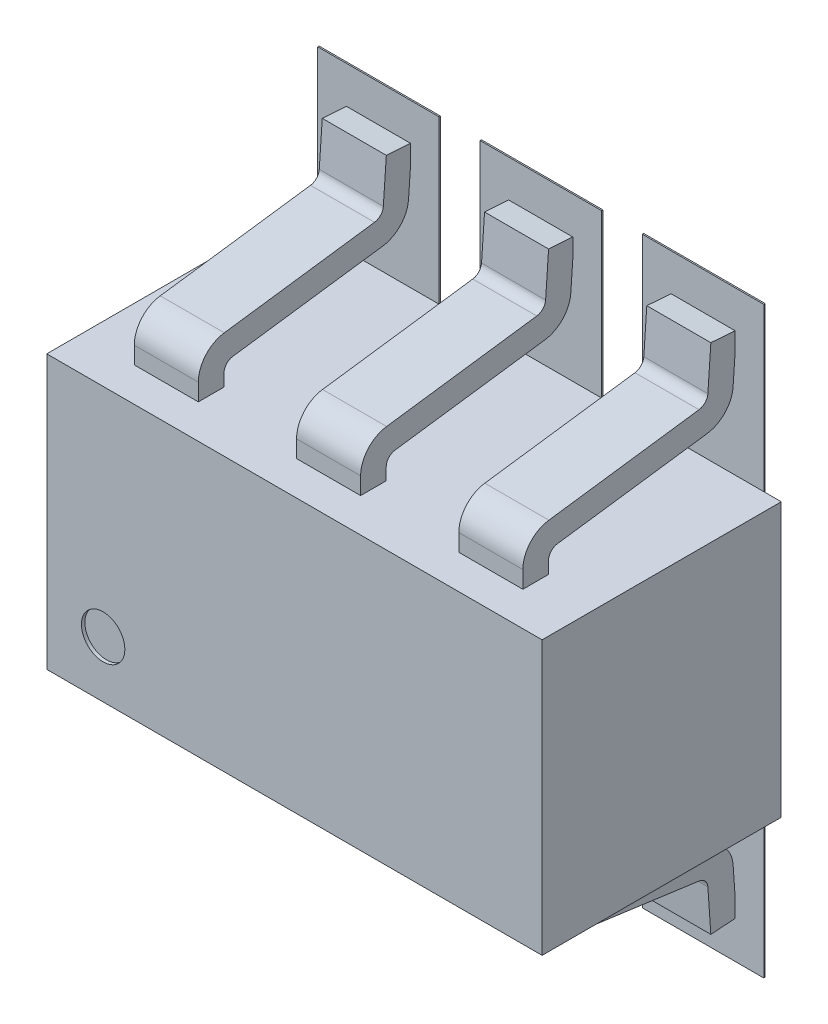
ISO-10303-21;
HEADER;
FILE_DESCRIPTION(('STEP AP214'),'2;1');
FILE_NAME('part.step','',(''),(''),'','','');
FILE_SCHEMA(('AUTOMOTIVE_DESIGN { 1 0 10303 214 1 1 1 1 }'));
ENDSEC;
DATA;
#1=APPLICATION_CONTEXT('core data for automotive mechanical design processes');
#2=APPLICATION_PROTOCOL_DEFINITION('international standard','automotive_design',2000,#1);
#3=PRODUCT_CONTEXT('',#1,'mechanical');
#4=PRODUCT('Part','Part','',(#3));
#5=PRODUCT_RELATED_PRODUCT_CATEGORY('part','',(#4));
#6=PRODUCT_DEFINITION_FORMATION('','',#4);
#7=PRODUCT_DEFINITION_CONTEXT('part definition',#1,'design');
#8=PRODUCT_DEFINITION('design','',#6,#7);
#9=PRODUCT_DEFINITION_SHAPE('','',#8);
#10=(LENGTH_UNIT() NAMED_UNIT(*) SI_UNIT(.MILLI.,.METRE.));
#11=(NAMED_UNIT(*) PLANE_ANGLE_UNIT() SI_UNIT($,.RADIAN.));
#12=(NAMED_UNIT(*) SI_UNIT($,.STERADIAN.) SOLID_ANGLE_UNIT());
#13=UNCERTAINTY_MEASURE_WITH_UNIT(LENGTH_MEASURE(1.E-05),#10,'distance_accuracy_value','');
#14=(GEOMETRIC_REPRESENTATION_CONTEXT(3) GLOBAL_UNCERTAINTY_ASSIGNED_CONTEXT((#13)) GLOBAL_UNIT_ASSIGNED_CONTEXT((#10,
#11,#12)) REPRESENTATION_CONTEXT('',''));
#15=CARTESIAN_POINT('',(0.,0.,0.));
#16=DIRECTION('',(0.,0.,1.));
#17=DIRECTION('',(1.,0.,0.));
#18=AXIS2_PLACEMENT_3D('',#15,#16,#17);
#19=CARTESIAN_POINT('',(0.,0.,0.0762));
#20=DIRECTION('',(0.,0.,1.));
#21=DIRECTION('',(1.,0.,0.));
#22=AXIS2_PLACEMENT_3D('',#19,#20,#21);
#23=PLANE('',#22);
#24=DIRECTION('',(1.,0.,0.));
#25=VECTOR('',#24,1.);
#26=CARTESIAN_POINT('',(0.3556,-0.691896,0.0762));
#27=LINE('',#26,#25);
#28=CARTESIAN_POINT('',(0.3556,-0.691896,0.0762));
#29=VERTEX_POINT('',#28);
#30=CARTESIAN_POINT('',(-0.3556,-0.691896,0.0762));
#31=VERTEX_POINT('',#30);
#32=EDGE_CURVE('E1315',#29,#31,#27,.F.);
#33=ORIENTED_EDGE('',*,*,#32,.F.);
#34=DIRECTION('',(0.,1.,0.));
#35=VECTOR('',#34,1.);
#36=CARTESIAN_POINT('',(0.3556,-1.707896,0.0762));
#37=LINE('',#36,#35);
#38=CARTESIAN_POINT('',(0.3556,-1.707896,0.0762));
#39=VERTEX_POINT('',#38);
#40=EDGE_CURVE('E1320',#39,#29,#37,.T.);
#41=ORIENTED_EDGE('',*,*,#40,.F.);
#42=DIRECTION('',(1.,0.,0.));
#43=VECTOR('',#42,1.);
#44=CARTESIAN_POINT('',(-0.3556,-1.707896,0.0762));
#45=LINE('',#44,#43);
#46=CARTESIAN_POINT('',(-0.3556,-1.707896,0.0762));
#47=VERTEX_POINT('',#46);
#48=EDGE_CURVE('E1302',#47,#39,#45,.T.);
#49=ORIENTED_EDGE('',*,*,#48,.F.);
#50=DIRECTION('',(0.,1.,0.));
#51=VECTOR('',#50,1.);
#52=CARTESIAN_POINT('',(-0.3556,-0.691896,0.0762));
#53=LINE('',#52,#51);
#54=EDGE_CURVE('E1310',#31,#47,#53,.F.);
#55=ORIENTED_EDGE('',*,*,#54,.F.);
#56=EDGE_LOOP('',(#33,#41,#49,#55));
#57=FACE_BOUND('',#56,.T.);
#58=ADVANCED_FACE('F16',(#57),#23,.F.);
#59=CARTESIAN_POINT('',(0.,0.,0.0762));
#60=DIRECTION('',(0.,0.,1.));
#61=DIRECTION('',(1.,0.,0.));
#62=AXIS2_PLACEMENT_3D('',#59,#60,#61);
#63=PLANE('',#62);
#64=DIRECTION('',(0.,1.,0.));
#65=VECTOR('',#64,1.);
#66=CARTESIAN_POINT('',(1.30556,-1.707896,0.0762));
#67=LINE('',#66,#65);
#68=CARTESIAN_POINT('',(1.30556,-1.707896,0.0762));
#69=VERTEX_POINT('',#68);
#70=CARTESIAN_POINT('',(1.30556,-0.691896,0.0762));
#71=VERTEX_POINT('',#70);
#72=EDGE_CURVE('E1295',#69,#71,#67,.T.);
#73=ORIENTED_EDGE('',*,*,#72,.F.);
#74=DIRECTION('',(1.,0.,0.));
#75=VECTOR('',#74,1.);
#76=CARTESIAN_POINT('',(0.59436,-1.707896,0.0762));
#77=LINE('',#76,#75);
#78=CARTESIAN_POINT('',(0.59436,-1.707896,0.0762));
#79=VERTEX_POINT('',#78);
#80=EDGE_CURVE('E1300',#79,#69,#77,.T.);
#81=ORIENTED_EDGE('',*,*,#80,.F.);
#82=DIRECTION('',(0.,1.,0.));
#83=VECTOR('',#82,1.);
#84=CARTESIAN_POINT('',(0.59436,-0.691896,0.0762));
#85=LINE('',#84,#83);
#86=CARTESIAN_POINT('',(0.59436,-0.691896,0.0762));
#87=VERTEX_POINT('',#86);
#88=EDGE_CURVE('E1282',#87,#79,#85,.F.);
#89=ORIENTED_EDGE('',*,*,#88,.F.);
#90=DIRECTION('',(1.,0.,0.));
#91=VECTOR('',#90,1.);
#92=CARTESIAN_POINT('',(1.30556,-0.691896,0.0762));
#93=LINE('',#92,#91);
#94=EDGE_CURVE('E1290',#71,#87,#93,.F.);
#95=ORIENTED_EDGE('',*,*,#94,.F.);
#96=EDGE_LOOP('',(#73,#81,#89,#95));
#97=FACE_BOUND('',#96,.T.);
#98=ADVANCED_FACE('F2173',(#97),#63,.F.);
#99=CARTESIAN_POINT('',(0.,0.,0.0762));
#100=DIRECTION('',(0.,0.,1.));
#101=DIRECTION('',(1.,0.,0.));
#102=AXIS2_PLACEMENT_3D('',#99,#100,#101);
#103=PLANE('',#102);
#104=DIRECTION('',(0.,1.,0.));
#105=VECTOR('',#104,1.);
#106=CARTESIAN_POINT('',(-0.59436,-1.707896,0.0762));
#107=LINE('',#106,#105);
#108=CARTESIAN_POINT('',(-0.59436,-1.707896,0.0762));
#109=VERTEX_POINT('',#108);
#110=CARTESIAN_POINT('',(-0.59436,-0.691896,0.0762));
#111=VERTEX_POINT('',#110);
#112=EDGE_CURVE('E1275',#109,#111,#107,.T.);
#113=ORIENTED_EDGE('',*,*,#112,.F.);
#114=DIRECTION('',(1.,0.,0.));
#115=VECTOR('',#114,1.);
#116=CARTESIAN_POINT('',(-1.30556,-1.707896,0.0762));
#117=LINE('',#116,#115);
#118=CARTESIAN_POINT('',(-1.30556,-1.707896,0.0762));
#119=VERTEX_POINT('',#118);
#120=EDGE_CURVE('E1280',#119,#109,#117,.T.);
#121=ORIENTED_EDGE('',*,*,#120,.F.);
#122=DIRECTION('',(0.,1.,0.));
#123=VECTOR('',#122,1.);
#124=CARTESIAN_POINT('',(-1.30556,-0.691896,0.0762));
#125=LINE('',#124,#123);
#126=CARTESIAN_POINT('',(-1.30556,-0.691896,0.0762));
#127=VERTEX_POINT('',#126);
#128=EDGE_CURVE('E1262',#127,#119,#125,.F.);
#129=ORIENTED_EDGE('',*,*,#128,.F.);
#130=DIRECTION('',(1.,0.,0.));
#131=VECTOR('',#130,1.);
#132=CARTESIAN_POINT('',(-0.59436,-0.691896,0.0762));
#133=LINE('',#132,#131);
#134=EDGE_CURVE('E1270',#111,#127,#133,.F.);
#135=ORIENTED_EDGE('',*,*,#134,.F.);
#136=EDGE_LOOP('',(#113,#121,#129,#135));
#137=FACE_BOUND('',#136,.T.);
#138=ADVANCED_FACE('F2170',(#137),#103,.F.);
#139=CARTESIAN_POINT('',(0.,0.,0.0762));
#140=DIRECTION('',(0.,0.,1.));
#141=DIRECTION('',(1.,0.,0.));
#142=AXIS2_PLACEMENT_3D('',#139,#140,#141);
#143=PLANE('',#142);
#144=DIRECTION('',(0.,1.,0.));
#145=VECTOR('',#144,1.);
#146=CARTESIAN_POINT('',(0.3556,0.691896,0.0762));
#147=LINE('',#146,#145);
#148=CARTESIAN_POINT('',(0.3556,0.691896,0.0762));
#149=VERTEX_POINT('',#148);
#150=CARTESIAN_POINT('',(0.3556,1.707896,0.0762));
#151=VERTEX_POINT('',#150);
#152=EDGE_CURVE('E1255',#149,#151,#147,.T.);
#153=ORIENTED_EDGE('',*,*,#152,.F.);
#154=DIRECTION('',(1.,0.,0.));
#155=VECTOR('',#154,1.);
#156=CARTESIAN_POINT('',(-0.3556,0.691896,0.0762));
#157=LINE('',#156,#155);
#158=CARTESIAN_POINT('',(-0.3556,0.691896,0.0762));
#159=VERTEX_POINT('',#158);
#160=EDGE_CURVE('E1260',#159,#149,#157,.T.);
#161=ORIENTED_EDGE('',*,*,#160,.F.);
#162=DIRECTION('',(0.,1.,0.));
#163=VECTOR('',#162,1.);
#164=CARTESIAN_POINT('',(-0.3556,1.707896,0.0762));
#165=LINE('',#164,#163);
#166=CARTESIAN_POINT('',(-0.3556,1.707896,0.0762));
#167=VERTEX_POINT('',#166);
#168=EDGE_CURVE('E1242',#167,#159,#165,.F.);
#169=ORIENTED_EDGE('',*,*,#168,.F.);
#170=DIRECTION('',(1.,0.,0.));
#171=VECTOR('',#170,1.);
#172=CARTESIAN_POINT('',(0.3556,1.707896,0.0762));
#173=LINE('',#172,#171);
#174=EDGE_CURVE('E1250',#151,#167,#173,.F.);
#175=ORIENTED_EDGE('',*,*,#174,.F.);
#176=EDGE_LOOP('',(#153,#161,#169,#175));
#177=FACE_BOUND('',#176,.T.);
#178=ADVANCED_FACE('F2166',(#177),#143,.F.);
#179=CARTESIAN_POINT('',(0.,0.,0.0762));
#180=DIRECTION('',(0.,0.,1.));
#181=DIRECTION('',(1.,0.,0.));
#182=AXIS2_PLACEMENT_3D('',#179,#180,#181);
#183=PLANE('',#182);
#184=DIRECTION('',(0.,1.,0.));
#185=VECTOR('',#184,1.);
#186=CARTESIAN_POINT('',(1.30556,0.691896,0.0762));
#187=LINE('',#186,#185);
#188=CARTESIAN_POINT('',(1.30556,0.691896,0.0762));
#189=VERTEX_POINT('',#188);
#190=CARTESIAN_POINT('',(1.30556,1.707896,0.0762));
#191=VERTEX_POINT('',#190);
#192=EDGE_CURVE('E1235',#189,#191,#187,.T.);
#193=ORIENTED_EDGE('',*,*,#192,.F.);
#194=DIRECTION('',(1.,0.,0.));
#195=VECTOR('',#194,1.);
#196=CARTESIAN_POINT('',(0.59436,0.691896,0.0762));
#197=LINE('',#196,#195);
#198=CARTESIAN_POINT('',(0.59436,0.691896,0.0762));
#199=VERTEX_POINT('',#198);
#200=EDGE_CURVE('E1240',#199,#189,#197,.T.);
#201=ORIENTED_EDGE('',*,*,#200,.F.);
#202=DIRECTION('',(0.,1.,0.));
#203=VECTOR('',#202,1.);
#204=CARTESIAN_POINT('',(0.59436,1.707896,0.0762));
#205=LINE('',#204,#203);
#206=CARTESIAN_POINT('',(0.59436,1.707896,0.0762));
#207=VERTEX_POINT('',#206);
#208=EDGE_CURVE('E1222',#207,#199,#205,.F.);
#209=ORIENTED_EDGE('',*,*,#208,.F.);
#210=DIRECTION('',(1.,0.,0.));
#211=VECTOR('',#210,1.);
#212=CARTESIAN_POINT('',(1.30556,1.707896,0.0762));
#213=LINE('',#212,#211);
#214=EDGE_CURVE('E1230',#191,#207,#213,.F.);
#215=ORIENTED_EDGE('',*,*,#214,.F.);
#216=EDGE_LOOP('',(#193,#201,#209,#215));
#217=FACE_BOUND('',#216,.T.);
#218=ADVANCED_FACE('F2162',(#217),#183,.F.);
#219=CARTESIAN_POINT('',(0.,0.,0.0762));
#220=DIRECTION('',(0.,0.,1.));
#221=DIRECTION('',(1.,0.,0.));
#222=AXIS2_PLACEMENT_3D('',#219,#220,#221);
#223=PLANE('',#222);
#224=DIRECTION('',(0.,1.,0.));
#225=VECTOR('',#224,1.);
#226=CARTESIAN_POINT('',(-0.59436,0.691896,0.0762));
#227=LINE('',#226,#225);
#228=CARTESIAN_POINT('',(-0.59436,0.691896,0.0762));
#229=VERTEX_POINT('',#228);
#230=CARTESIAN_POINT('',(-0.59436,1.707896,0.0762));
#231=VERTEX_POINT('',#230);
#232=EDGE_CURVE('E1215',#229,#231,#227,.T.);
#233=ORIENTED_EDGE('',*,*,#232,.F.);
#234=DIRECTION('',(1.,0.,0.));
#235=VECTOR('',#234,1.);
#236=CARTESIAN_POINT('',(-1.30556,0.691896,0.0762));
#237=LINE('',#236,#235);
#238=CARTESIAN_POINT('',(-1.30556,0.691896,0.0762));
#239=VERTEX_POINT('',#238);
#240=EDGE_CURVE('E1220',#239,#229,#237,.T.);
#241=ORIENTED_EDGE('',*,*,#240,.F.);
#242=DIRECTION('',(0.,1.,0.));
#243=VECTOR('',#242,1.);
#244=CARTESIAN_POINT('',(-1.30556,1.707896,0.0762));
#245=LINE('',#244,#243);
#246=CARTESIAN_POINT('',(-1.30556,1.707896,0.0762));
#247=VERTEX_POINT('',#246);
#248=EDGE_CURVE('E1183',#247,#239,#245,.F.);
#249=ORIENTED_EDGE('',*,*,#248,.F.);
#250=DIRECTION('',(1.,0.,0.));
#251=VECTOR('',#250,1.);
#252=CARTESIAN_POINT('',(-0.59436,1.707896,0.0762));
#253=LINE('',#252,#251);
#254=EDGE_CURVE('E1210',#231,#247,#253,.F.);
#255=ORIENTED_EDGE('',*,*,#254,.F.);
#256=EDGE_LOOP('',(#233,#241,#249,#255));
#257=FACE_BOUND('',#256,.T.);
#258=ADVANCED_FACE('F2158',(#257),#223,.F.);
#259=CARTESIAN_POINT('',(0.3556,-1.707896,0.0762));
#260=DIRECTION('',(1.,0.,0.));
#261=DIRECTION('',(0.,0.,-1.));
#262=AXIS2_PLACEMENT_3D('',#259,#260,#261);
#263=PLANE('',#262);
#264=DIRECTION('',(0.,0.,-1.));
#265=VECTOR('',#264,1.);
#266=CARTESIAN_POINT('',(0.3556,-1.707896,0.0762));
#267=LINE('',#266,#265);
#268=CARTESIAN_POINT('',(0.3556,-1.707896,0.0841999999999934));
#269=VERTEX_POINT('',#268);
#270=EDGE_CURVE('E1308',#39,#269,#267,.F.);
#271=ORIENTED_EDGE('',*,*,#270,.F.);
#272=ORIENTED_EDGE('',*,*,#40,.T.);
#273=DIRECTION('',(0.,0.,1.));
#274=VECTOR('',#273,1.);
#275=CARTESIAN_POINT('',(0.3556,-0.691896,0.0762));
#276=LINE('',#275,#274);
#277=CARTESIAN_POINT('',(0.3556,-0.691896,0.0841999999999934));
#278=VERTEX_POINT('',#277);
#279=EDGE_CURVE('E1317',#278,#29,#276,.F.);
#280=ORIENTED_EDGE('',*,*,#279,.F.);
#281=DIRECTION('',(0.,1.,0.));
#282=VECTOR('',#281,1.);
#283=CARTESIAN_POINT('',(0.3556,0.,0.0841999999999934));
#284=LINE('',#283,#282);
#285=EDGE_CURVE('E1181',#269,#278,#284,.T.);
#286=ORIENTED_EDGE('',*,*,#285,.F.);
#287=EDGE_LOOP('',(#271,#272,#280,#286));
#288=FACE_BOUND('',#287,.T.);
#289=ADVANCED_FACE('F2154',(#288),#263,.T.);
#290=CARTESIAN_POINT('',(0.3556,-0.691896,0.0762));
#291=DIRECTION('',(0.,1.,0.));
#292=DIRECTION('',(0.,0.,1.));
#293=AXIS2_PLACEMENT_3D('',#290,#291,#292);
#294=PLANE('',#293);
#295=ORIENTED_EDGE('',*,*,#279,.T.);
#296=ORIENTED_EDGE('',*,*,#32,.T.);
#297=DIRECTION('',(0.,0.,1.));
#298=VECTOR('',#297,1.);
#299=CARTESIAN_POINT('',(-0.3556,-0.691896,0.0762));
#300=LINE('',#299,#298);
#301=CARTESIAN_POINT('',(-0.3556,-0.691896,0.0841999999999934));
#302=VERTEX_POINT('',#301);
#303=EDGE_CURVE('E1312',#302,#31,#300,.F.);
#304=ORIENTED_EDGE('',*,*,#303,.F.);
#305=DIRECTION('',(1.,0.,0.));
#306=VECTOR('',#305,1.);
#307=CARTESIAN_POINT('',(0.,-0.691896,0.0841999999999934));
#308=LINE('',#307,#306);
#309=EDGE_CURVE('E1179',#278,#302,#308,.F.);
#310=ORIENTED_EDGE('',*,*,#309,.F.);
#311=EDGE_LOOP('',(#295,#296,#304,#310));
#312=FACE_BOUND('',#311,.T.);
#313=ADVANCED_FACE('F2150',(#312),#294,.T.);
#314=CARTESIAN_POINT('',(-0.3556,-0.691896,0.0762));
#315=DIRECTION('',(-1.,0.,0.));
#316=DIRECTION('',(0.,0.,1.));
#317=AXIS2_PLACEMENT_3D('',#314,#315,#316);
#318=PLANE('',#317);
#319=ORIENTED_EDGE('',*,*,#303,.T.);
#320=ORIENTED_EDGE('',*,*,#54,.T.);
#321=DIRECTION('',(0.,0.,-1.));
#322=VECTOR('',#321,1.);
#323=CARTESIAN_POINT('',(-0.3556,-1.707896,0.0762));
#324=LINE('',#323,#322);
#325=CARTESIAN_POINT('',(-0.3556,-1.707896,0.0841999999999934));
#326=VERTEX_POINT('',#325);
#327=EDGE_CURVE('E1305',#326,#47,#324,.T.);
#328=ORIENTED_EDGE('',*,*,#327,.F.);
#329=DIRECTION('',(0.,1.,0.));
#330=VECTOR('',#329,1.);
#331=CARTESIAN_POINT('',(-0.3556,0.,0.0841999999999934));
#332=LINE('',#331,#330);
#333=EDGE_CURVE('E1177',#302,#326,#332,.F.);
#334=ORIENTED_EDGE('',*,*,#333,.F.);
#335=EDGE_LOOP('',(#319,#320,#328,#334));
#336=FACE_BOUND('',#335,.T.);
#337=ADVANCED_FACE('F2146',(#336),#318,.T.);
#338=CARTESIAN_POINT('',(-0.3556,-1.707896,0.0762));
#339=DIRECTION('',(0.,-1.,0.));
#340=DIRECTION('',(0.,0.,-1.));
#341=AXIS2_PLACEMENT_3D('',#338,#339,#340);
#342=PLANE('',#341);
#343=ORIENTED_EDGE('',*,*,#327,.T.);
#344=ORIENTED_EDGE('',*,*,#48,.T.);
#345=ORIENTED_EDGE('',*,*,#270,.T.);
#346=DIRECTION('',(1.,0.,0.));
#347=VECTOR('',#346,1.);
#348=CARTESIAN_POINT('',(0.,-1.707896,0.0841999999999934));
#349=LINE('',#348,#347);
#350=EDGE_CURVE('E1167',#326,#269,#349,.T.);
#351=ORIENTED_EDGE('',*,*,#350,.F.);
#352=EDGE_LOOP('',(#343,#344,#345,#351));
#353=FACE_BOUND('',#352,.T.);
#354=ADVANCED_FACE('F2142',(#353),#342,.T.);
#355=CARTESIAN_POINT('',(0.59436,-1.707896,0.0762));
#356=DIRECTION('',(0.,-1.,0.));
#357=DIRECTION('',(0.,0.,-1.));
#358=AXIS2_PLACEMENT_3D('',#355,#356,#357);
#359=PLANE('',#358);
#360=DIRECTION('',(0.,0.,1.));
#361=VECTOR('',#360,1.);
#362=CARTESIAN_POINT('',(0.59436,-1.707896,0.0762));
#363=LINE('',#362,#361);
#364=CARTESIAN_POINT('',(0.59436,-1.707896,0.0841999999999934));
#365=VERTEX_POINT('',#364);
#366=EDGE_CURVE('E1288',#79,#365,#363,.T.);
#367=ORIENTED_EDGE('',*,*,#366,.F.);
#368=ORIENTED_EDGE('',*,*,#80,.T.);
#369=DIRECTION('',(0.,0.,-1.));
#370=VECTOR('',#369,1.);
#371=CARTESIAN_POINT('',(1.30556,-1.707896,0.0762));
#372=LINE('',#371,#370);
#373=CARTESIAN_POINT('',(1.30556,-1.707896,0.0841999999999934));
#374=VERTEX_POINT('',#373);
#375=EDGE_CURVE('E1297',#374,#69,#372,.T.);
#376=ORIENTED_EDGE('',*,*,#375,.F.);
#377=DIRECTION('',(1.,0.,0.));
#378=VECTOR('',#377,1.);
#379=CARTESIAN_POINT('',(0.,-1.707896,0.0841999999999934));
#380=LINE('',#379,#378);
#381=EDGE_CURVE('E1104',#365,#374,#380,.T.);
#382=ORIENTED_EDGE('',*,*,#381,.F.);
#383=EDGE_LOOP('',(#367,#368,#376,#382));
#384=FACE_BOUND('',#383,.T.);
#385=ADVANCED_FACE('F2138',(#384),#359,.T.);
#386=CARTESIAN_POINT('',(1.30556,-1.707896,0.0762));
#387=DIRECTION('',(1.,0.,0.));
#388=DIRECTION('',(0.,0.,-1.));
#389=AXIS2_PLACEMENT_3D('',#386,#387,#388);
#390=PLANE('',#389);
#391=ORIENTED_EDGE('',*,*,#375,.T.);
#392=ORIENTED_EDGE('',*,*,#72,.T.);
#393=DIRECTION('',(0.,0.,1.));
#394=VECTOR('',#393,1.);
#395=CARTESIAN_POINT('',(1.30556,-0.691896,0.0762));
#396=LINE('',#395,#394);
#397=CARTESIAN_POINT('',(1.30556,-0.691896,0.0841999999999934));
#398=VERTEX_POINT('',#397);
#399=EDGE_CURVE('E1292',#398,#71,#396,.F.);
#400=ORIENTED_EDGE('',*,*,#399,.F.);
#401=DIRECTION('',(0.,1.,0.));
#402=VECTOR('',#401,1.);
#403=CARTESIAN_POINT('',(1.30556,0.,0.0841999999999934));
#404=LINE('',#403,#402);
#405=EDGE_CURVE('E1102',#374,#398,#404,.T.);
#406=ORIENTED_EDGE('',*,*,#405,.F.);
#407=EDGE_LOOP('',(#391,#392,#400,#406));
#408=FACE_BOUND('',#407,.T.);
#409=ADVANCED_FACE('F2134',(#408),#390,.T.);
#410=CARTESIAN_POINT('',(1.30556,-0.691896,0.0762));
#411=DIRECTION('',(0.,1.,0.));
#412=DIRECTION('',(0.,0.,1.));
#413=AXIS2_PLACEMENT_3D('',#410,#411,#412);
#414=PLANE('',#413);
#415=ORIENTED_EDGE('',*,*,#399,.T.);
#416=ORIENTED_EDGE('',*,*,#94,.T.);
#417=DIRECTION('',(0.,0.,1.));
#418=VECTOR('',#417,1.);
#419=CARTESIAN_POINT('',(0.59436,-0.691896,0.0762));
#420=LINE('',#419,#418);
#421=CARTESIAN_POINT('',(0.59436,-0.691896,0.0841999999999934));
#422=VERTEX_POINT('',#421);
#423=EDGE_CURVE('E1285',#422,#87,#420,.F.);
#424=ORIENTED_EDGE('',*,*,#423,.F.);
#425=DIRECTION('',(1.,0.,0.));
#426=VECTOR('',#425,1.);
#427=CARTESIAN_POINT('',(0.,-0.691896,0.0841999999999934));
#428=LINE('',#427,#426);
#429=EDGE_CURVE('E1100',#398,#422,#428,.F.);
#430=ORIENTED_EDGE('',*,*,#429,.F.);
#431=EDGE_LOOP('',(#415,#416,#424,#430));
#432=FACE_BOUND('',#431,.T.);
#433=ADVANCED_FACE('F2130',(#432),#414,.T.);
#434=CARTESIAN_POINT('',(0.59436,-0.691896,0.0762));
#435=DIRECTION('',(-1.,0.,0.));
#436=DIRECTION('',(0.,0.,1.));
#437=AXIS2_PLACEMENT_3D('',#434,#435,#436);
#438=PLANE('',#437);
#439=ORIENTED_EDGE('',*,*,#423,.T.);
#440=ORIENTED_EDGE('',*,*,#88,.T.);
#441=ORIENTED_EDGE('',*,*,#366,.T.);
#442=DIRECTION('',(0.,1.,0.));
#443=VECTOR('',#442,1.);
#444=CARTESIAN_POINT('',(0.59436,0.,0.0841999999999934));
#445=LINE('',#444,#443);
#446=EDGE_CURVE('E1090',#422,#365,#445,.F.);
#447=ORIENTED_EDGE('',*,*,#446,.F.);
#448=EDGE_LOOP('',(#439,#440,#441,#447));
#449=FACE_BOUND('',#448,.T.);
#450=ADVANCED_FACE('F2126',(#449),#438,.T.);
#451=CARTESIAN_POINT('',(-1.30556,-1.707896,0.0762));
#452=DIRECTION('',(0.,-1.,0.));
#453=DIRECTION('',(0.,0.,-1.));
#454=AXIS2_PLACEMENT_3D('',#451,#452,#453);
#455=PLANE('',#454);
#456=DIRECTION('',(0.,0.,1.));
#457=VECTOR('',#456,1.);
#458=CARTESIAN_POINT('',(-1.30556,-1.707896,0.0762));
#459=LINE('',#458,#457);
#460=CARTESIAN_POINT('',(-1.30556,-1.707896,0.0841999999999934));
#461=VERTEX_POINT('',#460);
#462=EDGE_CURVE('E1268',#119,#461,#459,.T.);
#463=ORIENTED_EDGE('',*,*,#462,.F.);
#464=ORIENTED_EDGE('',*,*,#120,.T.);
#465=DIRECTION('',(0.,0.,-1.));
#466=VECTOR('',#465,1.);
#467=CARTESIAN_POINT('',(-0.59436,-1.707896,0.0762));
#468=LINE('',#467,#466);
#469=CARTESIAN_POINT('',(-0.59436,-1.707896,0.0841999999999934));
#470=VERTEX_POINT('',#469);
#471=EDGE_CURVE('E1277',#470,#109,#468,.T.);
#472=ORIENTED_EDGE('',*,*,#471,.F.);
#473=DIRECTION('',(1.,0.,0.));
#474=VECTOR('',#473,1.);
#475=CARTESIAN_POINT('',(0.,-1.707896,0.0841999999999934));
#476=LINE('',#475,#474);
#477=EDGE_CURVE('E1019',#461,#470,#476,.T.);
#478=ORIENTED_EDGE('',*,*,#477,.F.);
#479=EDGE_LOOP('',(#463,#464,#472,#478));
#480=FACE_BOUND('',#479,.T.);
#481=ADVANCED_FACE('F2122',(#480),#455,.T.);
#482=CARTESIAN_POINT('',(-0.59436,-1.707896,0.0762));
#483=DIRECTION('',(1.,0.,0.));
#484=DIRECTION('',(0.,0.,-1.));
#485=AXIS2_PLACEMENT_3D('',#482,#483,#484);
#486=PLANE('',#485);
#487=ORIENTED_EDGE('',*,*,#471,.T.);
#488=ORIENTED_EDGE('',*,*,#112,.T.);
#489=DIRECTION('',(0.,0.,1.));
#490=VECTOR('',#489,1.);
#491=CARTESIAN_POINT('',(-0.59436,-0.691896,0.0762));
#492=LINE('',#491,#490);
#493=CARTESIAN_POINT('',(-0.59436,-0.691896,0.0841999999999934));
#494=VERTEX_POINT('',#493);
#495=EDGE_CURVE('E1272',#494,#111,#492,.F.);
#496=ORIENTED_EDGE('',*,*,#495,.F.);
#497=DIRECTION('',(0.,1.,0.));
#498=VECTOR('',#497,1.);
#499=CARTESIAN_POINT('',(-0.59436,0.,0.0841999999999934));
#500=LINE('',#499,#498);
#501=EDGE_CURVE('E1017',#470,#494,#500,.T.);
#502=ORIENTED_EDGE('',*,*,#501,.F.);
#503=EDGE_LOOP('',(#487,#488,#496,#502));
#504=FACE_BOUND('',#503,.T.);
#505=ADVANCED_FACE('F2118',(#504),#486,.T.);
#506=CARTESIAN_POINT('',(-0.59436,-0.691896,0.0762));
#507=DIRECTION('',(0.,1.,0.));
#508=DIRECTION('',(0.,0.,1.));
#509=AXIS2_PLACEMENT_3D('',#506,#507,#508);
#510=PLANE('',#509);
#511=ORIENTED_EDGE('',*,*,#495,.T.);
#512=ORIENTED_EDGE('',*,*,#134,.T.);
#513=DIRECTION('',(0.,0.,1.));
#514=VECTOR('',#513,1.);
#515=CARTESIAN_POINT('',(-1.30556,-0.691896,0.0762));
#516=LINE('',#515,#514);
#517=CARTESIAN_POINT('',(-1.30556,-0.691896,0.0841999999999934));
#518=VERTEX_POINT('',#517);
#519=EDGE_CURVE('E1265',#518,#127,#516,.F.);
#520=ORIENTED_EDGE('',*,*,#519,.F.);
#521=DIRECTION('',(1.,0.,0.));
#522=VECTOR('',#521,1.);
#523=CARTESIAN_POINT('',(0.,-0.691896,0.0841999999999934));
#524=LINE('',#523,#522);
#525=EDGE_CURVE('E1015',#494,#518,#524,.F.);
#526=ORIENTED_EDGE('',*,*,#525,.F.);
#527=EDGE_LOOP('',(#511,#512,#520,#526));
#528=FACE_BOUND('',#527,.T.);
#529=ADVANCED_FACE('F2114',(#528),#510,.T.);
#530=CARTESIAN_POINT('',(-1.30556,-0.691896,0.0762));
#531=DIRECTION('',(-1.,0.,0.));
#532=DIRECTION('',(0.,0.,1.));
#533=AXIS2_PLACEMENT_3D('',#530,#531,#532);
#534=PLANE('',#533);
#535=ORIENTED_EDGE('',*,*,#519,.T.);
#536=ORIENTED_EDGE('',*,*,#128,.T.);
#537=ORIENTED_EDGE('',*,*,#462,.T.);
#538=DIRECTION('',(0.,1.,0.));
#539=VECTOR('',#538,1.);
#540=CARTESIAN_POINT('',(-1.30556,0.,0.0841999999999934));
#541=LINE('',#540,#539);
#542=EDGE_CURVE('E1005',#518,#461,#541,.F.);
#543=ORIENTED_EDGE('',*,*,#542,.F.);
#544=EDGE_LOOP('',(#535,#536,#537,#543));
#545=FACE_BOUND('',#544,.T.);
#546=ADVANCED_FACE('F2110',(#545),#534,.T.);
#547=CARTESIAN_POINT('',(0.,0.,1.50628600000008));
#548=DIRECTION('',(0.,0.,1.));
#549=DIRECTION('',(1.,0.,0.));
#550=AXIS2_PLACEMENT_3D('',#547,#548,#549);
#551=PLANE('',#550);
#552=CARTESIAN_POINT('',(-1.11980000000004,-0.469800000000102,1.50628600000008));
#553=DIRECTION('',(0.,0.,1.));
#554=DIRECTION('',(1.,0.,0.));
#555=AXIS2_PLACEMENT_3D('',#552,#553,#554);
#556=CIRCLE('',#555,0.127);
#557=CARTESIAN_POINT('',(-0.992800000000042,-0.469800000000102,1.50628600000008));
#558=VERTEX_POINT('',#557);
#559=EDGE_CURVE('E19',#558,#558,#556,.T.);
#560=ORIENTED_EDGE('',*,*,#559,.T.);
#561=EDGE_LOOP('',(#560));
#562=FACE_BOUND('',#561,.T.);
#563=ADVANCED_FACE('F2106',(#562),#551,.T.);
#564=CARTESIAN_POINT('',(-0.3556,0.691896,0.0762));
#565=DIRECTION('',(0.,-1.,0.));
#566=DIRECTION('',(0.,0.,-1.));
#567=AXIS2_PLACEMENT_3D('',#564,#565,#566);
#568=PLANE('',#567);
#569=DIRECTION('',(0.,0.,1.));
#570=VECTOR('',#569,1.);
#571=CARTESIAN_POINT('',(-0.3556,0.691896,0.0762));
#572=LINE('',#571,#570);
#573=CARTESIAN_POINT('',(-0.3556,0.691896,0.0841999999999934));
#574=VERTEX_POINT('',#573);
#575=EDGE_CURVE('E1248',#159,#574,#572,.T.);
#576=ORIENTED_EDGE('',*,*,#575,.F.);
#577=ORIENTED_EDGE('',*,*,#160,.T.);
#578=DIRECTION('',(0.,0.,-1.));
#579=VECTOR('',#578,1.);
#580=CARTESIAN_POINT('',(0.3556,0.691896,0.0762));
#581=LINE('',#580,#579);
#582=CARTESIAN_POINT('',(0.3556,0.691896,0.0841999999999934));
#583=VERTEX_POINT('',#582);
#584=EDGE_CURVE('E1257',#583,#149,#581,.T.);
#585=ORIENTED_EDGE('',*,*,#584,.F.);
#586=DIRECTION('',(1.,0.,0.));
#587=VECTOR('',#586,1.);
#588=CARTESIAN_POINT('',(0.,0.691896,0.0841999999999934));
#589=LINE('',#588,#587);
#590=EDGE_CURVE('E934',#574,#583,#589,.T.);
#591=ORIENTED_EDGE('',*,*,#590,.F.);
#592=EDGE_LOOP('',(#576,#577,#585,#591));
#593=FACE_BOUND('',#592,.T.);
#594=ADVANCED_FACE('F2102',(#593),#568,.T.);
#595=CARTESIAN_POINT('',(0.3556,0.691896,0.0762));
#596=DIRECTION('',(1.,0.,0.));
#597=DIRECTION('',(0.,0.,-1.));
#598=AXIS2_PLACEMENT_3D('',#595,#596,#597);
#599=PLANE('',#598);
#600=ORIENTED_EDGE('',*,*,#584,.T.);
#601=ORIENTED_EDGE('',*,*,#152,.T.);
#602=DIRECTION('',(0.,0.,1.));
#603=VECTOR('',#602,1.);
#604=CARTESIAN_POINT('',(0.3556,1.707896,0.0762));
#605=LINE('',#604,#603);
#606=CARTESIAN_POINT('',(0.3556,1.707896,0.0841999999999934));
#607=VERTEX_POINT('',#606);
#608=EDGE_CURVE('E1252',#607,#151,#605,.F.);
#609=ORIENTED_EDGE('',*,*,#608,.F.);
#610=DIRECTION('',(0.,1.,0.));
#611=VECTOR('',#610,1.);
#612=CARTESIAN_POINT('',(0.3556,0.,0.0841999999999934));
#613=LINE('',#612,#611);
#614=EDGE_CURVE('E932',#583,#607,#613,.T.);
#615=ORIENTED_EDGE('',*,*,#614,.F.);
#616=EDGE_LOOP('',(#600,#601,#609,#615));
#617=FACE_BOUND('',#616,.T.);
#618=ADVANCED_FACE('F2098',(#617),#599,.T.);
#619=CARTESIAN_POINT('',(0.3556,1.707896,0.0762));
#620=DIRECTION('',(0.,1.,0.));
#621=DIRECTION('',(0.,0.,1.));
#622=AXIS2_PLACEMENT_3D('',#619,#620,#621);
#623=PLANE('',#622);
#624=ORIENTED_EDGE('',*,*,#608,.T.);
#625=ORIENTED_EDGE('',*,*,#174,.T.);
#626=DIRECTION('',(0.,0.,1.));
#627=VECTOR('',#626,1.);
#628=CARTESIAN_POINT('',(-0.3556,1.707896,0.0762));
#629=LINE('',#628,#627);
#630=CARTESIAN_POINT('',(-0.3556,1.707896,0.0841999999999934));
#631=VERTEX_POINT('',#630);
#632=EDGE_CURVE('E1245',#631,#167,#629,.F.);
#633=ORIENTED_EDGE('',*,*,#632,.F.);
#634=DIRECTION('',(1.,0.,0.));
#635=VECTOR('',#634,1.);
#636=CARTESIAN_POINT('',(0.,1.707896,0.0841999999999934));
#637=LINE('',#636,#635);
#638=EDGE_CURVE('E930',#607,#631,#637,.F.);
#639=ORIENTED_EDGE('',*,*,#638,.F.);
#640=EDGE_LOOP('',(#624,#625,#633,#639));
#641=FACE_BOUND('',#640,.T.);
#642=ADVANCED_FACE('F2094',(#641),#623,.T.);
#643=CARTESIAN_POINT('',(-0.3556,1.707896,0.0762));
#644=DIRECTION('',(-1.,0.,0.));
#645=DIRECTION('',(0.,0.,1.));
#646=AXIS2_PLACEMENT_3D('',#643,#644,#645);
#647=PLANE('',#646);
#648=ORIENTED_EDGE('',*,*,#632,.T.);
#649=ORIENTED_EDGE('',*,*,#168,.T.);
#650=ORIENTED_EDGE('',*,*,#575,.T.);
#651=DIRECTION('',(0.,1.,0.));
#652=VECTOR('',#651,1.);
#653=CARTESIAN_POINT('',(-0.3556,0.,0.0841999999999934));
#654=LINE('',#653,#652);
#655=EDGE_CURVE('E925',#631,#574,#654,.F.);
#656=ORIENTED_EDGE('',*,*,#655,.F.);
#657=EDGE_LOOP('',(#648,#649,#650,#656));
#658=FACE_BOUND('',#657,.T.);
#659=ADVANCED_FACE('F2090',(#658),#647,.T.);
#660=CARTESIAN_POINT('',(0.59436,0.691896,0.0762));
#661=DIRECTION('',(0.,-1.,0.));
#662=DIRECTION('',(0.,0.,-1.));
#663=AXIS2_PLACEMENT_3D('',#660,#661,#662);
#664=PLANE('',#663);
#665=DIRECTION('',(0.,0.,1.));
#666=VECTOR('',#665,1.);
#667=CARTESIAN_POINT('',(0.59436,0.691896,0.0762));
#668=LINE('',#667,#666);
#669=CARTESIAN_POINT('',(0.59436,0.691896,0.0841999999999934));
#670=VERTEX_POINT('',#669);
#671=EDGE_CURVE('E1228',#199,#670,#668,.T.);
#672=ORIENTED_EDGE('',*,*,#671,.F.);
#673=ORIENTED_EDGE('',*,*,#200,.T.);
#674=DIRECTION('',(0.,0.,-1.));
#675=VECTOR('',#674,1.);
#676=CARTESIAN_POINT('',(1.30556,0.691896,0.0762));
#677=LINE('',#676,#675);
#678=CARTESIAN_POINT('',(1.30556,0.691896,0.0841999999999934));
#679=VERTEX_POINT('',#678);
#680=EDGE_CURVE('E1237',#679,#189,#677,.T.);
#681=ORIENTED_EDGE('',*,*,#680,.F.);
#682=DIRECTION('',(1.,0.,0.));
#683=VECTOR('',#682,1.);
#684=CARTESIAN_POINT('',(0.,0.691896,0.0841999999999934));
#685=LINE('',#684,#683);
#686=EDGE_CURVE('E851',#670,#679,#685,.T.);
#687=ORIENTED_EDGE('',*,*,#686,.F.);
#688=EDGE_LOOP('',(#672,#673,#681,#687));
#689=FACE_BOUND('',#688,.T.);
#690=ADVANCED_FACE('F2086',(#689),#664,.T.);
#691=CARTESIAN_POINT('',(1.30556,0.691896,0.0762));
#692=DIRECTION('',(1.,0.,0.));
#693=DIRECTION('',(0.,0.,-1.));
#694=AXIS2_PLACEMENT_3D('',#691,#692,#693);
#695=PLANE('',#694);
#696=ORIENTED_EDGE('',*,*,#680,.T.);
#697=ORIENTED_EDGE('',*,*,#192,.T.);
#698=DIRECTION('',(0.,0.,1.));
#699=VECTOR('',#698,1.);
#700=CARTESIAN_POINT('',(1.30556,1.707896,0.0762));
#701=LINE('',#700,#699);
#702=CARTESIAN_POINT('',(1.30556,1.707896,0.0841999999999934));
#703=VERTEX_POINT('',#702);
#704=EDGE_CURVE('E1232',#703,#191,#701,.F.);
#705=ORIENTED_EDGE('',*,*,#704,.F.);
#706=DIRECTION('',(0.,1.,0.));
#707=VECTOR('',#706,1.);
#708=CARTESIAN_POINT('',(1.30556,0.,0.0841999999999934));
#709=LINE('',#708,#707);
#710=EDGE_CURVE('E849',#679,#703,#709,.T.);
#711=ORIENTED_EDGE('',*,*,#710,.F.);
#712=EDGE_LOOP('',(#696,#697,#705,#711));
#713=FACE_BOUND('',#712,.T.);
#714=ADVANCED_FACE('F2082',(#713),#695,.T.);
#715=CARTESIAN_POINT('',(1.30556,1.707896,0.0762));
#716=DIRECTION('',(0.,1.,0.));
#717=DIRECTION('',(0.,0.,1.));
#718=AXIS2_PLACEMENT_3D('',#715,#716,#717);
#719=PLANE('',#718);
#720=ORIENTED_EDGE('',*,*,#704,.T.);
#721=ORIENTED_EDGE('',*,*,#214,.T.);
#722=DIRECTION('',(0.,0.,1.));
#723=VECTOR('',#722,1.);
#724=CARTESIAN_POINT('',(0.59436,1.707896,0.0762));
#725=LINE('',#724,#723);
#726=CARTESIAN_POINT('',(0.59436,1.707896,0.0841999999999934));
#727=VERTEX_POINT('',#726);
#728=EDGE_CURVE('E1225',#727,#207,#725,.F.);
#729=ORIENTED_EDGE('',*,*,#728,.F.);
#730=DIRECTION('',(1.,0.,0.));
#731=VECTOR('',#730,1.);
#732=CARTESIAN_POINT('',(0.,1.707896,0.0841999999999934));
#733=LINE('',#732,#731);
#734=EDGE_CURVE('E847',#703,#727,#733,.F.);
#735=ORIENTED_EDGE('',*,*,#734,.F.);
#736=EDGE_LOOP('',(#720,#721,#729,#735));
#737=FACE_BOUND('',#736,.T.);
#738=ADVANCED_FACE('F2078',(#737),#719,.T.);
#739=CARTESIAN_POINT('',(0.59436,1.707896,0.0762));
#740=DIRECTION('',(-1.,0.,0.));
#741=DIRECTION('',(0.,0.,1.));
#742=AXIS2_PLACEMENT_3D('',#739,#740,#741);
#743=PLANE('',#742);
#744=ORIENTED_EDGE('',*,*,#728,.T.);
#745=ORIENTED_EDGE('',*,*,#208,.T.);
#746=ORIENTED_EDGE('',*,*,#671,.T.);
#747=DIRECTION('',(0.,1.,0.));
#748=VECTOR('',#747,1.);
#749=CARTESIAN_POINT('',(0.59436,0.,0.0841999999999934));
#750=LINE('',#749,#748);
#751=EDGE_CURVE('E842',#727,#670,#750,.F.);
#752=ORIENTED_EDGE('',*,*,#751,.F.);
#753=EDGE_LOOP('',(#744,#745,#746,#752));
#754=FACE_BOUND('',#753,.T.);
#755=ADVANCED_FACE('F2074',(#754),#743,.T.);
#756=CARTESIAN_POINT('',(-1.30556,0.691896,0.0762));
#757=DIRECTION('',(0.,-1.,0.));
#758=DIRECTION('',(0.,0.,-1.));
#759=AXIS2_PLACEMENT_3D('',#756,#757,#758);
#760=PLANE('',#759);
#761=DIRECTION('',(0.,0.,1.));
#762=VECTOR('',#761,1.);
#763=CARTESIAN_POINT('',(-1.30556,0.691896,0.0762));
#764=LINE('',#763,#762);
#765=CARTESIAN_POINT('',(-1.30556,0.691896,0.0841999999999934));
#766=VERTEX_POINT('',#765);
#767=EDGE_CURVE('E1208',#239,#766,#764,.T.);
#768=ORIENTED_EDGE('',*,*,#767,.F.);
#769=ORIENTED_EDGE('',*,*,#240,.T.);
#770=DIRECTION('',(0.,0.,-1.));
#771=VECTOR('',#770,1.);
#772=CARTESIAN_POINT('',(-0.59436,0.691896,0.0762));
#773=LINE('',#772,#771);
#774=CARTESIAN_POINT('',(-0.59436,0.691896,0.0841999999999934));
#775=VERTEX_POINT('',#774);
#776=EDGE_CURVE('E1217',#775,#229,#773,.T.);
#777=ORIENTED_EDGE('',*,*,#776,.F.);
#778=DIRECTION('',(1.,0.,0.));
#779=VECTOR('',#778,1.);
#780=CARTESIAN_POINT('',(0.,0.691896,0.0841999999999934));
#781=LINE('',#780,#779);
#782=EDGE_CURVE('E768',#766,#775,#781,.T.);
#783=ORIENTED_EDGE('',*,*,#782,.F.);
#784=EDGE_LOOP('',(#768,#769,#777,#783));
#785=FACE_BOUND('',#784,.T.);
#786=ADVANCED_FACE('F2070',(#785),#760,.T.);
#787=CARTESIAN_POINT('',(-0.59436,0.691896,0.0762));
#788=DIRECTION('',(1.,0.,0.));
#789=DIRECTION('',(0.,0.,-1.));
#790=AXIS2_PLACEMENT_3D('',#787,#788,#789);
#791=PLANE('',#790);
#792=ORIENTED_EDGE('',*,*,#776,.T.);
#793=ORIENTED_EDGE('',*,*,#232,.T.);
#794=DIRECTION('',(0.,0.,1.));
#795=VECTOR('',#794,1.);
#796=CARTESIAN_POINT('',(-0.59436,1.707896,0.0762));
#797=LINE('',#796,#795);
#798=CARTESIAN_POINT('',(-0.59436,1.707896,0.0841999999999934));
#799=VERTEX_POINT('',#798);
#800=EDGE_CURVE('E1212',#799,#231,#797,.F.);
#801=ORIENTED_EDGE('',*,*,#800,.F.);
#802=DIRECTION('',(0.,1.,0.));
#803=VECTOR('',#802,1.);
#804=CARTESIAN_POINT('',(-0.59436,0.,0.0841999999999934));
#805=LINE('',#804,#803);
#806=EDGE_CURVE('E766',#775,#799,#805,.T.);
#807=ORIENTED_EDGE('',*,*,#806,.F.);
#808=EDGE_LOOP('',(#792,#793,#801,#807));
#809=FACE_BOUND('',#808,.T.);
#810=ADVANCED_FACE('F2066',(#809),#791,.T.);
#811=CARTESIAN_POINT('',(-0.59436,1.707896,0.0762));
#812=DIRECTION('',(0.,1.,0.));
#813=DIRECTION('',(0.,0.,1.));
#814=AXIS2_PLACEMENT_3D('',#811,#812,#813);
#815=PLANE('',#814);
#816=ORIENTED_EDGE('',*,*,#800,.T.);
#817=ORIENTED_EDGE('',*,*,#254,.T.);
#818=DIRECTION('',(0.,0.,1.));
#819=VECTOR('',#818,1.);
#820=CARTESIAN_POINT('',(-1.30556,1.707896,0.0762));
#821=LINE('',#820,#819);
#822=CARTESIAN_POINT('',(-1.30556,1.707896,0.0841999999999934));
#823=VERTEX_POINT('',#822);
#824=EDGE_CURVE('E1205',#823,#247,#821,.F.);
#825=ORIENTED_EDGE('',*,*,#824,.F.);
#826=DIRECTION('',(1.,0.,0.));
#827=VECTOR('',#826,1.);
#828=CARTESIAN_POINT('',(0.,1.707896,0.0841999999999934));
#829=LINE('',#828,#827);
#830=EDGE_CURVE('E764',#799,#823,#829,.F.);
#831=ORIENTED_EDGE('',*,*,#830,.F.);
#832=EDGE_LOOP('',(#816,#817,#825,#831));
#833=FACE_BOUND('',#832,.T.);
#834=ADVANCED_FACE('F2062',(#833),#815,.T.);
#835=CARTESIAN_POINT('',(-1.30556,1.707896,0.0762));
#836=DIRECTION('',(-1.,0.,0.));
#837=DIRECTION('',(0.,0.,1.));
#838=AXIS2_PLACEMENT_3D('',#835,#836,#837);
#839=PLANE('',#838);
#840=ORIENTED_EDGE('',*,*,#824,.T.);
#841=ORIENTED_EDGE('',*,*,#248,.T.);
#842=ORIENTED_EDGE('',*,*,#767,.T.);
#843=DIRECTION('',(0.,1.,0.));
#844=VECTOR('',#843,1.);
#845=CARTESIAN_POINT('',(-1.30556,0.,0.0841999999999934));
#846=LINE('',#845,#844);
#847=EDGE_CURVE('E759',#823,#766,#846,.F.);
#848=ORIENTED_EDGE('',*,*,#847,.F.);
#849=EDGE_LOOP('',(#840,#841,#842,#848));
#850=FACE_BOUND('',#849,.T.);
#851=ADVANCED_FACE('F2058',(#850),#839,.T.);
#852=CARTESIAN_POINT('',(0.,0.,0.0841999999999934));
#853=DIRECTION('',(0.,0.,1.));
#854=DIRECTION('',(1.,0.,0.));
#855=AXIS2_PLACEMENT_3D('',#852,#853,#854);
#856=PLANE('',#855);
#857=DIRECTION('',(1.,0.,0.));
#858=VECTOR('',#857,1.);
#859=CARTESIAN_POINT('',(-0.187500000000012,-1.49009594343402,0.0841999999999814));
#860=LINE('',#859,#858);
#861=CARTESIAN_POINT('',(-0.187500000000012,-1.49009594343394,0.0841999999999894));
#862=VERTEX_POINT('',#861);
#863=CARTESIAN_POINT('',(0.187500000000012,-1.49009594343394,0.0841999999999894));
#864=VERTEX_POINT('',#863);
#865=EDGE_CURVE('E1106',#862,#864,#860,.T.);
#866=ORIENTED_EDGE('',*,*,#865,.F.);
#867=DIRECTION('',(0.,1.,0.));
#868=VECTOR('',#867,1.);
#869=CARTESIAN_POINT('',(-0.187500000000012,0.,0.0841999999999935));
#870=LINE('',#869,#868);
#871=CARTESIAN_POINT('',(-0.187500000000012,-1.37513119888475,0.0841999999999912));
#872=VERTEX_POINT('',#871);
#873=EDGE_CURVE('E1158',#862,#872,#870,.T.);
#874=ORIENTED_EDGE('',*,*,#873,.T.);
#875=DIRECTION('',(1.,0.,0.));
#876=VECTOR('',#875,1.);
#877=CARTESIAN_POINT('',(-0.187500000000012,-1.37513119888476,0.0841999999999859));
#878=LINE('',#877,#876);
#879=CARTESIAN_POINT('',(0.187500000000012,-1.37513119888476,0.084199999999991));
#880=VERTEX_POINT('',#879);
#881=EDGE_CURVE('E1165',#880,#872,#878,.F.);
#882=ORIENTED_EDGE('',*,*,#881,.F.);
#883=DIRECTION('',(0.,1.,0.));
#884=VECTOR('',#883,1.);
#885=CARTESIAN_POINT('',(0.187500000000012,0.,0.0841999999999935));
#886=LINE('',#885,#884);
#887=EDGE_CURVE('E1189',#864,#880,#886,.T.);
#888=ORIENTED_EDGE('',*,*,#887,.F.);
#889=EDGE_LOOP('',(#866,#874,#882,#888));
#890=FACE_BOUND('',#889,.T.);
#891=ORIENTED_EDGE('',*,*,#333,.T.);
#892=ORIENTED_EDGE('',*,*,#350,.T.);
#893=ORIENTED_EDGE('',*,*,#285,.T.);
#894=ORIENTED_EDGE('',*,*,#309,.T.);
#895=EDGE_LOOP('',(#891,#892,#893,#894));
#896=FACE_BOUND('',#895,.T.);
#897=ADVANCED_FACE('F2054',(#890,#896),#856,.T.);
#898=CARTESIAN_POINT('',(-0.187500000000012,-1.48953652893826,0.0762));
#899=DIRECTION('',(0.,0.0697564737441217,-0.997564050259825));
#900=DIRECTION('',(0.,0.997564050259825,0.0697564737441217));
#901=AXIS2_PLACEMENT_3D('',#898,#899,#900);
#902=PLANE('',#901);
#903=DIRECTION('',(0.,0.997564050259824,0.0697564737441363));
#904=VECTOR('',#903,1.);
#905=CARTESIAN_POINT('',(0.187500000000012,-1.37513119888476,0.0841999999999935));
#906=LINE('',#905,#904);
#907=CARTESIAN_POINT('',(0.187500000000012,-1.21209292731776,0.0956007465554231));
#908=VERTEX_POINT('',#907);
#909=EDGE_CURVE('E666',#880,#908,#906,.T.);
#910=ORIENTED_EDGE('',*,*,#909,.F.);
#911=ORIENTED_EDGE('',*,*,#881,.T.);
#912=DIRECTION('',(0.,0.997564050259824,0.0697564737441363));
#913=VECTOR('',#912,1.);
#914=CARTESIAN_POINT('',(-0.187500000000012,-1.37513119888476,0.0841999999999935));
#915=LINE('',#914,#913);
#916=CARTESIAN_POINT('',(-0.187500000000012,-1.21209292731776,0.0956007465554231));
#917=VERTEX_POINT('',#916);
#918=EDGE_CURVE('E1172',#872,#917,#915,.T.);
#919=ORIENTED_EDGE('',*,*,#918,.T.);
#920=DIRECTION('',(1.,0.,0.));
#921=VECTOR('',#920,1.);
#922=CARTESIAN_POINT('',(-0.187500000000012,-1.2120929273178,0.0956007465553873));
#923=LINE('',#922,#921);
#924=EDGE_CURVE('E686',#908,#917,#923,.F.);
#925=ORIENTED_EDGE('',*,*,#924,.F.);
#926=EDGE_LOOP('',(#910,#911,#919,#925));
#927=FACE_BOUND('',#926,.T.);
#928=ADVANCED_FACE('F2051',(#927),#902,.T.);
#929=CARTESIAN_POINT('',(-0.187500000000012,-1.22437006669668,0.27117201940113));
#930=DIRECTION('',(1.,0.,0.));
#931=DIRECTION('',(0.,0.,-1.));
#932=AXIS2_PLACEMENT_3D('',#929,#930,#931);
#933=CYLINDRICAL_SURFACE('',#932,0.176000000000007);
#934=ORIENTED_EDGE('',*,*,#924,.T.);
#935=CARTESIAN_POINT('',(-0.187500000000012,-1.22437006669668,0.27117201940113));
#936=DIRECTION('',(1.,0.,0.));
#937=DIRECTION('',(0.,0.,-1.));
#938=AXIS2_PLACEMENT_3D('',#935,#936,#937);
#939=CIRCLE('',#938,0.176000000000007);
#940=CARTESIAN_POINT('',(-0.187500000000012,-1.05000000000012,0.247274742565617));
#941=VERTEX_POINT('',#940);
#942=EDGE_CURVE('E681',#917,#941,#939,.T.);
#943=ORIENTED_EDGE('',*,*,#942,.T.);
#944=DIRECTION('',(1.,0.,0.));
#945=VECTOR('',#944,1.);
#946=CARTESIAN_POINT('',(-0.187500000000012,-1.05000000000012,0.247274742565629));
#947=LINE('',#946,#945);
#948=CARTESIAN_POINT('',(0.187500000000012,-1.05000000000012,0.247274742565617));
#949=VERTEX_POINT('',#948);
#950=EDGE_CURVE('E678',#949,#941,#947,.F.);
#951=ORIENTED_EDGE('',*,*,#950,.F.);
#952=CARTESIAN_POINT('',(0.187500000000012,-1.22437006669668,0.27117201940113));
#953=DIRECTION('',(1.,0.,0.));
#954=DIRECTION('',(0.,0.,-1.));
#955=AXIS2_PLACEMENT_3D('',#952,#953,#954);
#956=CIRCLE('',#955,0.176000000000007);
#957=EDGE_CURVE('E669',#908,#949,#956,.T.);
#958=ORIENTED_EDGE('',*,*,#957,.F.);
#959=EDGE_LOOP('',(#934,#943,#951,#958));
#960=FACE_BOUND('',#959,.T.);
#961=ADVANCED_FACE('F679',(#960),#933,.T.);
#962=CARTESIAN_POINT('',(-0.187500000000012,-1.05000000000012,0.247274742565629));
#963=DIRECTION('',(0.,0.990739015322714,-0.135779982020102));
#964=DIRECTION('',(0.,0.135779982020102,0.990739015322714));
#965=AXIS2_PLACEMENT_3D('',#962,#963,#964);
#966=PLANE('',#965);
#967=ORIENTED_EDGE('',*,*,#950,.T.);
#968=DIRECTION('',(0.,0.135779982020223,0.990739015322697));
#969=VECTOR('',#968,1.);
#970=CARTESIAN_POINT('',(-0.187500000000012,-1.05000000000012,0.247274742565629));
#971=LINE('',#970,#969);
#972=CARTESIAN_POINT('',(-0.187500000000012,-0.92978619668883,1.12443279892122));
#973=VERTEX_POINT('',#972);
#974=EDGE_CURVE('E1472',#941,#973,#971,.T.);
#975=ORIENTED_EDGE('',*,*,#974,.T.);
#976=DIRECTION('',(1.,0.,0.));
#977=VECTOR('',#976,1.);
#978=CARTESIAN_POINT('',(-0.187500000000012,-0.929786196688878,1.12443279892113));
#979=LINE('',#978,#977);
#980=CARTESIAN_POINT('',(0.187500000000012,-0.92978619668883,1.12443279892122));
#981=VERTEX_POINT('',#980);
#982=EDGE_CURVE('E685',#973,#981,#979,.T.);
#983=ORIENTED_EDGE('',*,*,#982,.T.);
#984=DIRECTION('',(0.,0.135779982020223,0.990739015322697));
#985=VECTOR('',#984,1.);
#986=CARTESIAN_POINT('',(0.187500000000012,-1.05000000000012,0.247274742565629));
#987=LINE('',#986,#985);
#988=EDGE_CURVE('E674',#949,#981,#987,.T.);
#989=ORIENTED_EDGE('',*,*,#988,.F.);
#990=EDGE_LOOP('',(#967,#975,#983,#989));
#991=FACE_BOUND('',#990,.T.);
#992=ADVANCED_FACE('F688',(#991),#966,.T.);
#993=CARTESIAN_POINT('',(-0.187500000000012,-0.8703418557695,1.11628600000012));
#994=DIRECTION('',(1.,0.,0.));
#995=DIRECTION('',(0.,0.,-1.));
#996=AXIS2_PLACEMENT_3D('',#993,#994,#995);
#997=CYLINDRICAL_SURFACE('',#996,0.0599999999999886);
#998=CARTESIAN_POINT('',(0.187500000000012,-0.8703418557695,1.11628600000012));
#999=DIRECTION('',(1.,0.,0.));
#1000=DIRECTION('',(0.,0.,-1.));
#1001=AXIS2_PLACEMENT_3D('',#998,#999,#1000);
#1002=CIRCLE('',#1001,0.0599999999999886);
#1003=CARTESIAN_POINT('',(0.187500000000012,-0.8703418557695,1.17628599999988));
#1004=VERTEX_POINT('',#1003);
#1005=EDGE_CURVE('E690',#981,#1004,#1002,.F.);
#1006=ORIENTED_EDGE('',*,*,#1005,.F.);
#1007=ORIENTED_EDGE('',*,*,#982,.F.);
#1008=CARTESIAN_POINT('',(-0.187500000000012,-0.8703418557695,1.11628600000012));
#1009=DIRECTION('',(1.,0.,0.));
#1010=DIRECTION('',(0.,0.,-1.));
#1011=AXIS2_PLACEMENT_3D('',#1008,#1009,#1010);
#1012=CIRCLE('',#1011,0.0599999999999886);
#1013=CARTESIAN_POINT('',(-0.187500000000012,-0.8703418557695,1.17628599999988));
#1014=VERTEX_POINT('',#1013);
#1015=EDGE_CURVE('E1468',#973,#1014,#1012,.F.);
#1016=ORIENTED_EDGE('',*,*,#1015,.T.);
#1017=DIRECTION('',(-1.,0.,0.));
#1018=VECTOR('',#1017,1.);
#1019=CARTESIAN_POINT('',(-0.187500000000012,-0.8703418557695,1.17628599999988));
#1020=LINE('',#1019,#1018);
#1021=EDGE_CURVE('E1156',#1004,#1014,#1020,.T.);
#1022=ORIENTED_EDGE('',*,*,#1021,.F.);
#1023=EDGE_LOOP('',(#1006,#1007,#1016,#1022));
#1024=FACE_BOUND('',#1023,.T.);
#1025=ADVANCED_FACE('F2042',(#1024),#997,.F.);
#1026=CARTESIAN_POINT('',(-0.187500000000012,-0.899999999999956,1.15028599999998));
#1027=DIRECTION('',(1.,0.,0.));
#1028=DIRECTION('',(0.,0.,-1.));
#1029=AXIS2_PLACEMENT_3D('',#1026,#1027,#1028);
#1030=CYLINDRICAL_SURFACE('',#1029,0.176000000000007);
#1031=DIRECTION('',(1.,0.,0.));
#1032=VECTOR('',#1031,1.);
#1033=CARTESIAN_POINT('',(-0.187500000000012,-0.899999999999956,1.32628600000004));
#1034=LINE('',#1033,#1032);
#1035=CARTESIAN_POINT('',(-0.187500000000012,-0.899999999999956,1.32628600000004));
#1036=VERTEX_POINT('',#1035);
#1037=CARTESIAN_POINT('',(0.187500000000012,-0.899999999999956,1.32628600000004));
#1038=VERTEX_POINT('',#1037);
#1039=EDGE_CURVE('E699',#1036,#1038,#1034,.T.);
#1040=ORIENTED_EDGE('',*,*,#1039,.F.);
#1041=CARTESIAN_POINT('',(-0.187500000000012,-0.899999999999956,1.15028599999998));
#1042=DIRECTION('',(1.,0.,0.));
#1043=DIRECTION('',(0.,0.,-1.));
#1044=AXIS2_PLACEMENT_3D('',#1041,#1042,#1043);
#1045=CIRCLE('',#1044,0.176000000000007);
#1046=CARTESIAN_POINT('',(-0.187500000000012,-1.07437006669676,1.17418327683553));
#1047=VERTEX_POINT('',#1046);
#1048=EDGE_CURVE('E1464',#1036,#1047,#1045,.T.);
#1049=ORIENTED_EDGE('',*,*,#1048,.T.);
#1050=DIRECTION('',(1.,0.,0.));
#1051=VECTOR('',#1050,1.);
#1052=CARTESIAN_POINT('',(-0.187500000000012,-1.07437006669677,1.17418327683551));
#1053=LINE('',#1052,#1051);
#1054=CARTESIAN_POINT('',(0.187500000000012,-1.07437006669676,1.17418327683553));
#1055=VERTEX_POINT('',#1054);
#1056=EDGE_CURVE('E1142',#1055,#1047,#1053,.F.);
#1057=ORIENTED_EDGE('',*,*,#1056,.F.);
#1058=CARTESIAN_POINT('',(0.187500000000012,-0.899999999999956,1.15028599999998));
#1059=DIRECTION('',(1.,0.,0.));
#1060=DIRECTION('',(0.,0.,-1.));
#1061=AXIS2_PLACEMENT_3D('',#1058,#1059,#1060);
#1062=CIRCLE('',#1061,0.176000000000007);
#1063=EDGE_CURVE('E1477',#1038,#1055,#1062,.T.);
#1064=ORIENTED_EDGE('',*,*,#1063,.F.);
#1065=EDGE_LOOP('',(#1040,#1049,#1057,#1064));
#1066=FACE_BOUND('',#1065,.T.);
#1067=ADVANCED_FACE('F2038',(#1066),#1030,.T.);
#1068=CARTESIAN_POINT('',(-0.187500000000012,-1.07437006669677,1.17418327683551));
#1069=DIRECTION('',(0.,-0.990739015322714,0.135779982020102));
#1070=DIRECTION('',(0.,-0.135779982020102,-0.990739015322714));
#1071=AXIS2_PLACEMENT_3D('',#1068,#1069,#1070);
#1072=PLANE('',#1071);
#1073=ORIENTED_EDGE('',*,*,#1056,.T.);
#1074=DIRECTION('',(0.,-0.13577998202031,-0.990739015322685));
#1075=VECTOR('',#1074,1.);
#1076=CARTESIAN_POINT('',(-0.187500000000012,-1.07437006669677,1.17418327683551));
#1077=LINE('',#1076,#1075);
#1078=CARTESIAN_POINT('',(-0.187500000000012,-1.19485935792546,0.295015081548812));
#1079=VERTEX_POINT('',#1078);
#1080=EDGE_CURVE('E1463',#1047,#1079,#1077,.T.);
#1081=ORIENTED_EDGE('',*,*,#1080,.T.);
#1082=DIRECTION('',(1.,0.,0.));
#1083=VECTOR('',#1082,1.);
#1084=CARTESIAN_POINT('',(-0.187500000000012,-1.19485935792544,0.295015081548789));
#1085=LINE('',#1084,#1083);
#1086=CARTESIAN_POINT('',(0.187500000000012,-1.19485935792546,0.295015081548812));
#1087=VERTEX_POINT('',#1086);
#1088=EDGE_CURVE('E1131',#1079,#1087,#1085,.T.);
#1089=ORIENTED_EDGE('',*,*,#1088,.T.);
#1090=DIRECTION('',(0.,-0.13577998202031,-0.990739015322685));
#1091=VECTOR('',#1090,1.);
#1092=CARTESIAN_POINT('',(0.187500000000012,-1.07437006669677,1.17418327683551));
#1093=LINE('',#1092,#1091);
#1094=EDGE_CURVE('E1476',#1055,#1087,#1093,.T.);
#1095=ORIENTED_EDGE('',*,*,#1094,.F.);
#1096=EDGE_LOOP('',(#1073,#1081,#1089,#1095));
#1097=FACE_BOUND('',#1096,.T.);
#1098=ADVANCED_FACE('F2034',(#1097),#1072,.T.);
#1099=CARTESIAN_POINT('',(-0.187500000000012,-1.25430369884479,0.303161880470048));
#1100=DIRECTION('',(1.,0.,0.));
#1101=DIRECTION('',(0.,0.,-1.));
#1102=AXIS2_PLACEMENT_3D('',#1099,#1100,#1101);
#1103=CYLINDRICAL_SURFACE('',#1102,0.0599999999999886);
#1104=CARTESIAN_POINT('',(0.187500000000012,-1.25430369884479,0.303161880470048));
#1105=DIRECTION('',(1.,0.,0.));
#1106=DIRECTION('',(0.,0.,-1.));
#1107=AXIS2_PLACEMENT_3D('',#1104,#1105,#1106);
#1108=CIRCLE('',#1107,0.0599999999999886);
#1109=CARTESIAN_POINT('',(0.187500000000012,-1.25011831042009,0.243308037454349));
#1110=VERTEX_POINT('',#1109);
#1111=EDGE_CURVE('E1474',#1087,#1110,#1108,.F.);
#1112=ORIENTED_EDGE('',*,*,#1111,.F.);
#1113=ORIENTED_EDGE('',*,*,#1088,.F.);
#1114=CARTESIAN_POINT('',(-0.187500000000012,-1.25430369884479,0.303161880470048));
#1115=DIRECTION('',(1.,0.,0.));
#1116=DIRECTION('',(0.,0.,-1.));
#1117=AXIS2_PLACEMENT_3D('',#1114,#1115,#1116);
#1118=CIRCLE('',#1117,0.0599999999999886);
#1119=CARTESIAN_POINT('',(-0.187500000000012,-1.25011831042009,0.243308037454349));
#1120=VERTEX_POINT('',#1119);
#1121=EDGE_CURVE('E1460',#1079,#1120,#1118,.F.);
#1122=ORIENTED_EDGE('',*,*,#1121,.T.);
#1123=DIRECTION('',(1.,0.,0.));
#1124=VECTOR('',#1123,1.);
#1125=CARTESIAN_POINT('',(-0.187500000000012,-1.25011831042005,0.243308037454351));
#1126=LINE('',#1125,#1124);
#1127=EDGE_CURVE('E1128',#1110,#1120,#1126,.F.);
#1128=ORIENTED_EDGE('',*,*,#1127,.F.);
#1129=EDGE_LOOP('',(#1112,#1113,#1122,#1128));
#1130=FACE_BOUND('',#1129,.T.);
#1131=ADVANCED_FACE('F2030',(#1130),#1103,.F.);
#1132=CARTESIAN_POINT('',(-0.187500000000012,-1.25011831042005,0.243308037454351));
#1133=DIRECTION('',(0.,-0.0697564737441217,0.997564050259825));
#1134=DIRECTION('',(0.,-0.997564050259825,-0.0697564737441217));
#1135=AXIS2_PLACEMENT_3D('',#1132,#1133,#1134);
#1136=PLANE('',#1135);
#1137=ORIENTED_EDGE('',*,*,#1127,.T.);
#1138=DIRECTION('',(0.,-0.997564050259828,-0.0697564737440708));
#1139=VECTOR('',#1138,1.);
#1140=CARTESIAN_POINT('',(-0.187500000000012,-1.25011831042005,0.243308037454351));
#1141=LINE('',#1140,#1139);
#1142=CARTESIAN_POINT('',(-0.187500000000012,-1.5000000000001,0.225834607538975));
#1143=VERTEX_POINT('',#1142);
#1144=EDGE_CURVE('E1134',#1120,#1143,#1141,.T.);
#1145=ORIENTED_EDGE('',*,*,#1144,.T.);
#1146=DIRECTION('',(1.,0.,0.));
#1147=VECTOR('',#1146,1.);
#1148=CARTESIAN_POINT('',(-0.187500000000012,-1.5000000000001,0.225834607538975));
#1149=LINE('',#1148,#1147);
#1150=CARTESIAN_POINT('',(0.187500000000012,-1.5000000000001,0.225834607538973));
#1151=VERTEX_POINT('',#1150);
#1152=EDGE_CURVE('E1130',#1151,#1143,#1149,.F.);
#1153=ORIENTED_EDGE('',*,*,#1152,.F.);
#1154=DIRECTION('',(0.,-0.997564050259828,-0.0697564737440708));
#1155=VECTOR('',#1154,1.);
#1156=CARTESIAN_POINT('',(0.187500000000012,-1.25011831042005,0.243308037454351));
#1157=LINE('',#1156,#1155);
#1158=EDGE_CURVE('E1197',#1110,#1151,#1157,.T.);
#1159=ORIENTED_EDGE('',*,*,#1158,.F.);
#1160=EDGE_LOOP('',(#1137,#1145,#1153,#1159));
#1161=FACE_BOUND('',#1160,.T.);
#1162=ADVANCED_FACE('F2026',(#1161),#1136,.T.);
#1163=CARTESIAN_POINT('',(-0.187500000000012,-1.5000000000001,0.225834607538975));
#1164=DIRECTION('',(0.,-0.997564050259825,-0.0697564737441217));
#1165=DIRECTION('',(0.,0.0697564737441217,-0.997564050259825));
#1166=AXIS2_PLACEMENT_3D('',#1163,#1164,#1165);
#1167=PLANE('',#1166);
#1168=DIRECTION('',(0.,0.0697564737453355,-0.99756405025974));
#1169=VECTOR('',#1168,1.);
#1170=CARTESIAN_POINT('',(-0.187500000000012,-1.5000000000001,0.225834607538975));
#1171=LINE('',#1170,#1169);
#1172=EDGE_CURVE('E1063',#1143,#862,#1171,.T.);
#1173=ORIENTED_EDGE('',*,*,#1172,.T.);
#1174=ORIENTED_EDGE('',*,*,#865,.T.);
#1175=DIRECTION('',(0.,0.0697564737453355,-0.99756405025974));
#1176=VECTOR('',#1175,1.);
#1177=CARTESIAN_POINT('',(0.187500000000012,-1.5000000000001,0.225834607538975));
#1178=LINE('',#1177,#1176);
#1179=EDGE_CURVE('E1195',#1151,#864,#1178,.T.);
#1180=ORIENTED_EDGE('',*,*,#1179,.F.);
#1181=ORIENTED_EDGE('',*,*,#1152,.T.);
#1182=EDGE_LOOP('',(#1173,#1174,#1180,#1181));
#1183=FACE_BOUND('',#1182,.T.);
#1184=ADVANCED_FACE('F2022',(#1183),#1167,.T.);
#1185=CARTESIAN_POINT('',(0.,0.,0.0841999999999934));
#1186=DIRECTION('',(0.,0.,1.));
#1187=DIRECTION('',(1.,0.,0.));
#1188=AXIS2_PLACEMENT_3D('',#1185,#1186,#1187);
#1189=PLANE('',#1188);
#1190=DIRECTION('',(1.,0.,0.));
#1191=VECTOR('',#1190,1.);
#1192=CARTESIAN_POINT('',(0.762499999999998,-1.49009594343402,0.0841999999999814));
#1193=LINE('',#1192,#1191);
#1194=CARTESIAN_POINT('',(0.762499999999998,-1.49009594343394,0.0841999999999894));
#1195=VERTEX_POINT('',#1194);
#1196=CARTESIAN_POINT('',(1.13750000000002,-1.49009594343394,0.0841999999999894));
#1197=VERTEX_POINT('',#1196);
#1198=EDGE_CURVE('E1021',#1195,#1197,#1193,.T.);
#1199=ORIENTED_EDGE('',*,*,#1198,.F.);
#1200=DIRECTION('',(0.,1.,0.));
#1201=VECTOR('',#1200,1.);
#1202=CARTESIAN_POINT('',(0.762499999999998,0.,0.0841999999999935));
#1203=LINE('',#1202,#1201);
#1204=CARTESIAN_POINT('',(0.762499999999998,-1.37513119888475,0.0841999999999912));
#1205=VERTEX_POINT('',#1204);
#1206=EDGE_CURVE('E1077',#1195,#1205,#1203,.T.);
#1207=ORIENTED_EDGE('',*,*,#1206,.T.);
#1208=DIRECTION('',(1.,0.,0.));
#1209=VECTOR('',#1208,1.);
#1210=CARTESIAN_POINT('',(0.762499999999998,-1.37513119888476,0.0841999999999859));
#1211=LINE('',#1210,#1209);
#1212=CARTESIAN_POINT('',(1.13750000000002,-1.37513119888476,0.084199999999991));
#1213=VERTEX_POINT('',#1212);
#1214=EDGE_CURVE('E1088',#1213,#1205,#1211,.F.);
#1215=ORIENTED_EDGE('',*,*,#1214,.F.);
#1216=DIRECTION('',(0.,1.,0.));
#1217=VECTOR('',#1216,1.);
#1218=CARTESIAN_POINT('',(1.13750000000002,0.,0.0841999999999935));
#1219=LINE('',#1218,#1217);
#1220=EDGE_CURVE('E1112',#1197,#1213,#1219,.T.);
#1221=ORIENTED_EDGE('',*,*,#1220,.F.);
#1222=EDGE_LOOP('',(#1199,#1207,#1215,#1221));
#1223=FACE_BOUND('',#1222,.T.);
#1224=ORIENTED_EDGE('',*,*,#429,.T.);
#1225=ORIENTED_EDGE('',*,*,#446,.T.);
#1226=ORIENTED_EDGE('',*,*,#381,.T.);
#1227=ORIENTED_EDGE('',*,*,#405,.T.);
#1228=EDGE_LOOP('',(#1224,#1225,#1226,#1227));
#1229=FACE_BOUND('',#1228,.T.);
#1230=ADVANCED_FACE('F2018',(#1223,#1229),#1189,.T.);
#1231=CARTESIAN_POINT('',(0.762499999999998,-1.48953652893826,0.0762));
#1232=DIRECTION('',(0.,0.0697564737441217,-0.997564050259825));
#1233=DIRECTION('',(0.,0.997564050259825,0.0697564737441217));
#1234=AXIS2_PLACEMENT_3D('',#1231,#1232,#1233);
#1235=PLANE('',#1234);
#1236=DIRECTION('',(0.,0.997564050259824,0.0697564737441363));
#1237=VECTOR('',#1236,1.);
#1238=CARTESIAN_POINT('',(1.13750000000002,-1.37513119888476,0.0841999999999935));
#1239=LINE('',#1238,#1237);
#1240=CARTESIAN_POINT('',(1.13750000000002,-1.21209292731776,0.0956007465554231));
#1241=VERTEX_POINT('',#1240);
#1242=EDGE_CURVE('E1062',#1213,#1241,#1239,.T.);
#1243=ORIENTED_EDGE('',*,*,#1242,.F.);
#1244=ORIENTED_EDGE('',*,*,#1214,.T.);
#1245=DIRECTION('',(0.,0.997564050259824,0.0697564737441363));
#1246=VECTOR('',#1245,1.);
#1247=CARTESIAN_POINT('',(0.762499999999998,-1.37513119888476,0.0841999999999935));
#1248=LINE('',#1247,#1246);
#1249=CARTESIAN_POINT('',(0.762499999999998,-1.21209292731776,0.0956007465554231));
#1250=VERTEX_POINT('',#1249);
#1251=EDGE_CURVE('E1095',#1205,#1250,#1248,.T.);
#1252=ORIENTED_EDGE('',*,*,#1251,.T.);
#1253=DIRECTION('',(1.,0.,0.));
#1254=VECTOR('',#1253,1.);
#1255=CARTESIAN_POINT('',(0.762499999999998,-1.2120929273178,0.0956007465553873));
#1256=LINE('',#1255,#1254);
#1257=EDGE_CURVE('E1086',#1241,#1250,#1256,.F.);
#1258=ORIENTED_EDGE('',*,*,#1257,.F.);
#1259=EDGE_LOOP('',(#1243,#1244,#1252,#1258));
#1260=FACE_BOUND('',#1259,.T.);
#1261=ADVANCED_FACE('F2014',(#1260),#1235,.T.);
#1262=CARTESIAN_POINT('',(0.762499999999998,-1.22437006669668,0.27117201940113));
#1263=DIRECTION('',(1.,0.,0.));
#1264=DIRECTION('',(0.,0.,-1.));
#1265=AXIS2_PLACEMENT_3D('',#1262,#1263,#1264);
#1266=CYLINDRICAL_SURFACE('',#1265,0.176000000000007);
#1267=ORIENTED_EDGE('',*,*,#1257,.T.);
#1268=CARTESIAN_POINT('',(0.762499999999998,-1.22437006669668,0.27117201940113));
#1269=DIRECTION('',(1.,0.,0.));
#1270=DIRECTION('',(0.,0.,-1.));
#1271=AXIS2_PLACEMENT_3D('',#1268,#1269,#1270);
#1272=CIRCLE('',#1271,0.176000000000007);
#1273=CARTESIAN_POINT('',(0.762499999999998,-1.05000000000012,0.247274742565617));
#1274=VERTEX_POINT('',#1273);
#1275=EDGE_CURVE('E1446',#1250,#1274,#1272,.T.);
#1276=ORIENTED_EDGE('',*,*,#1275,.T.);
#1277=DIRECTION('',(1.,0.,0.));
#1278=VECTOR('',#1277,1.);
#1279=CARTESIAN_POINT('',(0.762499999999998,-1.05000000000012,0.247274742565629));
#1280=LINE('',#1279,#1278);
#1281=CARTESIAN_POINT('',(1.13750000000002,-1.05000000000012,0.247274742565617));
#1282=VERTEX_POINT('',#1281);
#1283=EDGE_CURVE('E1084',#1282,#1274,#1280,.F.);
#1284=ORIENTED_EDGE('',*,*,#1283,.F.);
#1285=CARTESIAN_POINT('',(1.13750000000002,-1.22437006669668,0.27117201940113));
#1286=DIRECTION('',(1.,0.,0.));
#1287=DIRECTION('',(0.,0.,-1.));
#1288=AXIS2_PLACEMENT_3D('',#1285,#1286,#1287);
#1289=CIRCLE('',#1288,0.176000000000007);
#1290=EDGE_CURVE('E1458',#1241,#1282,#1289,.T.);
#1291=ORIENTED_EDGE('',*,*,#1290,.F.);
#1292=EDGE_LOOP('',(#1267,#1276,#1284,#1291));
#1293=FACE_BOUND('',#1292,.T.);
#1294=ADVANCED_FACE('F2010',(#1293),#1266,.T.);
#1295=CARTESIAN_POINT('',(0.762499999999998,-1.05000000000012,0.247274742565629));
#1296=DIRECTION('',(0.,0.990739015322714,-0.135779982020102));
#1297=DIRECTION('',(0.,0.135779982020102,0.990739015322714));
#1298=AXIS2_PLACEMENT_3D('',#1295,#1296,#1297);
#1299=PLANE('',#1298);
#1300=ORIENTED_EDGE('',*,*,#1283,.T.);
#1301=DIRECTION('',(0.,0.135779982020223,0.990739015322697));
#1302=VECTOR('',#1301,1.);
#1303=CARTESIAN_POINT('',(0.762499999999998,-1.05000000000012,0.247274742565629));
#1304=LINE('',#1303,#1302);
#1305=CARTESIAN_POINT('',(0.762499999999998,-0.92978619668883,1.12443279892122));
#1306=VERTEX_POINT('',#1305);
#1307=EDGE_CURVE('E1445',#1274,#1306,#1304,.T.);
#1308=ORIENTED_EDGE('',*,*,#1307,.T.);
#1309=DIRECTION('',(1.,0.,0.));
#1310=VECTOR('',#1309,1.);
#1311=CARTESIAN_POINT('',(0.762499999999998,-0.929786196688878,1.12443279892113));
#1312=LINE('',#1311,#1310);
#1313=CARTESIAN_POINT('',(1.13750000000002,-0.92978619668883,1.12443279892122));
#1314=VERTEX_POINT('',#1313);
#1315=EDGE_CURVE('E1059',#1306,#1314,#1312,.T.);
#1316=ORIENTED_EDGE('',*,*,#1315,.T.);
#1317=DIRECTION('',(0.,0.135779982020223,0.990739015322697));
#1318=VECTOR('',#1317,1.);
#1319=CARTESIAN_POINT('',(1.13750000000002,-1.05000000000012,0.247274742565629));
#1320=LINE('',#1319,#1318);
#1321=EDGE_CURVE('E1457',#1282,#1314,#1320,.T.);
#1322=ORIENTED_EDGE('',*,*,#1321,.F.);
#1323=EDGE_LOOP('',(#1300,#1308,#1316,#1322));
#1324=FACE_BOUND('',#1323,.T.);
#1325=ADVANCED_FACE('F2006',(#1324),#1299,.T.);
#1326=CARTESIAN_POINT('',(0.762499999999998,-0.8703418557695,1.11628600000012));
#1327=DIRECTION('',(1.,0.,0.));
#1328=DIRECTION('',(0.,0.,-1.));
#1329=AXIS2_PLACEMENT_3D('',#1326,#1327,#1328);
#1330=CYLINDRICAL_SURFACE('',#1329,0.0599999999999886);
#1331=CARTESIAN_POINT('',(1.13750000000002,-0.8703418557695,1.11628600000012));
#1332=DIRECTION('',(1.,0.,0.));
#1333=DIRECTION('',(0.,0.,-1.));
#1334=AXIS2_PLACEMENT_3D('',#1331,#1332,#1333);
#1335=CIRCLE('',#1334,0.0599999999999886);
#1336=CARTESIAN_POINT('',(1.13750000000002,-0.8703418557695,1.17628599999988));
#1337=VERTEX_POINT('',#1336);
#1338=EDGE_CURVE('E1455',#1314,#1337,#1335,.F.);
#1339=ORIENTED_EDGE('',*,*,#1338,.F.);
#1340=ORIENTED_EDGE('',*,*,#1315,.F.);
#1341=CARTESIAN_POINT('',(0.762499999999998,-0.8703418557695,1.11628600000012));
#1342=DIRECTION('',(1.,0.,0.));
#1343=DIRECTION('',(0.,0.,-1.));
#1344=AXIS2_PLACEMENT_3D('',#1341,#1342,#1343);
#1345=CIRCLE('',#1344,0.0599999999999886);
#1346=CARTESIAN_POINT('',(0.762499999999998,-0.8703418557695,1.17628599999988));
#1347=VERTEX_POINT('',#1346);
#1348=EDGE_CURVE('E1441',#1306,#1347,#1345,.F.);
#1349=ORIENTED_EDGE('',*,*,#1348,.T.);
#1350=DIRECTION('',(-1.,0.,0.));
#1351=VECTOR('',#1350,1.);
#1352=CARTESIAN_POINT('',(0.762499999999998,-0.8703418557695,1.17628599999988));
#1353=LINE('',#1352,#1351);
#1354=EDGE_CURVE('E1075',#1337,#1347,#1353,.T.);
#1355=ORIENTED_EDGE('',*,*,#1354,.F.);
#1356=EDGE_LOOP('',(#1339,#1340,#1349,#1355));
#1357=FACE_BOUND('',#1356,.T.);
#1358=ADVANCED_FACE('F2002',(#1357),#1330,.F.);
#1359=CARTESIAN_POINT('',(0.762499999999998,-0.899999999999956,1.15028599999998));
#1360=DIRECTION('',(1.,0.,0.));
#1361=DIRECTION('',(0.,0.,-1.));
#1362=AXIS2_PLACEMENT_3D('',#1359,#1360,#1361);
#1363=CYLINDRICAL_SURFACE('',#1362,0.176000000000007);
#1364=DIRECTION('',(1.,0.,0.));
#1365=VECTOR('',#1364,1.);
#1366=CARTESIAN_POINT('',(0.762499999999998,-0.899999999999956,1.32628600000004));
#1367=LINE('',#1366,#1365);
#1368=CARTESIAN_POINT('',(0.762499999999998,-0.899999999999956,1.32628600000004));
#1369=VERTEX_POINT('',#1368);
#1370=CARTESIAN_POINT('',(1.13750000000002,-0.899999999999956,1.32628600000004));
#1371=VERTEX_POINT('',#1370);
#1372=EDGE_CURVE('E1060',#1369,#1371,#1367,.T.);
#1373=ORIENTED_EDGE('',*,*,#1372,.F.);
#1374=CARTESIAN_POINT('',(0.762499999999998,-0.899999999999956,1.15028599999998));
#1375=DIRECTION('',(1.,0.,0.));
#1376=DIRECTION('',(0.,0.,-1.));
#1377=AXIS2_PLACEMENT_3D('',#1374,#1375,#1376);
#1378=CIRCLE('',#1377,0.176000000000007);
#1379=CARTESIAN_POINT('',(0.762499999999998,-1.07437006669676,1.17418327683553));
#1380=VERTEX_POINT('',#1379);
#1381=EDGE_CURVE('E1437',#1369,#1380,#1378,.T.);
#1382=ORIENTED_EDGE('',*,*,#1381,.T.);
#1383=DIRECTION('',(1.,0.,0.));
#1384=VECTOR('',#1383,1.);
#1385=CARTESIAN_POINT('',(0.762499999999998,-1.07437006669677,1.17418327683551));
#1386=LINE('',#1385,#1384);
#1387=CARTESIAN_POINT('',(1.13750000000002,-1.07437006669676,1.17418327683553));
#1388=VERTEX_POINT('',#1387);
#1389=EDGE_CURVE('E1057',#1388,#1380,#1386,.F.);
#1390=ORIENTED_EDGE('',*,*,#1389,.F.);
#1391=CARTESIAN_POINT('',(1.13750000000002,-0.899999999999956,1.15028599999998));
#1392=DIRECTION('',(1.,0.,0.));
#1393=DIRECTION('',(0.,0.,-1.));
#1394=AXIS2_PLACEMENT_3D('',#1391,#1392,#1393);
#1395=CIRCLE('',#1394,0.176000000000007);
#1396=EDGE_CURVE('E1452',#1371,#1388,#1395,.T.);
#1397=ORIENTED_EDGE('',*,*,#1396,.F.);
#1398=EDGE_LOOP('',(#1373,#1382,#1390,#1397));
#1399=FACE_BOUND('',#1398,.T.);
#1400=ADVANCED_FACE('F1998',(#1399),#1363,.T.);
#1401=CARTESIAN_POINT('',(0.762499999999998,-1.07437006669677,1.17418327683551));
#1402=DIRECTION('',(0.,-0.990739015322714,0.135779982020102));
#1403=DIRECTION('',(0.,-0.135779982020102,-0.990739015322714));
#1404=AXIS2_PLACEMENT_3D('',#1401,#1402,#1403);
#1405=PLANE('',#1404);
#1406=ORIENTED_EDGE('',*,*,#1389,.T.);
#1407=DIRECTION('',(0.,-0.13577998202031,-0.990739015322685));
#1408=VECTOR('',#1407,1.);
#1409=CARTESIAN_POINT('',(0.762499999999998,-1.07437006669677,1.17418327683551));
#1410=LINE('',#1409,#1408);
#1411=CARTESIAN_POINT('',(0.762499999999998,-1.19485935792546,0.295015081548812));
#1412=VERTEX_POINT('',#1411);
#1413=EDGE_CURVE('E1436',#1380,#1412,#1410,.T.);
#1414=ORIENTED_EDGE('',*,*,#1413,.T.);
#1415=DIRECTION('',(1.,0.,0.));
#1416=VECTOR('',#1415,1.);
#1417=CARTESIAN_POINT('',(0.762499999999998,-1.19485935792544,0.295015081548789));
#1418=LINE('',#1417,#1416);
#1419=CARTESIAN_POINT('',(1.13750000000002,-1.19485935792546,0.295015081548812));
#1420=VERTEX_POINT('',#1419);
#1421=EDGE_CURVE('E1046',#1412,#1420,#1418,.T.);
#1422=ORIENTED_EDGE('',*,*,#1421,.T.);
#1423=DIRECTION('',(0.,-0.13577998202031,-0.990739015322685));
#1424=VECTOR('',#1423,1.);
#1425=CARTESIAN_POINT('',(1.13750000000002,-1.07437006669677,1.17418327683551));
#1426=LINE('',#1425,#1424);
#1427=EDGE_CURVE('E1451',#1388,#1420,#1426,.T.);
#1428=ORIENTED_EDGE('',*,*,#1427,.F.);
#1429=EDGE_LOOP('',(#1406,#1414,#1422,#1428));
#1430=FACE_BOUND('',#1429,.T.);
#1431=ADVANCED_FACE('F1994',(#1430),#1405,.T.);
#1432=CARTESIAN_POINT('',(0.762499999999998,-1.25430369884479,0.303161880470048));
#1433=DIRECTION('',(1.,0.,0.));
#1434=DIRECTION('',(0.,0.,-1.));
#1435=AXIS2_PLACEMENT_3D('',#1432,#1433,#1434);
#1436=CYLINDRICAL_SURFACE('',#1435,0.0599999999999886);
#1437=CARTESIAN_POINT('',(1.13750000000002,-1.25430369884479,0.303161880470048));
#1438=DIRECTION('',(1.,0.,0.));
#1439=DIRECTION('',(0.,0.,-1.));
#1440=AXIS2_PLACEMENT_3D('',#1437,#1438,#1439);
#1441=CIRCLE('',#1440,0.0599999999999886);
#1442=CARTESIAN_POINT('',(1.13750000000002,-1.25011831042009,0.243308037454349));
#1443=VERTEX_POINT('',#1442);
#1444=EDGE_CURVE('E1449',#1420,#1443,#1441,.F.);
#1445=ORIENTED_EDGE('',*,*,#1444,.F.);
#1446=ORIENTED_EDGE('',*,*,#1421,.F.);
#1447=CARTESIAN_POINT('',(0.762499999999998,-1.25430369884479,0.303161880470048));
#1448=DIRECTION('',(1.,0.,0.));
#1449=DIRECTION('',(0.,0.,-1.));
#1450=AXIS2_PLACEMENT_3D('',#1447,#1448,#1449);
#1451=CIRCLE('',#1450,0.0599999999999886);
#1452=CARTESIAN_POINT('',(0.762499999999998,-1.25011831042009,0.243308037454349));
#1453=VERTEX_POINT('',#1452);
#1454=EDGE_CURVE('E1433',#1412,#1453,#1451,.F.);
#1455=ORIENTED_EDGE('',*,*,#1454,.T.);
#1456=DIRECTION('',(1.,0.,0.));
#1457=VECTOR('',#1456,1.);
#1458=CARTESIAN_POINT('',(0.762499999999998,-1.25011831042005,0.243308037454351));
#1459=LINE('',#1458,#1457);
#1460=EDGE_CURVE('E1043',#1443,#1453,#1459,.F.);
#1461=ORIENTED_EDGE('',*,*,#1460,.F.);
#1462=EDGE_LOOP('',(#1445,#1446,#1455,#1461));
#1463=FACE_BOUND('',#1462,.T.);
#1464=ADVANCED_FACE('F1990',(#1463),#1436,.F.);
#1465=CARTESIAN_POINT('',(0.762499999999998,-1.25011831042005,0.243308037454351));
#1466=DIRECTION('',(0.,-0.0697564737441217,0.997564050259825));
#1467=DIRECTION('',(0.,-0.997564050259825,-0.0697564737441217));
#1468=AXIS2_PLACEMENT_3D('',#1465,#1466,#1467);
#1469=PLANE('',#1468);
#1470=ORIENTED_EDGE('',*,*,#1460,.T.);
#1471=DIRECTION('',(0.,-0.997564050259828,-0.0697564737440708));
#1472=VECTOR('',#1471,1.);
#1473=CARTESIAN_POINT('',(0.762499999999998,-1.25011831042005,0.243308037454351));
#1474=LINE('',#1473,#1472);
#1475=CARTESIAN_POINT('',(0.762499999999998,-1.5000000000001,0.225834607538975));
#1476=VERTEX_POINT('',#1475);
#1477=EDGE_CURVE('E1049',#1453,#1476,#1474,.T.);
#1478=ORIENTED_EDGE('',*,*,#1477,.T.);
#1479=DIRECTION('',(1.,0.,0.));
#1480=VECTOR('',#1479,1.);
#1481=CARTESIAN_POINT('',(0.762499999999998,-1.5000000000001,0.225834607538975));
#1482=LINE('',#1481,#1480);
#1483=CARTESIAN_POINT('',(1.13750000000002,-1.5000000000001,0.225834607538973));
#1484=VERTEX_POINT('',#1483);
#1485=EDGE_CURVE('E1045',#1484,#1476,#1482,.F.);
#1486=ORIENTED_EDGE('',*,*,#1485,.F.);
#1487=DIRECTION('',(0.,-0.997564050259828,-0.0697564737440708));
#1488=VECTOR('',#1487,1.);
#1489=CARTESIAN_POINT('',(1.13750000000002,-1.25011831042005,0.243308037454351));
#1490=LINE('',#1489,#1488);
#1491=EDGE_CURVE('E1121',#1443,#1484,#1490,.T.);
#1492=ORIENTED_EDGE('',*,*,#1491,.F.);
#1493=EDGE_LOOP('',(#1470,#1478,#1486,#1492));
#1494=FACE_BOUND('',#1493,.T.);
#1495=ADVANCED_FACE('F1986',(#1494),#1469,.T.);
#1496=CARTESIAN_POINT('',(0.762499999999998,-1.5000000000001,0.225834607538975));
#1497=DIRECTION('',(0.,-0.997564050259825,-0.0697564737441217));
#1498=DIRECTION('',(0.,0.0697564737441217,-0.997564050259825));
#1499=AXIS2_PLACEMENT_3D('',#1496,#1497,#1498);
#1500=PLANE('',#1499);
#1501=DIRECTION('',(0.,0.0697564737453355,-0.99756405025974));
#1502=VECTOR('',#1501,1.);
#1503=CARTESIAN_POINT('',(0.762499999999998,-1.5000000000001,0.225834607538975));
#1504=LINE('',#1503,#1502);
#1505=EDGE_CURVE('E976',#1476,#1195,#1504,.T.);
#1506=ORIENTED_EDGE('',*,*,#1505,.T.);
#1507=ORIENTED_EDGE('',*,*,#1198,.T.);
#1508=DIRECTION('',(0.,0.0697564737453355,-0.99756405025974));
#1509=VECTOR('',#1508,1.);
#1510=CARTESIAN_POINT('',(1.13750000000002,-1.5000000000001,0.225834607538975));
#1511=LINE('',#1510,#1509);
#1512=EDGE_CURVE('E1118',#1484,#1197,#1511,.T.);
#1513=ORIENTED_EDGE('',*,*,#1512,.F.);
#1514=ORIENTED_EDGE('',*,*,#1485,.T.);
#1515=EDGE_LOOP('',(#1506,#1507,#1513,#1514));
#1516=FACE_BOUND('',#1515,.T.);
#1517=ADVANCED_FACE('F1982',(#1516),#1500,.T.);
#1518=CARTESIAN_POINT('',(0.,0.,0.0841999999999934));
#1519=DIRECTION('',(0.,0.,1.));
#1520=DIRECTION('',(1.,0.,0.));
#1521=AXIS2_PLACEMENT_3D('',#1518,#1519,#1520);
#1522=PLANE('',#1521);
#1523=DIRECTION('',(1.,0.,0.));
#1524=VECTOR('',#1523,1.);
#1525=CARTESIAN_POINT('',(-1.13750000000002,-1.49009594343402,0.0841999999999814));
#1526=LINE('',#1525,#1524);
#1527=CARTESIAN_POINT('',(-1.13750000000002,-1.49009594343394,0.0841999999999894));
#1528=VERTEX_POINT('',#1527);
#1529=CARTESIAN_POINT('',(-0.762499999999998,-1.49009594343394,0.0841999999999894));
#1530=VERTEX_POINT('',#1529);
#1531=EDGE_CURVE('E965',#1528,#1530,#1526,.T.);
#1532=ORIENTED_EDGE('',*,*,#1531,.F.);
#1533=DIRECTION('',(0.,1.,0.));
#1534=VECTOR('',#1533,1.);
#1535=CARTESIAN_POINT('',(-1.13750000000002,0.,0.0841999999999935));
#1536=LINE('',#1535,#1534);
#1537=CARTESIAN_POINT('',(-1.13750000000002,-1.37513119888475,0.0841999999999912));
#1538=VERTEX_POINT('',#1537);
#1539=EDGE_CURVE('E992',#1528,#1538,#1536,.T.);
#1540=ORIENTED_EDGE('',*,*,#1539,.T.);
#1541=DIRECTION('',(1.,0.,0.));
#1542=VECTOR('',#1541,1.);
#1543=CARTESIAN_POINT('',(-1.13750000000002,-1.37513119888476,0.0841999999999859));
#1544=LINE('',#1543,#1542);
#1545=CARTESIAN_POINT('',(-0.762499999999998,-1.37513119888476,0.084199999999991));
#1546=VERTEX_POINT('',#1545);
#1547=EDGE_CURVE('E1003',#1546,#1538,#1544,.F.);
#1548=ORIENTED_EDGE('',*,*,#1547,.F.);
#1549=DIRECTION('',(0.,1.,0.));
#1550=VECTOR('',#1549,1.);
#1551=CARTESIAN_POINT('',(-0.762499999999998,0.,0.0841999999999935));
#1552=LINE('',#1551,#1550);
#1553=EDGE_CURVE('E1027',#1530,#1546,#1552,.T.);
#1554=ORIENTED_EDGE('',*,*,#1553,.F.);
#1555=EDGE_LOOP('',(#1532,#1540,#1548,#1554));
#1556=FACE_BOUND('',#1555,.T.);
#1557=ORIENTED_EDGE('',*,*,#525,.T.);
#1558=ORIENTED_EDGE('',*,*,#542,.T.);
#1559=ORIENTED_EDGE('',*,*,#477,.T.);
#1560=ORIENTED_EDGE('',*,*,#501,.T.);
#1561=EDGE_LOOP('',(#1557,#1558,#1559,#1560));
#1562=FACE_BOUND('',#1561,.T.);
#1563=ADVANCED_FACE('F1978',(#1556,#1562),#1522,.T.);
#1564=CARTESIAN_POINT('',(-1.13750000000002,-1.48953652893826,0.0762));
#1565=DIRECTION('',(0.,0.0697564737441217,-0.997564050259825));
#1566=DIRECTION('',(0.,0.997564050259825,0.0697564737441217));
#1567=AXIS2_PLACEMENT_3D('',#1564,#1565,#1566);
#1568=PLANE('',#1567);
#1569=DIRECTION('',(0.,0.997564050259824,0.0697564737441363));
#1570=VECTOR('',#1569,1.);
#1571=CARTESIAN_POINT('',(-0.762499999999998,-1.37513119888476,0.0841999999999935));
#1572=LINE('',#1571,#1570);
#1573=CARTESIAN_POINT('',(-0.762499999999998,-1.21209292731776,0.0956007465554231));
#1574=VERTEX_POINT('',#1573);
#1575=EDGE_CURVE('E975',#1546,#1574,#1572,.T.);
#1576=ORIENTED_EDGE('',*,*,#1575,.F.);
#1577=ORIENTED_EDGE('',*,*,#1547,.T.);
#1578=DIRECTION('',(0.,0.997564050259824,0.0697564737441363));
#1579=VECTOR('',#1578,1.);
#1580=CARTESIAN_POINT('',(-1.13750000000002,-1.37513119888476,0.0841999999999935));
#1581=LINE('',#1580,#1579);
#1582=CARTESIAN_POINT('',(-1.13750000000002,-1.21209292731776,0.0956007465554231));
#1583=VERTEX_POINT('',#1582);
#1584=EDGE_CURVE('E1010',#1538,#1583,#1581,.T.);
#1585=ORIENTED_EDGE('',*,*,#1584,.T.);
#1586=DIRECTION('',(1.,0.,0.));
#1587=VECTOR('',#1586,1.);
#1588=CARTESIAN_POINT('',(-1.13750000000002,-1.2120929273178,0.0956007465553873));
#1589=LINE('',#1588,#1587);
#1590=EDGE_CURVE('E1001',#1574,#1583,#1589,.F.);
#1591=ORIENTED_EDGE('',*,*,#1590,.F.);
#1592=EDGE_LOOP('',(#1576,#1577,#1585,#1591));
#1593=FACE_BOUND('',#1592,.T.);
#1594=ADVANCED_FACE('F1974',(#1593),#1568,.T.);
#1595=CARTESIAN_POINT('',(-1.13750000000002,-1.22437006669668,0.27117201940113));
#1596=DIRECTION('',(1.,0.,0.));
#1597=DIRECTION('',(0.,0.,-1.));
#1598=AXIS2_PLACEMENT_3D('',#1595,#1596,#1597);
#1599=CYLINDRICAL_SURFACE('',#1598,0.176000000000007);
#1600=ORIENTED_EDGE('',*,*,#1590,.T.);
#1601=CARTESIAN_POINT('',(-1.13750000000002,-1.22437006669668,0.27117201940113));
#1602=DIRECTION('',(1.,0.,0.));
#1603=DIRECTION('',(0.,0.,-1.));
#1604=AXIS2_PLACEMENT_3D('',#1601,#1602,#1603);
#1605=CIRCLE('',#1604,0.176000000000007);
#1606=CARTESIAN_POINT('',(-1.13750000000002,-1.05000000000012,0.247274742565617));
#1607=VERTEX_POINT('',#1606);
#1608=EDGE_CURVE('E1419',#1583,#1607,#1605,.T.);
#1609=ORIENTED_EDGE('',*,*,#1608,.T.);
#1610=DIRECTION('',(1.,0.,0.));
#1611=VECTOR('',#1610,1.);
#1612=CARTESIAN_POINT('',(-1.13750000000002,-1.05000000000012,0.247274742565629));
#1613=LINE('',#1612,#1611);
#1614=CARTESIAN_POINT('',(-0.762499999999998,-1.05000000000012,0.247274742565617));
#1615=VERTEX_POINT('',#1614);
#1616=EDGE_CURVE('E999',#1615,#1607,#1613,.F.);
#1617=ORIENTED_EDGE('',*,*,#1616,.F.);
#1618=CARTESIAN_POINT('',(-0.762499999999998,-1.22437006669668,0.27117201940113));
#1619=DIRECTION('',(1.,0.,0.));
#1620=DIRECTION('',(0.,0.,-1.));
#1621=AXIS2_PLACEMENT_3D('',#1618,#1619,#1620);
#1622=CIRCLE('',#1621,0.176000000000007);
#1623=EDGE_CURVE('E1431',#1574,#1615,#1622,.T.);
#1624=ORIENTED_EDGE('',*,*,#1623,.F.);
#1625=EDGE_LOOP('',(#1600,#1609,#1617,#1624));
#1626=FACE_BOUND('',#1625,.T.);
#1627=ADVANCED_FACE('F1970',(#1626),#1599,.T.);
#1628=CARTESIAN_POINT('',(-1.13750000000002,-1.05000000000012,0.247274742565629));
#1629=DIRECTION('',(0.,0.990739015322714,-0.135779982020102));
#1630=DIRECTION('',(0.,0.135779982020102,0.990739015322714));
#1631=AXIS2_PLACEMENT_3D('',#1628,#1629,#1630);
#1632=PLANE('',#1631);
#1633=ORIENTED_EDGE('',*,*,#1616,.T.);
#1634=DIRECTION('',(0.,0.135779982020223,0.990739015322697));
#1635=VECTOR('',#1634,1.);
#1636=CARTESIAN_POINT('',(-1.13750000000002,-1.05000000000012,0.247274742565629));
#1637=LINE('',#1636,#1635);
#1638=CARTESIAN_POINT('',(-1.13750000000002,-0.92978619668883,1.12443279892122));
#1639=VERTEX_POINT('',#1638);
#1640=EDGE_CURVE('E1418',#1607,#1639,#1637,.T.);
#1641=ORIENTED_EDGE('',*,*,#1640,.T.);
#1642=DIRECTION('',(1.,0.,0.));
#1643=VECTOR('',#1642,1.);
#1644=CARTESIAN_POINT('',(-1.13750000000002,-0.929786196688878,1.12443279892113));
#1645=LINE('',#1644,#1643);
#1646=CARTESIAN_POINT('',(-0.762499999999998,-0.92978619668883,1.12443279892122));
#1647=VERTEX_POINT('',#1646);
#1648=EDGE_CURVE('E972',#1639,#1647,#1645,.T.);
#1649=ORIENTED_EDGE('',*,*,#1648,.T.);
#1650=DIRECTION('',(0.,0.135779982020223,0.990739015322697));
#1651=VECTOR('',#1650,1.);
#1652=CARTESIAN_POINT('',(-0.762499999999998,-1.05000000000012,0.247274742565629));
#1653=LINE('',#1652,#1651);
#1654=EDGE_CURVE('E1430',#1615,#1647,#1653,.T.);
#1655=ORIENTED_EDGE('',*,*,#1654,.F.);
#1656=EDGE_LOOP('',(#1633,#1641,#1649,#1655));
#1657=FACE_BOUND('',#1656,.T.);
#1658=ADVANCED_FACE('F1966',(#1657),#1632,.T.);
#1659=CARTESIAN_POINT('',(-1.13750000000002,-0.8703418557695,1.11628600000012));
#1660=DIRECTION('',(1.,0.,0.));
#1661=DIRECTION('',(0.,0.,-1.));
#1662=AXIS2_PLACEMENT_3D('',#1659,#1660,#1661);
#1663=CYLINDRICAL_SURFACE('',#1662,0.0599999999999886);
#1664=CARTESIAN_POINT('',(-0.762499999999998,-0.8703418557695,1.11628600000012));
#1665=DIRECTION('',(1.,0.,0.));
#1666=DIRECTION('',(0.,0.,-1.));
#1667=AXIS2_PLACEMENT_3D('',#1664,#1665,#1666);
#1668=CIRCLE('',#1667,0.0599999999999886);
#1669=CARTESIAN_POINT('',(-0.762499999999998,-0.8703418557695,1.17628599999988));
#1670=VERTEX_POINT('',#1669);
#1671=EDGE_CURVE('E1428',#1647,#1670,#1668,.F.);
#1672=ORIENTED_EDGE('',*,*,#1671,.F.);
#1673=ORIENTED_EDGE('',*,*,#1648,.F.);
#1674=CARTESIAN_POINT('',(-1.13750000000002,-0.8703418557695,1.11628600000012));
#1675=DIRECTION('',(1.,0.,0.));
#1676=DIRECTION('',(0.,0.,-1.));
#1677=AXIS2_PLACEMENT_3D('',#1674,#1675,#1676);
#1678=CIRCLE('',#1677,0.0599999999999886);
#1679=CARTESIAN_POINT('',(-1.13750000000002,-0.8703418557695,1.17628599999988));
#1680=VERTEX_POINT('',#1679);
#1681=EDGE_CURVE('E1414',#1639,#1680,#1678,.F.);
#1682=ORIENTED_EDGE('',*,*,#1681,.T.);
#1683=DIRECTION('',(-1.,0.,0.));
#1684=VECTOR('',#1683,1.);
#1685=CARTESIAN_POINT('',(-1.13750000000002,-0.8703418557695,1.17628599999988));
#1686=LINE('',#1685,#1684);
#1687=EDGE_CURVE('E990',#1670,#1680,#1686,.T.);
#1688=ORIENTED_EDGE('',*,*,#1687,.F.);
#1689=EDGE_LOOP('',(#1672,#1673,#1682,#1688));
#1690=FACE_BOUND('',#1689,.T.);
#1691=ADVANCED_FACE('F1962',(#1690),#1663,.F.);
#1692=CARTESIAN_POINT('',(-1.13750000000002,-0.899999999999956,1.15028599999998));
#1693=DIRECTION('',(1.,0.,0.));
#1694=DIRECTION('',(0.,0.,-1.));
#1695=AXIS2_PLACEMENT_3D('',#1692,#1693,#1694);
#1696=CYLINDRICAL_SURFACE('',#1695,0.176000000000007);
#1697=DIRECTION('',(1.,0.,0.));
#1698=VECTOR('',#1697,1.);
#1699=CARTESIAN_POINT('',(-1.13750000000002,-0.899999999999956,1.32628600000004));
#1700=LINE('',#1699,#1698);
#1701=CARTESIAN_POINT('',(-1.13750000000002,-0.899999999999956,1.32628600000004));
#1702=VERTEX_POINT('',#1701);
#1703=CARTESIAN_POINT('',(-0.762499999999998,-0.899999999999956,1.32628600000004));
#1704=VERTEX_POINT('',#1703);
#1705=EDGE_CURVE('E973',#1702,#1704,#1700,.T.);
#1706=ORIENTED_EDGE('',*,*,#1705,.F.);
#1707=CARTESIAN_POINT('',(-1.13750000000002,-0.899999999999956,1.15028599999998));
#1708=DIRECTION('',(1.,0.,0.));
#1709=DIRECTION('',(0.,0.,-1.));
#1710=AXIS2_PLACEMENT_3D('',#1707,#1708,#1709);
#1711=CIRCLE('',#1710,0.176000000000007);
#1712=CARTESIAN_POINT('',(-1.13750000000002,-1.07437006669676,1.17418327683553));
#1713=VERTEX_POINT('',#1712);
#1714=EDGE_CURVE('E1410',#1702,#1713,#1711,.T.);
#1715=ORIENTED_EDGE('',*,*,#1714,.T.);
#1716=DIRECTION('',(1.,0.,0.));
#1717=VECTOR('',#1716,1.);
#1718=CARTESIAN_POINT('',(-1.13750000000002,-1.07437006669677,1.17418327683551));
#1719=LINE('',#1718,#1717);
#1720=CARTESIAN_POINT('',(-0.762499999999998,-1.07437006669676,1.17418327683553));
#1721=VERTEX_POINT('',#1720);
#1722=EDGE_CURVE('E970',#1721,#1713,#1719,.F.);
#1723=ORIENTED_EDGE('',*,*,#1722,.F.);
#1724=CARTESIAN_POINT('',(-0.762499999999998,-0.899999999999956,1.15028599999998));
#1725=DIRECTION('',(1.,0.,0.));
#1726=DIRECTION('',(0.,0.,-1.));
#1727=AXIS2_PLACEMENT_3D('',#1724,#1725,#1726);
#1728=CIRCLE('',#1727,0.176000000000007);
#1729=EDGE_CURVE('E1425',#1704,#1721,#1728,.T.);
#1730=ORIENTED_EDGE('',*,*,#1729,.F.);
#1731=EDGE_LOOP('',(#1706,#1715,#1723,#1730));
#1732=FACE_BOUND('',#1731,.T.);
#1733=ADVANCED_FACE('F1958',(#1732),#1696,.T.);
#1734=CARTESIAN_POINT('',(-1.13750000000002,-1.07437006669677,1.17418327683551));
#1735=DIRECTION('',(0.,-0.990739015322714,0.135779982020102));
#1736=DIRECTION('',(0.,-0.135779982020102,-0.990739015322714));
#1737=AXIS2_PLACEMENT_3D('',#1734,#1735,#1736);
#1738=PLANE('',#1737);
#1739=ORIENTED_EDGE('',*,*,#1722,.T.);
#1740=DIRECTION('',(0.,-0.13577998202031,-0.990739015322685));
#1741=VECTOR('',#1740,1.);
#1742=CARTESIAN_POINT('',(-1.13750000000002,-1.07437006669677,1.17418327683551));
#1743=LINE('',#1742,#1741);
#1744=CARTESIAN_POINT('',(-1.13750000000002,-1.19485935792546,0.295015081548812));
#1745=VERTEX_POINT('',#1744);
#1746=EDGE_CURVE('E1409',#1713,#1745,#1743,.T.);
#1747=ORIENTED_EDGE('',*,*,#1746,.T.);
#1748=DIRECTION('',(1.,0.,0.));
#1749=VECTOR('',#1748,1.);
#1750=CARTESIAN_POINT('',(-1.13750000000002,-1.19485935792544,0.295015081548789));
#1751=LINE('',#1750,#1749);
#1752=CARTESIAN_POINT('',(-0.762499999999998,-1.19485935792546,0.295015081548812));
#1753=VERTEX_POINT('',#1752);
#1754=EDGE_CURVE('E956',#1745,#1753,#1751,.T.);
#1755=ORIENTED_EDGE('',*,*,#1754,.T.);
#1756=DIRECTION('',(0.,-0.13577998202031,-0.990739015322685));
#1757=VECTOR('',#1756,1.);
#1758=CARTESIAN_POINT('',(-0.762499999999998,-1.07437006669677,1.17418327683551));
#1759=LINE('',#1758,#1757);
#1760=EDGE_CURVE('E1424',#1721,#1753,#1759,.T.);
#1761=ORIENTED_EDGE('',*,*,#1760,.F.);
#1762=EDGE_LOOP('',(#1739,#1747,#1755,#1761));
#1763=FACE_BOUND('',#1762,.T.);
#1764=ADVANCED_FACE('F1954',(#1763),#1738,.T.);
#1765=CARTESIAN_POINT('',(-1.13750000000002,-1.25430369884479,0.303161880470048));
#1766=DIRECTION('',(1.,0.,0.));
#1767=DIRECTION('',(0.,0.,-1.));
#1768=AXIS2_PLACEMENT_3D('',#1765,#1766,#1767);
#1769=CYLINDRICAL_SURFACE('',#1768,0.0599999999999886);
#1770=CARTESIAN_POINT('',(-0.762499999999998,-1.25430369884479,0.303161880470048));
#1771=DIRECTION('',(1.,0.,0.));
#1772=DIRECTION('',(0.,0.,-1.));
#1773=AXIS2_PLACEMENT_3D('',#1770,#1771,#1772);
#1774=CIRCLE('',#1773,0.0599999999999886);
#1775=CARTESIAN_POINT('',(-0.762499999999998,-1.25011831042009,0.243308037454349));
#1776=VERTEX_POINT('',#1775);
#1777=EDGE_CURVE('E1422',#1753,#1776,#1774,.F.);
#1778=ORIENTED_EDGE('',*,*,#1777,.F.);
#1779=ORIENTED_EDGE('',*,*,#1754,.F.);
#1780=CARTESIAN_POINT('',(-1.13750000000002,-1.25430369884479,0.303161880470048));
#1781=DIRECTION('',(1.,0.,0.));
#1782=DIRECTION('',(0.,0.,-1.));
#1783=AXIS2_PLACEMENT_3D('',#1780,#1781,#1782);
#1784=CIRCLE('',#1783,0.0599999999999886);
#1785=CARTESIAN_POINT('',(-1.13750000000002,-1.25011831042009,0.243308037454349));
#1786=VERTEX_POINT('',#1785);
#1787=EDGE_CURVE('E1406',#1745,#1786,#1784,.F.);
#1788=ORIENTED_EDGE('',*,*,#1787,.T.);
#1789=DIRECTION('',(1.,0.,0.));
#1790=VECTOR('',#1789,1.);
#1791=CARTESIAN_POINT('',(-1.13750000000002,-1.25011831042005,0.243308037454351));
#1792=LINE('',#1791,#1790);
#1793=EDGE_CURVE('E953',#1776,#1786,#1792,.F.);
#1794=ORIENTED_EDGE('',*,*,#1793,.F.);
#1795=EDGE_LOOP('',(#1778,#1779,#1788,#1794));
#1796=FACE_BOUND('',#1795,.T.);
#1797=ADVANCED_FACE('F1950',(#1796),#1769,.F.);
#1798=CARTESIAN_POINT('',(-1.13750000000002,-1.25011831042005,0.243308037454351));
#1799=DIRECTION('',(0.,-0.0697564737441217,0.997564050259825));
#1800=DIRECTION('',(0.,-0.997564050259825,-0.0697564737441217));
#1801=AXIS2_PLACEMENT_3D('',#1798,#1799,#1800);
#1802=PLANE('',#1801);
#1803=ORIENTED_EDGE('',*,*,#1793,.T.);
#1804=DIRECTION('',(0.,-0.997564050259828,-0.0697564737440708));
#1805=VECTOR('',#1804,1.);
#1806=CARTESIAN_POINT('',(-1.13750000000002,-1.25011831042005,0.243308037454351));
#1807=LINE('',#1806,#1805);
#1808=CARTESIAN_POINT('',(-1.13750000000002,-1.5000000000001,0.225834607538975));
#1809=VERTEX_POINT('',#1808);
#1810=EDGE_CURVE('E961',#1786,#1809,#1807,.T.);
#1811=ORIENTED_EDGE('',*,*,#1810,.T.);
#1812=DIRECTION('',(1.,0.,0.));
#1813=VECTOR('',#1812,1.);
#1814=CARTESIAN_POINT('',(-1.13750000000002,-1.5000000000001,0.225834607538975));
#1815=LINE('',#1814,#1813);
#1816=CARTESIAN_POINT('',(-0.762499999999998,-1.5000000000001,0.225834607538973));
#1817=VERTEX_POINT('',#1816);
#1818=EDGE_CURVE('E955',#1817,#1809,#1815,.F.);
#1819=ORIENTED_EDGE('',*,*,#1818,.F.);
#1820=DIRECTION('',(0.,-0.997564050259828,-0.0697564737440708));
#1821=VECTOR('',#1820,1.);
#1822=CARTESIAN_POINT('',(-0.762499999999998,-1.25011831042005,0.243308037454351));
#1823=LINE('',#1822,#1821);
#1824=EDGE_CURVE('E1036',#1776,#1817,#1823,.T.);
#1825=ORIENTED_EDGE('',*,*,#1824,.F.);
#1826=EDGE_LOOP('',(#1803,#1811,#1819,#1825));
#1827=FACE_BOUND('',#1826,.T.);
#1828=ADVANCED_FACE('F1946',(#1827),#1802,.T.);
#1829=CARTESIAN_POINT('',(-1.13750000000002,-1.5000000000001,0.225834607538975));
#1830=DIRECTION('',(0.,-0.997564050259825,-0.0697564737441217));
#1831=DIRECTION('',(0.,0.0697564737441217,-0.997564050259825));
#1832=AXIS2_PLACEMENT_3D('',#1829,#1830,#1831);
#1833=PLANE('',#1832);
#1834=DIRECTION('',(0.,0.0697564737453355,-0.99756405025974));
#1835=VECTOR('',#1834,1.);
#1836=CARTESIAN_POINT('',(-1.13750000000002,-1.5000000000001,0.225834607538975));
#1837=LINE('',#1836,#1835);
#1838=EDGE_CURVE('E957',#1809,#1528,#1837,.T.);
#1839=ORIENTED_EDGE('',*,*,#1838,.T.);
#1840=ORIENTED_EDGE('',*,*,#1531,.T.);
#1841=DIRECTION('',(0.,0.0697564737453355,-0.99756405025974));
#1842=VECTOR('',#1841,1.);
#1843=CARTESIAN_POINT('',(-0.762499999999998,-1.5000000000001,0.225834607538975));
#1844=LINE('',#1843,#1842);
#1845=EDGE_CURVE('E1033',#1817,#1530,#1844,.T.);
#1846=ORIENTED_EDGE('',*,*,#1845,.F.);
#1847=ORIENTED_EDGE('',*,*,#1818,.T.);
#1848=EDGE_LOOP('',(#1839,#1840,#1846,#1847));
#1849=FACE_BOUND('',#1848,.T.);
#1850=ADVANCED_FACE('F1942',(#1849),#1833,.T.);
#1851=CARTESIAN_POINT('',(-1.11980000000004,-0.469800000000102,1.526286));
#1852=DIRECTION('',(0.,0.,1.));
#1853=DIRECTION('',(1.,0.,0.));
#1854=AXIS2_PLACEMENT_3D('',#1851,#1852,#1853);
#1855=CYLINDRICAL_SURFACE('',#1854,0.127);
#1856=ORIENTED_EDGE('',*,*,#559,.F.);
#1857=EDGE_LOOP('',(#1856));
#1858=FACE_BOUND('',#1857,.T.);
#1859=CARTESIAN_POINT('',(-1.11980000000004,-0.469800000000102,1.526286));
#1860=DIRECTION('',(0.,0.,1.));
#1861=DIRECTION('',(1.,0.,0.));
#1862=AXIS2_PLACEMENT_3D('',#1859,#1860,#1861);
#1863=CIRCLE('',#1862,0.127);
#1864=CARTESIAN_POINT('',(-0.992800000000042,-0.469800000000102,1.526286));
#1865=VERTEX_POINT('',#1864);
#1866=EDGE_CURVE('E891',#1865,#1865,#1863,.F.);
#1867=ORIENTED_EDGE('',*,*,#1866,.F.);
#1868=EDGE_LOOP('',(#1867));
#1869=FACE_BOUND('',#1868,.T.);
#1870=ADVANCED_FACE('F1938',(#1858,#1869),#1855,.F.);
#1871=CARTESIAN_POINT('',(0.,0.,0.0841999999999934));
#1872=DIRECTION('',(0.,0.,1.));
#1873=DIRECTION('',(1.,0.,0.));
#1874=AXIS2_PLACEMENT_3D('',#1871,#1872,#1873);
#1875=PLANE('',#1874);
#1876=DIRECTION('',(1.,0.,0.));
#1877=VECTOR('',#1876,1.);
#1878=CARTESIAN_POINT('',(-0.187500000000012,1.37513119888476,0.0841999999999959));
#1879=LINE('',#1878,#1877);
#1880=CARTESIAN_POINT('',(-0.187500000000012,1.37513119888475,0.0841999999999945));
#1881=VERTEX_POINT('',#1880);
#1882=CARTESIAN_POINT('',(0.187500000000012,1.37513119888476,0.0841999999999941));
#1883=VERTEX_POINT('',#1882);
#1884=EDGE_CURVE('E853',#1881,#1883,#1879,.T.);
#1885=ORIENTED_EDGE('',*,*,#1884,.F.);
#1886=DIRECTION('',(0.,1.,0.));
#1887=VECTOR('',#1886,1.);
#1888=CARTESIAN_POINT('',(-0.187500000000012,0.,0.0841999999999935));
#1889=LINE('',#1888,#1887);
#1890=CARTESIAN_POINT('',(-0.187500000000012,1.49009594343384,0.0841999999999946));
#1891=VERTEX_POINT('',#1890);
#1892=EDGE_CURVE('E877',#1881,#1891,#1889,.T.);
#1893=ORIENTED_EDGE('',*,*,#1892,.T.);
#1894=DIRECTION('',(1.,0.,0.));
#1895=VECTOR('',#1894,1.);
#1896=CARTESIAN_POINT('',(-0.187500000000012,1.4900959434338,0.0841999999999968));
#1897=LINE('',#1896,#1895);
#1898=CARTESIAN_POINT('',(0.187500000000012,1.49009594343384,0.0841999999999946));
#1899=VERTEX_POINT('',#1898);
#1900=EDGE_CURVE('E916',#1899,#1891,#1897,.F.);
#1901=ORIENTED_EDGE('',*,*,#1900,.F.);
#1902=DIRECTION('',(0.,1.,0.));
#1903=VECTOR('',#1902,1.);
#1904=CARTESIAN_POINT('',(0.187500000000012,0.,0.0841999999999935));
#1905=LINE('',#1904,#1903);
#1906=EDGE_CURVE('E938',#1883,#1899,#1905,.T.);
#1907=ORIENTED_EDGE('',*,*,#1906,.F.);
#1908=EDGE_LOOP('',(#1885,#1893,#1901,#1907));
#1909=FACE_BOUND('',#1908,.T.);
#1910=ORIENTED_EDGE('',*,*,#638,.T.);
#1911=ORIENTED_EDGE('',*,*,#655,.T.);
#1912=ORIENTED_EDGE('',*,*,#590,.T.);
#1913=ORIENTED_EDGE('',*,*,#614,.T.);
#1914=EDGE_LOOP('',(#1910,#1911,#1912,#1913));
#1915=FACE_BOUND('',#1914,.T.);
#1916=ADVANCED_FACE('F1934',(#1909,#1915),#1875,.T.);
#1917=CARTESIAN_POINT('',(-0.187500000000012,1.48953652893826,0.0762));
#1918=DIRECTION('',(0.,0.997564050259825,-0.0697564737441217));
#1919=DIRECTION('',(0.,0.0697564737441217,0.997564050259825));
#1920=AXIS2_PLACEMENT_3D('',#1917,#1918,#1919);
#1921=PLANE('',#1920);
#1922=DIRECTION('',(0.,0.0697564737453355,0.99756405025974));
#1923=VECTOR('',#1922,1.);
#1924=CARTESIAN_POINT('',(0.187500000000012,1.49009594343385,0.0841999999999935));
#1925=LINE('',#1924,#1923);
#1926=CARTESIAN_POINT('',(0.187500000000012,1.5000000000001,0.225834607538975));
#1927=VERTEX_POINT('',#1926);
#1928=EDGE_CURVE('E890',#1899,#1927,#1925,.T.);
#1929=ORIENTED_EDGE('',*,*,#1928,.F.);
#1930=ORIENTED_EDGE('',*,*,#1900,.T.);
#1931=DIRECTION('',(0.,0.0697564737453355,0.99756405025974));
#1932=VECTOR('',#1931,1.);
#1933=CARTESIAN_POINT('',(-0.187500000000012,1.49009594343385,0.0841999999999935));
#1934=LINE('',#1933,#1932);
#1935=CARTESIAN_POINT('',(-0.187500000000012,1.5000000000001,0.225834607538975));
#1936=VERTEX_POINT('',#1935);
#1937=EDGE_CURVE('E880',#1891,#1936,#1934,.T.);
#1938=ORIENTED_EDGE('',*,*,#1937,.T.);
#1939=DIRECTION('',(1.,0.,0.));
#1940=VECTOR('',#1939,1.);
#1941=CARTESIAN_POINT('',(-0.187500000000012,1.5000000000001,0.225834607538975));
#1942=LINE('',#1941,#1940);
#1943=EDGE_CURVE('E914',#1927,#1936,#1942,.F.);
#1944=ORIENTED_EDGE('',*,*,#1943,.F.);
#1945=EDGE_LOOP('',(#1929,#1930,#1938,#1944));
#1946=FACE_BOUND('',#1945,.T.);
#1947=ADVANCED_FACE('F1930',(#1946),#1921,.T.);
#1948=CARTESIAN_POINT('',(-0.187500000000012,1.5000000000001,0.225834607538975));
#1949=DIRECTION('',(0.,0.0697564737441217,0.997564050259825));
#1950=DIRECTION('',(0.,-0.997564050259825,0.0697564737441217));
#1951=AXIS2_PLACEMENT_3D('',#1948,#1949,#1950);
#1952=PLANE('',#1951);
#1953=ORIENTED_EDGE('',*,*,#1943,.T.);
#1954=DIRECTION('',(0.,-0.997564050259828,0.0697564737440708));
#1955=VECTOR('',#1954,1.);
#1956=CARTESIAN_POINT('',(-0.187500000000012,1.5000000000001,0.225834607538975));
#1957=LINE('',#1956,#1955);
#1958=CARTESIAN_POINT('',(-0.187500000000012,1.2501183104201,0.243308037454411));
#1959=VERTEX_POINT('',#1958);
#1960=EDGE_CURVE('E921',#1936,#1959,#1957,.T.);
#1961=ORIENTED_EDGE('',*,*,#1960,.T.);
#1962=DIRECTION('',(1.,0.,0.));
#1963=VECTOR('',#1962,1.);
#1964=CARTESIAN_POINT('',(-0.187500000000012,1.25011831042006,0.243308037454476));
#1965=LINE('',#1964,#1963);
#1966=CARTESIAN_POINT('',(0.187500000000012,1.2501183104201,0.243308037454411));
#1967=VERTEX_POINT('',#1966);
#1968=EDGE_CURVE('E911',#1959,#1967,#1965,.T.);
#1969=ORIENTED_EDGE('',*,*,#1968,.T.);
#1970=DIRECTION('',(0.,-0.997564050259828,0.0697564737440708));
#1971=VECTOR('',#1970,1.);
#1972=CARTESIAN_POINT('',(0.187500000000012,1.5000000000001,0.225834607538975));
#1973=LINE('',#1972,#1971);
#1974=EDGE_CURVE('E950',#1927,#1967,#1973,.T.);
#1975=ORIENTED_EDGE('',*,*,#1974,.F.);
#1976=EDGE_LOOP('',(#1953,#1961,#1969,#1975));
#1977=FACE_BOUND('',#1976,.T.);
#1978=ADVANCED_FACE('F1926',(#1977),#1952,.T.);
#1979=CARTESIAN_POINT('',(-0.187500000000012,1.25430369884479,0.303161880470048));
#1980=DIRECTION('',(1.,0.,0.));
#1981=DIRECTION('',(0.,0.,-1.));
#1982=AXIS2_PLACEMENT_3D('',#1979,#1980,#1981);
#1983=CYLINDRICAL_SURFACE('',#1982,0.0599999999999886);
#1984=CARTESIAN_POINT('',(0.187500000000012,1.25430369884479,0.303161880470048));
#1985=DIRECTION('',(1.,0.,0.));
#1986=DIRECTION('',(0.,0.,-1.));
#1987=AXIS2_PLACEMENT_3D('',#1984,#1985,#1986);
#1988=CIRCLE('',#1987,0.0599999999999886);
#1989=CARTESIAN_POINT('',(0.187500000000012,1.19485935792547,0.295015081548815));
#1990=VERTEX_POINT('',#1989);
#1991=EDGE_CURVE('E1402',#1967,#1990,#1988,.F.);
#1992=ORIENTED_EDGE('',*,*,#1991,.F.);
#1993=ORIENTED_EDGE('',*,*,#1968,.F.);
#1994=CARTESIAN_POINT('',(-0.187500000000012,1.25430369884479,0.303161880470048));
#1995=DIRECTION('',(1.,0.,0.));
#1996=DIRECTION('',(0.,0.,-1.));
#1997=AXIS2_PLACEMENT_3D('',#1994,#1995,#1996);
#1998=CIRCLE('',#1997,0.0599999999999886);
#1999=CARTESIAN_POINT('',(-0.187500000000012,1.19485935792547,0.295015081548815));
#2000=VERTEX_POINT('',#1999);
#2001=EDGE_CURVE('E1390',#1959,#2000,#1998,.F.);
#2002=ORIENTED_EDGE('',*,*,#2001,.T.);
#2003=DIRECTION('',(1.,0.,0.));
#2004=VECTOR('',#2003,1.);
#2005=CARTESIAN_POINT('',(-0.187500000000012,1.19485935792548,0.295015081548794));
#2006=LINE('',#2005,#2004);
#2007=EDGE_CURVE('E909',#1990,#2000,#2006,.F.);
#2008=ORIENTED_EDGE('',*,*,#2007,.F.);
#2009=EDGE_LOOP('',(#1992,#1993,#2002,#2008));
#2010=FACE_BOUND('',#2009,.T.);
#2011=ADVANCED_FACE('F1922',(#2010),#1983,.F.);
#2012=CARTESIAN_POINT('',(-0.187500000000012,1.19485935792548,0.295015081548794));
#2013=DIRECTION('',(0.,0.990739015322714,0.135779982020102));
#2014=DIRECTION('',(0.,-0.135779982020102,0.990739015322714));
#2015=AXIS2_PLACEMENT_3D('',#2012,#2013,#2014);
#2016=PLANE('',#2015);
#2017=ORIENTED_EDGE('',*,*,#2007,.T.);
#2018=DIRECTION('',(0.,-0.13577998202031,0.990739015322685));
#2019=VECTOR('',#2018,1.);
#2020=CARTESIAN_POINT('',(-0.187500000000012,1.19485935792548,0.295015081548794));
#2021=LINE('',#2020,#2019);
#2022=CARTESIAN_POINT('',(-0.187500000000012,1.07437006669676,1.17418327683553));
#2023=VERTEX_POINT('',#2022);
#2024=EDGE_CURVE('E1389',#2000,#2023,#2021,.T.);
#2025=ORIENTED_EDGE('',*,*,#2024,.T.);
#2026=DIRECTION('',(1.,0.,0.));
#2027=VECTOR('',#2026,1.);
#2028=CARTESIAN_POINT('',(-0.187500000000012,1.07437006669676,1.17418327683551));
#2029=LINE('',#2028,#2027);
#2030=CARTESIAN_POINT('',(0.187500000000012,1.07437006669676,1.17418327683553));
#2031=VERTEX_POINT('',#2030);
#2032=EDGE_CURVE('E887',#2031,#2023,#2029,.F.);
#2033=ORIENTED_EDGE('',*,*,#2032,.F.);
#2034=DIRECTION('',(0.,-0.13577998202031,0.990739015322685));
#2035=VECTOR('',#2034,1.);
#2036=CARTESIAN_POINT('',(0.187500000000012,1.19485935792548,0.295015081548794));
#2037=LINE('',#2036,#2035);
#2038=EDGE_CURVE('E1401',#1990,#2031,#2037,.T.);
#2039=ORIENTED_EDGE('',*,*,#2038,.F.);
#2040=EDGE_LOOP('',(#2017,#2025,#2033,#2039));
#2041=FACE_BOUND('',#2040,.T.);
#2042=ADVANCED_FACE('F1918',(#2041),#2016,.T.);
#2043=CARTESIAN_POINT('',(-0.187500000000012,0.899999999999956,1.15028599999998));
#2044=DIRECTION('',(1.,0.,0.));
#2045=DIRECTION('',(0.,0.,-1.));
#2046=AXIS2_PLACEMENT_3D('',#2043,#2044,#2045);
#2047=CYLINDRICAL_SURFACE('',#2046,0.176000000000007);
#2048=ORIENTED_EDGE('',*,*,#2032,.T.);
#2049=CARTESIAN_POINT('',(-0.187500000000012,0.899999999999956,1.15028599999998));
#2050=DIRECTION('',(1.,0.,0.));
#2051=DIRECTION('',(0.,0.,-1.));
#2052=AXIS2_PLACEMENT_3D('',#2049,#2050,#2051);
#2053=CIRCLE('',#2052,0.176000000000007);
#2054=CARTESIAN_POINT('',(-0.187500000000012,0.899999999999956,1.32628600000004));
#2055=VERTEX_POINT('',#2054);
#2056=EDGE_CURVE('E1385',#2023,#2055,#2053,.T.);
#2057=ORIENTED_EDGE('',*,*,#2056,.T.);
#2058=DIRECTION('',(1.,0.,0.));
#2059=VECTOR('',#2058,1.);
#2060=CARTESIAN_POINT('',(-0.187500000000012,0.899999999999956,1.32628600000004));
#2061=LINE('',#2060,#2059);
#2062=CARTESIAN_POINT('',(0.187500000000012,0.899999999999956,1.32628600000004));
#2063=VERTEX_POINT('',#2062);
#2064=EDGE_CURVE('E881',#2063,#2055,#2061,.F.);
#2065=ORIENTED_EDGE('',*,*,#2064,.F.);
#2066=CARTESIAN_POINT('',(0.187500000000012,0.899999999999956,1.15028599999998));
#2067=DIRECTION('',(1.,0.,0.));
#2068=DIRECTION('',(0.,0.,-1.));
#2069=AXIS2_PLACEMENT_3D('',#2066,#2067,#2068);
#2070=CIRCLE('',#2069,0.176000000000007);
#2071=EDGE_CURVE('E1399',#2031,#2063,#2070,.T.);
#2072=ORIENTED_EDGE('',*,*,#2071,.F.);
#2073=EDGE_LOOP('',(#2048,#2057,#2065,#2072));
#2074=FACE_BOUND('',#2073,.T.);
#2075=ADVANCED_FACE('F1914',(#2074),#2047,.T.);
#2076=CARTESIAN_POINT('',(-0.187500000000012,0.8703418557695,1.11628600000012));
#2077=DIRECTION('',(1.,0.,0.));
#2078=DIRECTION('',(0.,0.,-1.));
#2079=AXIS2_PLACEMENT_3D('',#2076,#2077,#2078);
#2080=CYLINDRICAL_SURFACE('',#2079,0.0599999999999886);
#2081=CARTESIAN_POINT('',(0.187500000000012,0.8703418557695,1.11628600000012));
#2082=DIRECTION('',(1.,0.,0.));
#2083=DIRECTION('',(0.,0.,-1.));
#2084=AXIS2_PLACEMENT_3D('',#2081,#2082,#2083);
#2085=CIRCLE('',#2084,0.0599999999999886);
#2086=CARTESIAN_POINT('',(0.187500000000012,0.8703418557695,1.17628599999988));
#2087=VERTEX_POINT('',#2086);
#2088=CARTESIAN_POINT('',(0.187500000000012,0.929786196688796,1.12443279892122));
#2089=VERTEX_POINT('',#2088);
#2090=EDGE_CURVE('E1396',#2087,#2089,#2085,.F.);
#2091=ORIENTED_EDGE('',*,*,#2090,.F.);
#2092=DIRECTION('',(-1.,0.,0.));
#2093=VECTOR('',#2092,1.);
#2094=CARTESIAN_POINT('',(-0.187500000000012,0.8703418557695,1.17628599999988));
#2095=LINE('',#2094,#2093);
#2096=CARTESIAN_POINT('',(-0.187500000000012,0.8703418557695,1.17628599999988));
#2097=VERTEX_POINT('',#2096);
#2098=EDGE_CURVE('E888',#2097,#2087,#2095,.F.);
#2099=ORIENTED_EDGE('',*,*,#2098,.F.);
#2100=CARTESIAN_POINT('',(-0.187500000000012,0.8703418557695,1.11628600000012));
#2101=DIRECTION('',(1.,0.,0.));
#2102=DIRECTION('',(0.,0.,-1.));
#2103=AXIS2_PLACEMENT_3D('',#2100,#2101,#2102);
#2104=CIRCLE('',#2103,0.0599999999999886);
#2105=CARTESIAN_POINT('',(-0.187500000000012,0.929786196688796,1.12443279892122));
#2106=VERTEX_POINT('',#2105);
#2107=EDGE_CURVE('E1381',#2097,#2106,#2104,.F.);
#2108=ORIENTED_EDGE('',*,*,#2107,.T.);
#2109=DIRECTION('',(1.,0.,0.));
#2110=VECTOR('',#2109,1.);
#2111=CARTESIAN_POINT('',(-0.187500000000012,0.92978619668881,1.12443279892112));
#2112=LINE('',#2111,#2110);
#2113=EDGE_CURVE('E885',#2089,#2106,#2112,.F.);
#2114=ORIENTED_EDGE('',*,*,#2113,.F.);
#2115=EDGE_LOOP('',(#2091,#2099,#2108,#2114));
#2116=FACE_BOUND('',#2115,.T.);
#2117=ADVANCED_FACE('F1910',(#2116),#2080,.F.);
#2118=CARTESIAN_POINT('',(-0.187500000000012,0.92978619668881,1.12443279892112));
#2119=DIRECTION('',(0.,-0.990739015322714,-0.135779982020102));
#2120=DIRECTION('',(0.,0.135779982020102,-0.990739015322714));
#2121=AXIS2_PLACEMENT_3D('',#2118,#2119,#2120);
#2122=PLANE('',#2121);
#2123=ORIENTED_EDGE('',*,*,#2113,.T.);
#2124=DIRECTION('',(0.,0.135779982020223,-0.990739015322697));
#2125=VECTOR('',#2124,1.);
#2126=CARTESIAN_POINT('',(-0.187500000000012,0.92978619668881,1.12443279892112));
#2127=LINE('',#2126,#2125);
#2128=CARTESIAN_POINT('',(-0.187500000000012,1.05,0.2472747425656));
#2129=VERTEX_POINT('',#2128);
#2130=EDGE_CURVE('E1380',#2106,#2129,#2127,.T.);
#2131=ORIENTED_EDGE('',*,*,#2130,.T.);
#2132=DIRECTION('',(1.,0.,0.));
#2133=VECTOR('',#2132,1.);
#2134=CARTESIAN_POINT('',(-0.187500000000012,1.04999999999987,0.247274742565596));
#2135=LINE('',#2134,#2133);
#2136=CARTESIAN_POINT('',(0.187500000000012,1.05,0.2472747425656));
#2137=VERTEX_POINT('',#2136);
#2138=EDGE_CURVE('E873',#2137,#2129,#2135,.F.);
#2139=ORIENTED_EDGE('',*,*,#2138,.F.);
#2140=DIRECTION('',(0.,0.135779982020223,-0.990739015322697));
#2141=VECTOR('',#2140,1.);
#2142=CARTESIAN_POINT('',(0.187500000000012,0.92978619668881,1.12443279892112));
#2143=LINE('',#2142,#2141);
#2144=EDGE_CURVE('E1395',#2089,#2137,#2143,.T.);
#2145=ORIENTED_EDGE('',*,*,#2144,.F.);
#2146=EDGE_LOOP('',(#2123,#2131,#2139,#2145));
#2147=FACE_BOUND('',#2146,.T.);
#2148=ADVANCED_FACE('F1906',(#2147),#2122,.T.);
#2149=CARTESIAN_POINT('',(-0.187500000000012,1.22437006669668,0.27117201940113));
#2150=DIRECTION('',(1.,0.,0.));
#2151=DIRECTION('',(0.,0.,-1.));
#2152=AXIS2_PLACEMENT_3D('',#2149,#2150,#2151);
#2153=CYLINDRICAL_SURFACE('',#2152,0.176000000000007);
#2154=ORIENTED_EDGE('',*,*,#2138,.T.);
#2155=CARTESIAN_POINT('',(-0.187500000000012,1.22437006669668,0.27117201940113));
#2156=DIRECTION('',(1.,0.,0.));
#2157=DIRECTION('',(0.,0.,-1.));
#2158=AXIS2_PLACEMENT_3D('',#2155,#2156,#2157);
#2159=CIRCLE('',#2158,0.176000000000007);
#2160=CARTESIAN_POINT('',(-0.187500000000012,1.21209292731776,0.0956007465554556));
#2161=VERTEX_POINT('',#2160);
#2162=EDGE_CURVE('E1377',#2129,#2161,#2159,.T.);
#2163=ORIENTED_EDGE('',*,*,#2162,.T.);
#2164=DIRECTION('',(1.,0.,0.));
#2165=VECTOR('',#2164,1.);
#2166=CARTESIAN_POINT('',(-0.187500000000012,1.21209292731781,0.0956007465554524));
#2167=LINE('',#2166,#2165);
#2168=CARTESIAN_POINT('',(0.187500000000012,1.21209292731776,0.0956007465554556));
#2169=VERTEX_POINT('',#2168);
#2170=EDGE_CURVE('E871',#2169,#2161,#2167,.F.);
#2171=ORIENTED_EDGE('',*,*,#2170,.F.);
#2172=CARTESIAN_POINT('',(0.187500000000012,1.22437006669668,0.27117201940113));
#2173=DIRECTION('',(1.,0.,0.));
#2174=DIRECTION('',(0.,0.,-1.));
#2175=AXIS2_PLACEMENT_3D('',#2172,#2173,#2174);
#2176=CIRCLE('',#2175,0.176000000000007);
#2177=EDGE_CURVE('E1393',#2137,#2169,#2176,.T.);
#2178=ORIENTED_EDGE('',*,*,#2177,.F.);
#2179=EDGE_LOOP('',(#2154,#2163,#2171,#2178));
#2180=FACE_BOUND('',#2179,.T.);
#2181=ADVANCED_FACE('F1902',(#2180),#2153,.T.);
#2182=CARTESIAN_POINT('',(-0.187500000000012,1.21209292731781,0.0956007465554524));
#2183=DIRECTION('',(0.,-0.0697564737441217,-0.997564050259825));
#2184=DIRECTION('',(0.,0.997564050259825,-0.0697564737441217));
#2185=AXIS2_PLACEMENT_3D('',#2182,#2183,#2184);
#2186=PLANE('',#2185);
#2187=DIRECTION('',(0.,0.997564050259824,-0.0697564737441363));
#2188=VECTOR('',#2187,1.);
#2189=CARTESIAN_POINT('',(-0.187500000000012,1.21209292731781,0.0956007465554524));
#2190=LINE('',#2189,#2188);
#2191=EDGE_CURVE('E808',#2161,#1881,#2190,.T.);
#2192=ORIENTED_EDGE('',*,*,#2191,.T.);
#2193=ORIENTED_EDGE('',*,*,#1884,.T.);
#2194=DIRECTION('',(0.,0.997564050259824,-0.0697564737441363));
#2195=VECTOR('',#2194,1.);
#2196=CARTESIAN_POINT('',(0.187500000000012,1.21209292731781,0.0956007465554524));
#2197=LINE('',#2196,#2195);
#2198=EDGE_CURVE('E946',#2169,#1883,#2197,.T.);
#2199=ORIENTED_EDGE('',*,*,#2198,.F.);
#2200=ORIENTED_EDGE('',*,*,#2170,.T.);
#2201=EDGE_LOOP('',(#2192,#2193,#2199,#2200));
#2202=FACE_BOUND('',#2201,.T.);
#2203=ADVANCED_FACE('F1898',(#2202),#2186,.T.);
#2204=CARTESIAN_POINT('',(0.,0.,0.0841999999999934));
#2205=DIRECTION('',(0.,0.,1.));
#2206=DIRECTION('',(1.,0.,0.));
#2207=AXIS2_PLACEMENT_3D('',#2204,#2205,#2206);
#2208=PLANE('',#2207);
#2209=DIRECTION('',(1.,0.,0.));
#2210=VECTOR('',#2209,1.);
#2211=CARTESIAN_POINT('',(0.762499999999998,1.37513119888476,0.0841999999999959));
#2212=LINE('',#2211,#2210);
#2213=CARTESIAN_POINT('',(0.762499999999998,1.37513119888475,0.0841999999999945));
#2214=VERTEX_POINT('',#2213);
#2215=CARTESIAN_POINT('',(1.13750000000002,1.37513119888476,0.0841999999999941));
#2216=VERTEX_POINT('',#2215);
#2217=EDGE_CURVE('E770',#2214,#2216,#2212,.T.);
#2218=ORIENTED_EDGE('',*,*,#2217,.F.);
#2219=DIRECTION('',(0.,1.,0.));
#2220=VECTOR('',#2219,1.);
#2221=CARTESIAN_POINT('',(0.762499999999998,0.,0.0841999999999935));
#2222=LINE('',#2221,#2220);
#2223=CARTESIAN_POINT('',(0.762499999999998,1.49009594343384,0.0841999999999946));
#2224=VERTEX_POINT('',#2223);
#2225=EDGE_CURVE('E794',#2214,#2224,#2222,.T.);
#2226=ORIENTED_EDGE('',*,*,#2225,.T.);
#2227=DIRECTION('',(1.,0.,0.));
#2228=VECTOR('',#2227,1.);
#2229=CARTESIAN_POINT('',(0.762499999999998,1.4900959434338,0.0841999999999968));
#2230=LINE('',#2229,#2228);
#2231=CARTESIAN_POINT('',(1.13750000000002,1.49009594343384,0.0841999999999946));
#2232=VERTEX_POINT('',#2231);
#2233=EDGE_CURVE('E833',#2232,#2224,#2230,.F.);
#2234=ORIENTED_EDGE('',*,*,#2233,.F.);
#2235=DIRECTION('',(0.,1.,0.));
#2236=VECTOR('',#2235,1.);
#2237=CARTESIAN_POINT('',(1.13750000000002,0.,0.0841999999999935));
#2238=LINE('',#2237,#2236);
#2239=EDGE_CURVE('E856',#2216,#2232,#2238,.T.);
#2240=ORIENTED_EDGE('',*,*,#2239,.F.);
#2241=EDGE_LOOP('',(#2218,#2226,#2234,#2240));
#2242=FACE_BOUND('',#2241,.T.);
#2243=ORIENTED_EDGE('',*,*,#734,.T.);
#2244=ORIENTED_EDGE('',*,*,#751,.T.);
#2245=ORIENTED_EDGE('',*,*,#686,.T.);
#2246=ORIENTED_EDGE('',*,*,#710,.T.);
#2247=EDGE_LOOP('',(#2243,#2244,#2245,#2246));
#2248=FACE_BOUND('',#2247,.T.);
#2249=ADVANCED_FACE('F1894',(#2242,#2248),#2208,.T.);
#2250=CARTESIAN_POINT('',(0.762499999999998,1.48953652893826,0.0762));
#2251=DIRECTION('',(0.,0.997564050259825,-0.0697564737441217));
#2252=DIRECTION('',(0.,0.0697564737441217,0.997564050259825));
#2253=AXIS2_PLACEMENT_3D('',#2250,#2251,#2252);
#2254=PLANE('',#2253);
#2255=DIRECTION('',(0.,0.0697564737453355,0.99756405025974));
#2256=VECTOR('',#2255,1.);
#2257=CARTESIAN_POINT('',(1.13750000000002,1.49009594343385,0.0841999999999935));
#2258=LINE('',#2257,#2256);
#2259=CARTESIAN_POINT('',(1.13750000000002,1.5000000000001,0.225834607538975));
#2260=VERTEX_POINT('',#2259);
#2261=EDGE_CURVE('E807',#2232,#2260,#2258,.T.);
#2262=ORIENTED_EDGE('',*,*,#2261,.F.);
#2263=ORIENTED_EDGE('',*,*,#2233,.T.);
#2264=DIRECTION('',(0.,0.0697564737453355,0.99756405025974));
#2265=VECTOR('',#2264,1.);
#2266=CARTESIAN_POINT('',(0.762499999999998,1.49009594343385,0.0841999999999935));
#2267=LINE('',#2266,#2265);
#2268=CARTESIAN_POINT('',(0.762499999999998,1.5000000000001,0.225834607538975));
#2269=VERTEX_POINT('',#2268);
#2270=EDGE_CURVE('E797',#2224,#2269,#2267,.T.);
#2271=ORIENTED_EDGE('',*,*,#2270,.T.);
#2272=DIRECTION('',(1.,0.,0.));
#2273=VECTOR('',#2272,1.);
#2274=CARTESIAN_POINT('',(0.762499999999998,1.5000000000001,0.225834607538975));
#2275=LINE('',#2274,#2273);
#2276=EDGE_CURVE('E831',#2260,#2269,#2275,.F.);
#2277=ORIENTED_EDGE('',*,*,#2276,.F.);
#2278=EDGE_LOOP('',(#2262,#2263,#2271,#2277));
#2279=FACE_BOUND('',#2278,.T.);
#2280=ADVANCED_FACE('F1890',(#2279),#2254,.T.);
#2281=CARTESIAN_POINT('',(0.762499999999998,1.5000000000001,0.225834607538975));
#2282=DIRECTION('',(0.,0.0697564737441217,0.997564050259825));
#2283=DIRECTION('',(0.,-0.997564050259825,0.0697564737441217));
#2284=AXIS2_PLACEMENT_3D('',#2281,#2282,#2283);
#2285=PLANE('',#2284);
#2286=ORIENTED_EDGE('',*,*,#2276,.T.);
#2287=DIRECTION('',(0.,-0.997564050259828,0.0697564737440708));
#2288=VECTOR('',#2287,1.);
#2289=CARTESIAN_POINT('',(0.762499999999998,1.5000000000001,0.225834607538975));
#2290=LINE('',#2289,#2288);
#2291=CARTESIAN_POINT('',(0.762499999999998,1.2501183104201,0.243308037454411));
#2292=VERTEX_POINT('',#2291);
#2293=EDGE_CURVE('E838',#2269,#2292,#2290,.T.);
#2294=ORIENTED_EDGE('',*,*,#2293,.T.);
#2295=DIRECTION('',(1.,0.,0.));
#2296=VECTOR('',#2295,1.);
#2297=CARTESIAN_POINT('',(0.762499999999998,1.25011831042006,0.243308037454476));
#2298=LINE('',#2297,#2296);
#2299=CARTESIAN_POINT('',(1.13750000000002,1.2501183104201,0.243308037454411));
#2300=VERTEX_POINT('',#2299);
#2301=EDGE_CURVE('E828',#2292,#2300,#2298,.T.);
#2302=ORIENTED_EDGE('',*,*,#2301,.T.);
#2303=DIRECTION('',(0.,-0.997564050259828,0.0697564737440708));
#2304=VECTOR('',#2303,1.);
#2305=CARTESIAN_POINT('',(1.13750000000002,1.5000000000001,0.225834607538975));
#2306=LINE('',#2305,#2304);
#2307=EDGE_CURVE('E868',#2260,#2300,#2306,.T.);
#2308=ORIENTED_EDGE('',*,*,#2307,.F.);
#2309=EDGE_LOOP('',(#2286,#2294,#2302,#2308));
#2310=FACE_BOUND('',#2309,.T.);
#2311=ADVANCED_FACE('F1886',(#2310),#2285,.T.);
#2312=CARTESIAN_POINT('',(0.762499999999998,1.25430369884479,0.303161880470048));
#2313=DIRECTION('',(1.,0.,0.));
#2314=DIRECTION('',(0.,0.,-1.));
#2315=AXIS2_PLACEMENT_3D('',#2312,#2313,#2314);
#2316=CYLINDRICAL_SURFACE('',#2315,0.0599999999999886);
#2317=CARTESIAN_POINT('',(1.13750000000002,1.25430369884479,0.303161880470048));
#2318=DIRECTION('',(1.,0.,0.));
#2319=DIRECTION('',(0.,0.,-1.));
#2320=AXIS2_PLACEMENT_3D('',#2317,#2318,#2319);
#2321=CIRCLE('',#2320,0.0599999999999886);
#2322=CARTESIAN_POINT('',(1.13750000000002,1.19485935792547,0.295015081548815));
#2323=VERTEX_POINT('',#2322);
#2324=EDGE_CURVE('E1375',#2300,#2323,#2321,.F.);
#2325=ORIENTED_EDGE('',*,*,#2324,.F.);
#2326=ORIENTED_EDGE('',*,*,#2301,.F.);
#2327=CARTESIAN_POINT('',(0.762499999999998,1.25430369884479,0.303161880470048));
#2328=DIRECTION('',(1.,0.,0.));
#2329=DIRECTION('',(0.,0.,-1.));
#2330=AXIS2_PLACEMENT_3D('',#2327,#2328,#2329);
#2331=CIRCLE('',#2330,0.0599999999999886);
#2332=CARTESIAN_POINT('',(0.762499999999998,1.19485935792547,0.295015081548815));
#2333=VERTEX_POINT('',#2332);
#2334=EDGE_CURVE('E1363',#2292,#2333,#2331,.F.);
#2335=ORIENTED_EDGE('',*,*,#2334,.T.);
#2336=DIRECTION('',(1.,0.,0.));
#2337=VECTOR('',#2336,1.);
#2338=CARTESIAN_POINT('',(0.762499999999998,1.19485935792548,0.295015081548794));
#2339=LINE('',#2338,#2337);
#2340=EDGE_CURVE('E826',#2323,#2333,#2339,.F.);
#2341=ORIENTED_EDGE('',*,*,#2340,.F.);
#2342=EDGE_LOOP('',(#2325,#2326,#2335,#2341));
#2343=FACE_BOUND('',#2342,.T.);
#2344=ADVANCED_FACE('F1882',(#2343),#2316,.F.);
#2345=CARTESIAN_POINT('',(0.762499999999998,1.19485935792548,0.295015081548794));
#2346=DIRECTION('',(0.,0.990739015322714,0.135779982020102));
#2347=DIRECTION('',(0.,-0.135779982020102,0.990739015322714));
#2348=AXIS2_PLACEMENT_3D('',#2345,#2346,#2347);
#2349=PLANE('',#2348);
#2350=ORIENTED_EDGE('',*,*,#2340,.T.);
#2351=DIRECTION('',(0.,-0.13577998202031,0.990739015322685));
#2352=VECTOR('',#2351,1.);
#2353=CARTESIAN_POINT('',(0.762499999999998,1.19485935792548,0.295015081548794));
#2354=LINE('',#2353,#2352);
#2355=CARTESIAN_POINT('',(0.762499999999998,1.07437006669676,1.17418327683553));
#2356=VERTEX_POINT('',#2355);
#2357=EDGE_CURVE('E1362',#2333,#2356,#2354,.T.);
#2358=ORIENTED_EDGE('',*,*,#2357,.T.);
#2359=DIRECTION('',(1.,0.,0.));
#2360=VECTOR('',#2359,1.);
#2361=CARTESIAN_POINT('',(0.762499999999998,1.07437006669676,1.17418327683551));
#2362=LINE('',#2361,#2360);
#2363=CARTESIAN_POINT('',(1.13750000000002,1.07437006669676,1.17418327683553));
#2364=VERTEX_POINT('',#2363);
#2365=EDGE_CURVE('E804',#2364,#2356,#2362,.F.);
#2366=ORIENTED_EDGE('',*,*,#2365,.F.);
#2367=DIRECTION('',(0.,-0.13577998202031,0.990739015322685));
#2368=VECTOR('',#2367,1.);
#2369=CARTESIAN_POINT('',(1.13750000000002,1.19485935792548,0.295015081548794));
#2370=LINE('',#2369,#2368);
#2371=EDGE_CURVE('E1374',#2323,#2364,#2370,.T.);
#2372=ORIENTED_EDGE('',*,*,#2371,.F.);
#2373=EDGE_LOOP('',(#2350,#2358,#2366,#2372));
#2374=FACE_BOUND('',#2373,.T.);
#2375=ADVANCED_FACE('F1878',(#2374),#2349,.T.);
#2376=CARTESIAN_POINT('',(0.762499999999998,0.899999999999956,1.15028599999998));
#2377=DIRECTION('',(1.,0.,0.));
#2378=DIRECTION('',(0.,0.,-1.));
#2379=AXIS2_PLACEMENT_3D('',#2376,#2377,#2378);
#2380=CYLINDRICAL_SURFACE('',#2379,0.176000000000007);
#2381=ORIENTED_EDGE('',*,*,#2365,.T.);
#2382=CARTESIAN_POINT('',(0.762499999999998,0.899999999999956,1.15028599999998));
#2383=DIRECTION('',(1.,0.,0.));
#2384=DIRECTION('',(0.,0.,-1.));
#2385=AXIS2_PLACEMENT_3D('',#2382,#2383,#2384);
#2386=CIRCLE('',#2385,0.176000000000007);
#2387=CARTESIAN_POINT('',(0.762499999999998,0.899999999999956,1.32628600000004));
#2388=VERTEX_POINT('',#2387);
#2389=EDGE_CURVE('E1358',#2356,#2388,#2386,.T.);
#2390=ORIENTED_EDGE('',*,*,#2389,.T.);
#2391=DIRECTION('',(1.,0.,0.));
#2392=VECTOR('',#2391,1.);
#2393=CARTESIAN_POINT('',(0.762499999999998,0.899999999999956,1.32628600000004));
#2394=LINE('',#2393,#2392);
#2395=CARTESIAN_POINT('',(1.13750000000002,0.899999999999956,1.32628600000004));
#2396=VERTEX_POINT('',#2395);
#2397=EDGE_CURVE('E798',#2396,#2388,#2394,.F.);
#2398=ORIENTED_EDGE('',*,*,#2397,.F.);
#2399=CARTESIAN_POINT('',(1.13750000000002,0.899999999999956,1.15028599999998));
#2400=DIRECTION('',(1.,0.,0.));
#2401=DIRECTION('',(0.,0.,-1.));
#2402=AXIS2_PLACEMENT_3D('',#2399,#2400,#2401);
#2403=CIRCLE('',#2402,0.176000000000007);
#2404=EDGE_CURVE('E1372',#2364,#2396,#2403,.T.);
#2405=ORIENTED_EDGE('',*,*,#2404,.F.);
#2406=EDGE_LOOP('',(#2381,#2390,#2398,#2405));
#2407=FACE_BOUND('',#2406,.T.);
#2408=ADVANCED_FACE('F1874',(#2407),#2380,.T.);
#2409=CARTESIAN_POINT('',(0.762499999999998,0.8703418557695,1.11628600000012));
#2410=DIRECTION('',(1.,0.,0.));
#2411=DIRECTION('',(0.,0.,-1.));
#2412=AXIS2_PLACEMENT_3D('',#2409,#2410,#2411);
#2413=CYLINDRICAL_SURFACE('',#2412,0.0599999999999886);
#2414=CARTESIAN_POINT('',(1.13750000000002,0.8703418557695,1.11628600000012));
#2415=DIRECTION('',(1.,0.,0.));
#2416=DIRECTION('',(0.,0.,-1.));
#2417=AXIS2_PLACEMENT_3D('',#2414,#2415,#2416);
#2418=CIRCLE('',#2417,0.0599999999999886);
#2419=CARTESIAN_POINT('',(1.13750000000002,0.8703418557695,1.17628599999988));
#2420=VERTEX_POINT('',#2419);
#2421=CARTESIAN_POINT('',(1.13750000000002,0.929786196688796,1.12443279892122));
#2422=VERTEX_POINT('',#2421);
#2423=EDGE_CURVE('E1369',#2420,#2422,#2418,.F.);
#2424=ORIENTED_EDGE('',*,*,#2423,.F.);
#2425=DIRECTION('',(-1.,0.,0.));
#2426=VECTOR('',#2425,1.);
#2427=CARTESIAN_POINT('',(0.762499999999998,0.8703418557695,1.17628599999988));
#2428=LINE('',#2427,#2426);
#2429=CARTESIAN_POINT('',(0.762499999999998,0.8703418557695,1.17628599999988));
#2430=VERTEX_POINT('',#2429);
#2431=EDGE_CURVE('E805',#2430,#2420,#2428,.F.);
#2432=ORIENTED_EDGE('',*,*,#2431,.F.);
#2433=CARTESIAN_POINT('',(0.762499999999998,0.8703418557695,1.11628600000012));
#2434=DIRECTION('',(1.,0.,0.));
#2435=DIRECTION('',(0.,0.,-1.));
#2436=AXIS2_PLACEMENT_3D('',#2433,#2434,#2435);
#2437=CIRCLE('',#2436,0.0599999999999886);
#2438=CARTESIAN_POINT('',(0.762499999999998,0.929786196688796,1.12443279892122));
#2439=VERTEX_POINT('',#2438);
#2440=EDGE_CURVE('E1354',#2430,#2439,#2437,.F.);
#2441=ORIENTED_EDGE('',*,*,#2440,.T.);
#2442=DIRECTION('',(1.,0.,0.));
#2443=VECTOR('',#2442,1.);
#2444=CARTESIAN_POINT('',(0.762499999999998,0.92978619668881,1.12443279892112));
#2445=LINE('',#2444,#2443);
#2446=EDGE_CURVE('E802',#2422,#2439,#2445,.F.);
#2447=ORIENTED_EDGE('',*,*,#2446,.F.);
#2448=EDGE_LOOP('',(#2424,#2432,#2441,#2447));
#2449=FACE_BOUND('',#2448,.T.);
#2450=ADVANCED_FACE('F1870',(#2449),#2413,.F.);
#2451=CARTESIAN_POINT('',(0.762499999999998,0.92978619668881,1.12443279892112));
#2452=DIRECTION('',(0.,-0.990739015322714,-0.135779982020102));
#2453=DIRECTION('',(0.,0.135779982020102,-0.990739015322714));
#2454=AXIS2_PLACEMENT_3D('',#2451,#2452,#2453);
#2455=PLANE('',#2454);
#2456=ORIENTED_EDGE('',*,*,#2446,.T.);
#2457=DIRECTION('',(0.,0.135779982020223,-0.990739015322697));
#2458=VECTOR('',#2457,1.);
#2459=CARTESIAN_POINT('',(0.762499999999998,0.92978619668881,1.12443279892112));
#2460=LINE('',#2459,#2458);
#2461=CARTESIAN_POINT('',(0.762499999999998,1.05,0.2472747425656));
#2462=VERTEX_POINT('',#2461);
#2463=EDGE_CURVE('E1353',#2439,#2462,#2460,.T.);
#2464=ORIENTED_EDGE('',*,*,#2463,.T.);
#2465=DIRECTION('',(1.,0.,0.));
#2466=VECTOR('',#2465,1.);
#2467=CARTESIAN_POINT('',(0.762499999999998,1.04999999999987,0.247274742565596));
#2468=LINE('',#2467,#2466);
#2469=CARTESIAN_POINT('',(1.13750000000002,1.05,0.2472747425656));
#2470=VERTEX_POINT('',#2469);
#2471=EDGE_CURVE('E790',#2470,#2462,#2468,.F.);
#2472=ORIENTED_EDGE('',*,*,#2471,.F.);
#2473=DIRECTION('',(0.,0.135779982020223,-0.990739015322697));
#2474=VECTOR('',#2473,1.);
#2475=CARTESIAN_POINT('',(1.13750000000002,0.92978619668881,1.12443279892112));
#2476=LINE('',#2475,#2474);
#2477=EDGE_CURVE('E1368',#2422,#2470,#2476,.T.);
#2478=ORIENTED_EDGE('',*,*,#2477,.F.);
#2479=EDGE_LOOP('',(#2456,#2464,#2472,#2478));
#2480=FACE_BOUND('',#2479,.T.);
#2481=ADVANCED_FACE('F1866',(#2480),#2455,.T.);
#2482=CARTESIAN_POINT('',(0.762499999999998,1.22437006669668,0.27117201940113));
#2483=DIRECTION('',(1.,0.,0.));
#2484=DIRECTION('',(0.,0.,-1.));
#2485=AXIS2_PLACEMENT_3D('',#2482,#2483,#2484);
#2486=CYLINDRICAL_SURFACE('',#2485,0.176000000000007);
#2487=ORIENTED_EDGE('',*,*,#2471,.T.);
#2488=CARTESIAN_POINT('',(0.762499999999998,1.22437006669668,0.27117201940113));
#2489=DIRECTION('',(1.,0.,0.));
#2490=DIRECTION('',(0.,0.,-1.));
#2491=AXIS2_PLACEMENT_3D('',#2488,#2489,#2490);
#2492=CIRCLE('',#2491,0.176000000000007);
#2493=CARTESIAN_POINT('',(0.762499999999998,1.21209292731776,0.0956007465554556));
#2494=VERTEX_POINT('',#2493);
#2495=EDGE_CURVE('E1350',#2462,#2494,#2492,.T.);
#2496=ORIENTED_EDGE('',*,*,#2495,.T.);
#2497=DIRECTION('',(1.,0.,0.));
#2498=VECTOR('',#2497,1.);
#2499=CARTESIAN_POINT('',(0.762499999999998,1.21209292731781,0.0956007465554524));
#2500=LINE('',#2499,#2498);
#2501=CARTESIAN_POINT('',(1.13750000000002,1.21209292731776,0.0956007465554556));
#2502=VERTEX_POINT('',#2501);
#2503=EDGE_CURVE('E788',#2502,#2494,#2500,.F.);
#2504=ORIENTED_EDGE('',*,*,#2503,.F.);
#2505=CARTESIAN_POINT('',(1.13750000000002,1.22437006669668,0.27117201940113));
#2506=DIRECTION('',(1.,0.,0.));
#2507=DIRECTION('',(0.,0.,-1.));
#2508=AXIS2_PLACEMENT_3D('',#2505,#2506,#2507);
#2509=CIRCLE('',#2508,0.176000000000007);
#2510=EDGE_CURVE('E1366',#2470,#2502,#2509,.T.);
#2511=ORIENTED_EDGE('',*,*,#2510,.F.);
#2512=EDGE_LOOP('',(#2487,#2496,#2504,#2511));
#2513=FACE_BOUND('',#2512,.T.);
#2514=ADVANCED_FACE('F1862',(#2513),#2486,.T.);
#2515=CARTESIAN_POINT('',(0.762499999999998,1.21209292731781,0.0956007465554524));
#2516=DIRECTION('',(0.,-0.0697564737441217,-0.997564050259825));
#2517=DIRECTION('',(0.,0.997564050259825,-0.0697564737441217));
#2518=AXIS2_PLACEMENT_3D('',#2515,#2516,#2517);
#2519=PLANE('',#2518);
#2520=DIRECTION('',(0.,0.997564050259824,-0.0697564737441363));
#2521=VECTOR('',#2520,1.);
#2522=CARTESIAN_POINT('',(0.762499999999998,1.21209292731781,0.0956007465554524));
#2523=LINE('',#2522,#2521);
#2524=EDGE_CURVE('E723',#2494,#2214,#2523,.T.);
#2525=ORIENTED_EDGE('',*,*,#2524,.T.);
#2526=ORIENTED_EDGE('',*,*,#2217,.T.);
#2527=DIRECTION('',(0.,0.997564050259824,-0.0697564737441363));
#2528=VECTOR('',#2527,1.);
#2529=CARTESIAN_POINT('',(1.13750000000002,1.21209292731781,0.0956007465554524));
#2530=LINE('',#2529,#2528);
#2531=EDGE_CURVE('E864',#2502,#2216,#2530,.T.);
#2532=ORIENTED_EDGE('',*,*,#2531,.F.);
#2533=ORIENTED_EDGE('',*,*,#2503,.T.);
#2534=EDGE_LOOP('',(#2525,#2526,#2532,#2533));
#2535=FACE_BOUND('',#2534,.T.);
#2536=ADVANCED_FACE('F1858',(#2535),#2519,.T.);
#2537=CARTESIAN_POINT('',(0.,0.,0.0841999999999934));
#2538=DIRECTION('',(0.,0.,1.));
#2539=DIRECTION('',(1.,0.,0.));
#2540=AXIS2_PLACEMENT_3D('',#2537,#2538,#2539);
#2541=PLANE('',#2540);
#2542=DIRECTION('',(1.,0.,0.));
#2543=VECTOR('',#2542,1.);
#2544=CARTESIAN_POINT('',(-1.13750000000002,1.37513119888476,0.0841999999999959));
#2545=LINE('',#2544,#2543);
#2546=CARTESIAN_POINT('',(-1.13750000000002,1.37513119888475,0.0841999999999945));
#2547=VERTEX_POINT('',#2546);
#2548=CARTESIAN_POINT('',(-0.762499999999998,1.37513119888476,0.0841999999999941));
#2549=VERTEX_POINT('',#2548);
#2550=EDGE_CURVE('E704',#2547,#2549,#2545,.T.);
#2551=ORIENTED_EDGE('',*,*,#2550,.F.);
#2552=DIRECTION('',(0.,1.,0.));
#2553=VECTOR('',#2552,1.);
#2554=CARTESIAN_POINT('',(-1.13750000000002,0.,0.0841999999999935));
#2555=LINE('',#2554,#2553);
#2556=CARTESIAN_POINT('',(-1.13750000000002,1.49009594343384,0.0841999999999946));
#2557=VERTEX_POINT('',#2556);
#2558=EDGE_CURVE('E709',#2547,#2557,#2555,.T.);
#2559=ORIENTED_EDGE('',*,*,#2558,.T.);
#2560=DIRECTION('',(1.,0.,0.));
#2561=VECTOR('',#2560,1.);
#2562=CARTESIAN_POINT('',(-1.13750000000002,1.4900959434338,0.0841999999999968));
#2563=LINE('',#2562,#2561);
#2564=CARTESIAN_POINT('',(-0.762499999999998,1.49009594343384,0.0841999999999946));
#2565=VERTEX_POINT('',#2564);
#2566=EDGE_CURVE('E750',#2565,#2557,#2563,.F.);
#2567=ORIENTED_EDGE('',*,*,#2566,.F.);
#2568=DIRECTION('',(0.,1.,0.));
#2569=VECTOR('',#2568,1.);
#2570=CARTESIAN_POINT('',(-0.762499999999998,0.,0.0841999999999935));
#2571=LINE('',#2570,#2569);
#2572=EDGE_CURVE('E773',#2549,#2565,#2571,.T.);
#2573=ORIENTED_EDGE('',*,*,#2572,.F.);
#2574=EDGE_LOOP('',(#2551,#2559,#2567,#2573));
#2575=FACE_BOUND('',#2574,.T.);
#2576=ORIENTED_EDGE('',*,*,#830,.T.);
#2577=ORIENTED_EDGE('',*,*,#847,.T.);
#2578=ORIENTED_EDGE('',*,*,#782,.T.);
#2579=ORIENTED_EDGE('',*,*,#806,.T.);
#2580=EDGE_LOOP('',(#2576,#2577,#2578,#2579));
#2581=FACE_BOUND('',#2580,.T.);
#2582=ADVANCED_FACE('F1854',(#2575,#2581),#2541,.T.);
#2583=CARTESIAN_POINT('',(-1.13750000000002,1.48953652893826,0.0762));
#2584=DIRECTION('',(0.,0.997564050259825,-0.0697564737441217));
#2585=DIRECTION('',(0.,0.0697564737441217,0.997564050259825));
#2586=AXIS2_PLACEMENT_3D('',#2583,#2584,#2585);
#2587=PLANE('',#2586);
#2588=DIRECTION('',(0.,0.0697564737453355,0.99756405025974));
#2589=VECTOR('',#2588,1.);
#2590=CARTESIAN_POINT('',(-0.762499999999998,1.49009594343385,0.0841999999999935));
#2591=LINE('',#2590,#2589);
#2592=CARTESIAN_POINT('',(-0.762499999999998,1.5000000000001,0.225834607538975));
#2593=VERTEX_POINT('',#2592);
#2594=EDGE_CURVE('E722',#2565,#2593,#2591,.T.);
#2595=ORIENTED_EDGE('',*,*,#2594,.F.);
#2596=ORIENTED_EDGE('',*,*,#2566,.T.);
#2597=DIRECTION('',(0.,0.0697564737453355,0.99756405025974));
#2598=VECTOR('',#2597,1.);
#2599=CARTESIAN_POINT('',(-1.13750000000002,1.49009594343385,0.0841999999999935));
#2600=LINE('',#2599,#2598);
#2601=CARTESIAN_POINT('',(-1.13750000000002,1.5000000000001,0.225834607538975));
#2602=VERTEX_POINT('',#2601);
#2603=EDGE_CURVE('E712',#2557,#2602,#2600,.T.);
#2604=ORIENTED_EDGE('',*,*,#2603,.T.);
#2605=DIRECTION('',(1.,0.,0.));
#2606=VECTOR('',#2605,1.);
#2607=CARTESIAN_POINT('',(-1.13750000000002,1.5000000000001,0.225834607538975));
#2608=LINE('',#2607,#2606);
#2609=EDGE_CURVE('E748',#2593,#2602,#2608,.F.);
#2610=ORIENTED_EDGE('',*,*,#2609,.F.);
#2611=EDGE_LOOP('',(#2595,#2596,#2604,#2610));
#2612=FACE_BOUND('',#2611,.T.);
#2613=ADVANCED_FACE('F1850',(#2612),#2587,.T.);
#2614=CARTESIAN_POINT('',(-1.13750000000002,1.5000000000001,0.225834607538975));
#2615=DIRECTION('',(0.,0.0697564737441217,0.997564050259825));
#2616=DIRECTION('',(0.,-0.997564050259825,0.0697564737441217));
#2617=AXIS2_PLACEMENT_3D('',#2614,#2615,#2616);
#2618=PLANE('',#2617);
#2619=ORIENTED_EDGE('',*,*,#2609,.T.);
#2620=DIRECTION('',(0.,-0.997564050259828,0.0697564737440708));
#2621=VECTOR('',#2620,1.);
#2622=CARTESIAN_POINT('',(-1.13750000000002,1.5000000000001,0.225834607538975));
#2623=LINE('',#2622,#2621);
#2624=CARTESIAN_POINT('',(-1.13750000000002,1.2501183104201,0.243308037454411));
#2625=VERTEX_POINT('',#2624);
#2626=EDGE_CURVE('E755',#2602,#2625,#2623,.T.);
#2627=ORIENTED_EDGE('',*,*,#2626,.T.);
#2628=DIRECTION('',(1.,0.,0.));
#2629=VECTOR('',#2628,1.);
#2630=CARTESIAN_POINT('',(-1.13750000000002,1.25011831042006,0.243308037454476));
#2631=LINE('',#2630,#2629);
#2632=CARTESIAN_POINT('',(-0.762499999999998,1.2501183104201,0.243308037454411));
#2633=VERTEX_POINT('',#2632);
#2634=EDGE_CURVE('E745',#2625,#2633,#2631,.T.);
#2635=ORIENTED_EDGE('',*,*,#2634,.T.);
#2636=DIRECTION('',(0.,-0.997564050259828,0.0697564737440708));
#2637=VECTOR('',#2636,1.);
#2638=CARTESIAN_POINT('',(-0.762499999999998,1.5000000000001,0.225834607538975));
#2639=LINE('',#2638,#2637);
#2640=EDGE_CURVE('E785',#2593,#2633,#2639,.T.);
#2641=ORIENTED_EDGE('',*,*,#2640,.F.);
#2642=EDGE_LOOP('',(#2619,#2627,#2635,#2641));
#2643=FACE_BOUND('',#2642,.T.);
#2644=ADVANCED_FACE('F1846',(#2643),#2618,.T.);
#2645=CARTESIAN_POINT('',(-1.13750000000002,1.25430369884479,0.303161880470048));
#2646=DIRECTION('',(1.,0.,0.));
#2647=DIRECTION('',(0.,0.,-1.));
#2648=AXIS2_PLACEMENT_3D('',#2645,#2646,#2647);
#2649=CYLINDRICAL_SURFACE('',#2648,0.0599999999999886);
#2650=CARTESIAN_POINT('',(-0.762499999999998,1.25430369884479,0.303161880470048));
#2651=DIRECTION('',(1.,0.,0.));
#2652=DIRECTION('',(0.,0.,-1.));
#2653=AXIS2_PLACEMENT_3D('',#2650,#2651,#2652);
#2654=CIRCLE('',#2653,0.0599999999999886);
#2655=CARTESIAN_POINT('',(-0.762499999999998,1.19485935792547,0.295015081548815));
#2656=VERTEX_POINT('',#2655);
#2657=EDGE_CURVE('E1348',#2633,#2656,#2654,.F.);
#2658=ORIENTED_EDGE('',*,*,#2657,.F.);
#2659=ORIENTED_EDGE('',*,*,#2634,.F.);
#2660=CARTESIAN_POINT('',(-1.13750000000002,1.25430369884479,0.303161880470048));
#2661=DIRECTION('',(1.,0.,0.));
#2662=DIRECTION('',(0.,0.,-1.));
#2663=AXIS2_PLACEMENT_3D('',#2660,#2661,#2662);
#2664=CIRCLE('',#2663,0.0599999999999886);
#2665=CARTESIAN_POINT('',(-1.13750000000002,1.19485935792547,0.295015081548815));
#2666=VERTEX_POINT('',#2665);
#2667=EDGE_CURVE('E1336',#2625,#2666,#2664,.F.);
#2668=ORIENTED_EDGE('',*,*,#2667,.T.);
#2669=DIRECTION('',(1.,0.,0.));
#2670=VECTOR('',#2669,1.);
#2671=CARTESIAN_POINT('',(-1.13750000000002,1.19485935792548,0.295015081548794));
#2672=LINE('',#2671,#2670);
#2673=EDGE_CURVE('E743',#2656,#2666,#2672,.F.);
#2674=ORIENTED_EDGE('',*,*,#2673,.F.);
#2675=EDGE_LOOP('',(#2658,#2659,#2668,#2674));
#2676=FACE_BOUND('',#2675,.T.);
#2677=ADVANCED_FACE('F1842',(#2676),#2649,.F.);
#2678=CARTESIAN_POINT('',(-1.13750000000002,1.19485935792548,0.295015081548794));
#2679=DIRECTION('',(0.,0.990739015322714,0.135779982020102));
#2680=DIRECTION('',(0.,-0.135779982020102,0.990739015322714));
#2681=AXIS2_PLACEMENT_3D('',#2678,#2679,#2680);
#2682=PLANE('',#2681);
#2683=ORIENTED_EDGE('',*,*,#2673,.T.);
#2684=DIRECTION('',(0.,-0.13577998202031,0.990739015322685));
#2685=VECTOR('',#2684,1.);
#2686=CARTESIAN_POINT('',(-1.13750000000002,1.19485935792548,0.295015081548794));
#2687=LINE('',#2686,#2685);
#2688=CARTESIAN_POINT('',(-1.13750000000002,1.07437006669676,1.17418327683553));
#2689=VERTEX_POINT('',#2688);
#2690=EDGE_CURVE('E1335',#2666,#2689,#2687,.T.);
#2691=ORIENTED_EDGE('',*,*,#2690,.T.);
#2692=DIRECTION('',(1.,0.,0.));
#2693=VECTOR('',#2692,1.);
#2694=CARTESIAN_POINT('',(-1.13750000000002,1.07437006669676,1.17418327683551));
#2695=LINE('',#2694,#2693);
#2696=CARTESIAN_POINT('',(-0.762499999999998,1.07437006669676,1.17418327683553));
#2697=VERTEX_POINT('',#2696);
#2698=EDGE_CURVE('E719',#2697,#2689,#2695,.F.);
#2699=ORIENTED_EDGE('',*,*,#2698,.F.);
#2700=DIRECTION('',(0.,-0.13577998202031,0.990739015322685));
#2701=VECTOR('',#2700,1.);
#2702=CARTESIAN_POINT('',(-0.762499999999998,1.19485935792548,0.295015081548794));
#2703=LINE('',#2702,#2701);
#2704=EDGE_CURVE('E1347',#2656,#2697,#2703,.T.);
#2705=ORIENTED_EDGE('',*,*,#2704,.F.);
#2706=EDGE_LOOP('',(#2683,#2691,#2699,#2705));
#2707=FACE_BOUND('',#2706,.T.);
#2708=ADVANCED_FACE('F1838',(#2707),#2682,.T.);
#2709=CARTESIAN_POINT('',(-1.13750000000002,0.899999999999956,1.15028599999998));
#2710=DIRECTION('',(1.,0.,0.));
#2711=DIRECTION('',(0.,0.,-1.));
#2712=AXIS2_PLACEMENT_3D('',#2709,#2710,#2711);
#2713=CYLINDRICAL_SURFACE('',#2712,0.176000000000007);
#2714=ORIENTED_EDGE('',*,*,#2698,.T.);
#2715=CARTESIAN_POINT('',(-1.13750000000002,0.899999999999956,1.15028599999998));
#2716=DIRECTION('',(1.,0.,0.));
#2717=DIRECTION('',(0.,0.,-1.));
#2718=AXIS2_PLACEMENT_3D('',#2715,#2716,#2717);
#2719=CIRCLE('',#2718,0.176000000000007);
#2720=CARTESIAN_POINT('',(-1.13750000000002,0.899999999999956,1.32628600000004));
#2721=VERTEX_POINT('',#2720);
#2722=EDGE_CURVE('E1331',#2689,#2721,#2719,.T.);
#2723=ORIENTED_EDGE('',*,*,#2722,.T.);
#2724=DIRECTION('',(1.,0.,0.));
#2725=VECTOR('',#2724,1.);
#2726=CARTESIAN_POINT('',(-1.13750000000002,0.899999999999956,1.32628600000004));
#2727=LINE('',#2726,#2725);
#2728=CARTESIAN_POINT('',(-0.762499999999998,0.899999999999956,1.32628600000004));
#2729=VERTEX_POINT('',#2728);
#2730=EDGE_CURVE('E713',#2729,#2721,#2727,.F.);
#2731=ORIENTED_EDGE('',*,*,#2730,.F.);
#2732=CARTESIAN_POINT('',(-0.762499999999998,0.899999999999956,1.15028599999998));
#2733=DIRECTION('',(1.,0.,0.));
#2734=DIRECTION('',(0.,0.,-1.));
#2735=AXIS2_PLACEMENT_3D('',#2732,#2733,#2734);
#2736=CIRCLE('',#2735,0.176000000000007);
#2737=EDGE_CURVE('E1345',#2697,#2729,#2736,.T.);
#2738=ORIENTED_EDGE('',*,*,#2737,.F.);
#2739=EDGE_LOOP('',(#2714,#2723,#2731,#2738));
#2740=FACE_BOUND('',#2739,.T.);
#2741=ADVANCED_FACE('F1834',(#2740),#2713,.T.);
#2742=CARTESIAN_POINT('',(-1.13750000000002,0.8703418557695,1.11628600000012));
#2743=DIRECTION('',(1.,0.,0.));
#2744=DIRECTION('',(0.,0.,-1.));
#2745=AXIS2_PLACEMENT_3D('',#2742,#2743,#2744);
#2746=CYLINDRICAL_SURFACE('',#2745,0.0599999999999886);
#2747=CARTESIAN_POINT('',(-0.762499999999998,0.8703418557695,1.11628600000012));
#2748=DIRECTION('',(1.,0.,0.));
#2749=DIRECTION('',(0.,0.,-1.));
#2750=AXIS2_PLACEMENT_3D('',#2747,#2748,#2749);
#2751=CIRCLE('',#2750,0.0599999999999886);
#2752=CARTESIAN_POINT('',(-0.762499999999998,0.8703418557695,1.17628599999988));
#2753=VERTEX_POINT('',#2752);
#2754=CARTESIAN_POINT('',(-0.762499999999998,0.929786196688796,1.12443279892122));
#2755=VERTEX_POINT('',#2754);
#2756=EDGE_CURVE('E1342',#2753,#2755,#2751,.F.);
#2757=ORIENTED_EDGE('',*,*,#2756,.F.);
#2758=DIRECTION('',(-1.,0.,0.));
#2759=VECTOR('',#2758,1.);
#2760=CARTESIAN_POINT('',(-1.13750000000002,0.8703418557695,1.17628599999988));
#2761=LINE('',#2760,#2759);
#2762=CARTESIAN_POINT('',(-1.13750000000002,0.8703418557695,1.17628599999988));
#2763=VERTEX_POINT('',#2762);
#2764=EDGE_CURVE('E720',#2763,#2753,#2761,.F.);
#2765=ORIENTED_EDGE('',*,*,#2764,.F.);
#2766=CARTESIAN_POINT('',(-1.13750000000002,0.8703418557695,1.11628600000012));
#2767=DIRECTION('',(1.,0.,0.));
#2768=DIRECTION('',(0.,0.,-1.));
#2769=AXIS2_PLACEMENT_3D('',#2766,#2767,#2768);
#2770=CIRCLE('',#2769,0.0599999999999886);
#2771=CARTESIAN_POINT('',(-1.13750000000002,0.929786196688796,1.12443279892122));
#2772=VERTEX_POINT('',#2771);
#2773=EDGE_CURVE('E1327',#2763,#2772,#2770,.F.);
#2774=ORIENTED_EDGE('',*,*,#2773,.T.);
#2775=DIRECTION('',(1.,0.,0.));
#2776=VECTOR('',#2775,1.);
#2777=CARTESIAN_POINT('',(-1.13750000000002,0.92978619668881,1.12443279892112));
#2778=LINE('',#2777,#2776);
#2779=EDGE_CURVE('E717',#2755,#2772,#2778,.F.);
#2780=ORIENTED_EDGE('',*,*,#2779,.F.);
#2781=EDGE_LOOP('',(#2757,#2765,#2774,#2780));
#2782=FACE_BOUND('',#2781,.T.);
#2783=ADVANCED_FACE('F1830',(#2782),#2746,.F.);
#2784=CARTESIAN_POINT('',(-1.13750000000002,0.92978619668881,1.12443279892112));
#2785=DIRECTION('',(0.,-0.990739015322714,-0.135779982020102));
#2786=DIRECTION('',(0.,0.135779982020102,-0.990739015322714));
#2787=AXIS2_PLACEMENT_3D('',#2784,#2785,#2786);
#2788=PLANE('',#2787);
#2789=ORIENTED_EDGE('',*,*,#2779,.T.);
#2790=DIRECTION('',(0.,0.135779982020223,-0.990739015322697));
#2791=VECTOR('',#2790,1.);
#2792=CARTESIAN_POINT('',(-1.13750000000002,0.92978619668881,1.12443279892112));
#2793=LINE('',#2792,#2791);
#2794=CARTESIAN_POINT('',(-1.13750000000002,1.05,0.2472747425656));
#2795=VERTEX_POINT('',#2794);
#2796=EDGE_CURVE('E1326',#2772,#2795,#2793,.T.);
#2797=ORIENTED_EDGE('',*,*,#2796,.T.);
#2798=DIRECTION('',(1.,0.,0.));
#2799=VECTOR('',#2798,1.);
#2800=CARTESIAN_POINT('',(-1.13750000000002,1.04999999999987,0.247274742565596));
#2801=LINE('',#2800,#2799);
#2802=CARTESIAN_POINT('',(-0.762499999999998,1.05,0.2472747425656));
#2803=VERTEX_POINT('',#2802);
#2804=EDGE_CURVE('E705',#2803,#2795,#2801,.F.);
#2805=ORIENTED_EDGE('',*,*,#2804,.F.);
#2806=DIRECTION('',(0.,0.135779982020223,-0.990739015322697));
#2807=VECTOR('',#2806,1.);
#2808=CARTESIAN_POINT('',(-0.762499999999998,0.92978619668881,1.12443279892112));
#2809=LINE('',#2808,#2807);
#2810=EDGE_CURVE('E1341',#2755,#2803,#2809,.T.);
#2811=ORIENTED_EDGE('',*,*,#2810,.F.);
#2812=EDGE_LOOP('',(#2789,#2797,#2805,#2811));
#2813=FACE_BOUND('',#2812,.T.);
#2814=ADVANCED_FACE('F1826',(#2813),#2788,.T.);
#2815=CARTESIAN_POINT('',(-1.13750000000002,1.22437006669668,0.27117201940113));
#2816=DIRECTION('',(1.,0.,0.));
#2817=DIRECTION('',(0.,0.,-1.));
#2818=AXIS2_PLACEMENT_3D('',#2815,#2816,#2817);
#2819=CYLINDRICAL_SURFACE('',#2818,0.176000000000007);
#2820=ORIENTED_EDGE('',*,*,#2804,.T.);
#2821=CARTESIAN_POINT('',(-1.13750000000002,1.22437006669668,0.27117201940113));
#2822=DIRECTION('',(1.,0.,0.));
#2823=DIRECTION('',(0.,0.,-1.));
#2824=AXIS2_PLACEMENT_3D('',#2821,#2822,#2823);
#2825=CIRCLE('',#2824,0.176000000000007);
#2826=CARTESIAN_POINT('',(-1.13750000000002,1.21209292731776,0.0956007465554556));
#2827=VERTEX_POINT('',#2826);
#2828=EDGE_CURVE('E1322',#2795,#2827,#2825,.T.);
#2829=ORIENTED_EDGE('',*,*,#2828,.T.);
#2830=DIRECTION('',(1.,0.,0.));
#2831=VECTOR('',#2830,1.);
#2832=CARTESIAN_POINT('',(-1.13750000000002,1.21209292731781,0.0956007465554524));
#2833=LINE('',#2832,#2831);
#2834=CARTESIAN_POINT('',(-0.762499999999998,1.21209292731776,0.0956007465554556));
#2835=VERTEX_POINT('',#2834);
#2836=EDGE_CURVE('E702',#2835,#2827,#2833,.F.);
#2837=ORIENTED_EDGE('',*,*,#2836,.F.);
#2838=CARTESIAN_POINT('',(-0.762499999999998,1.22437006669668,0.27117201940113));
#2839=DIRECTION('',(1.,0.,0.));
#2840=DIRECTION('',(0.,0.,-1.));
#2841=AXIS2_PLACEMENT_3D('',#2838,#2839,#2840);
#2842=CIRCLE('',#2841,0.176000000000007);
#2843=EDGE_CURVE('E1339',#2803,#2835,#2842,.T.);
#2844=ORIENTED_EDGE('',*,*,#2843,.F.);
#2845=EDGE_LOOP('',(#2820,#2829,#2837,#2844));
#2846=FACE_BOUND('',#2845,.T.);
#2847=ADVANCED_FACE('F1822',(#2846),#2819,.T.);
#2848=CARTESIAN_POINT('',(-1.13750000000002,1.21209292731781,0.0956007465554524));
#2849=DIRECTION('',(0.,-0.0697564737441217,-0.997564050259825));
#2850=DIRECTION('',(0.,0.997564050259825,-0.0697564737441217));
#2851=AXIS2_PLACEMENT_3D('',#2848,#2849,#2850);
#2852=PLANE('',#2851);
#2853=DIRECTION('',(0.,0.997564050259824,-0.0697564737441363));
#2854=VECTOR('',#2853,1.);
#2855=CARTESIAN_POINT('',(-1.13750000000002,1.21209292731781,0.0956007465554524));
#2856=LINE('',#2855,#2854);
#2857=EDGE_CURVE('E1325',#2827,#2547,#2856,.T.);
#2858=ORIENTED_EDGE('',*,*,#2857,.T.);
#2859=ORIENTED_EDGE('',*,*,#2550,.T.);
#2860=DIRECTION('',(0.,0.997564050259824,-0.0697564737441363));
#2861=VECTOR('',#2860,1.);
#2862=CARTESIAN_POINT('',(-0.762499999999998,1.21209292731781,0.0956007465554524));
#2863=LINE('',#2862,#2861);
#2864=EDGE_CURVE('E781',#2835,#2549,#2863,.T.);
#2865=ORIENTED_EDGE('',*,*,#2864,.F.);
#2866=ORIENTED_EDGE('',*,*,#2836,.T.);
#2867=EDGE_LOOP('',(#2858,#2859,#2865,#2866));
#2868=FACE_BOUND('',#2867,.T.);
#2869=ADVANCED_FACE('F1818',(#2868),#2852,.T.);
#2870=CARTESIAN_POINT('',(-0.187500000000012,0.899999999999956,1.32628600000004));
#2871=DIRECTION('',(0.,0.,1.));
#2872=DIRECTION('',(1.,0.,0.));
#2873=AXIS2_PLACEMENT_3D('',#2870,#2871,#2872);
#2874=PLANE('',#2873);
#2875=DIRECTION('',(0.,1.,0.));
#2876=VECTOR('',#2875,1.);
#2877=CARTESIAN_POINT('',(0.187500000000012,0.,1.32628600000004));
#2878=LINE('',#2877,#2876);
#2879=CARTESIAN_POINT('',(0.187500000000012,-0.800000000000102,1.32628600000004));
#2880=VERTEX_POINT('',#2879);
#2881=EDGE_CURVE('E692',#2880,#1038,#2878,.F.);
#2882=ORIENTED_EDGE('',*,*,#2881,.F.);
#2883=DIRECTION('',(1.,0.,0.));
#2884=VECTOR('',#2883,1.);
#2885=CARTESIAN_POINT('',(-1.45000000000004,-0.800000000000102,1.32628600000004));
#2886=LINE('',#2885,#2884);
#2887=CARTESIAN_POINT('',(-0.187500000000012,-0.800000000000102,1.32628600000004));
#2888=VERTEX_POINT('',#2887);
#2889=EDGE_CURVE('E1150',#2888,#2880,#2886,.T.);
#2890=ORIENTED_EDGE('',*,*,#2889,.F.);
#2891=DIRECTION('',(0.,1.,0.));
#2892=VECTOR('',#2891,1.);
#2893=CARTESIAN_POINT('',(-0.187500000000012,0.,1.32628600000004));
#2894=LINE('',#2893,#2892);
#2895=EDGE_CURVE('E1467',#2888,#1036,#2894,.F.);
#2896=ORIENTED_EDGE('',*,*,#2895,.T.);
#2897=ORIENTED_EDGE('',*,*,#1039,.T.);
#2898=EDGE_LOOP('',(#2882,#2890,#2896,#2897));
#2899=FACE_BOUND('',#2898,.T.);
#2900=ADVANCED_FACE('F1815',(#2899),#2874,.T.);
#2901=CARTESIAN_POINT('',(0.187500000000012,0.,1.526286));
#2902=DIRECTION('',(1.,0.,0.));
#2903=DIRECTION('',(0.,0.,-1.));
#2904=AXIS2_PLACEMENT_3D('',#2901,#2902,#2903);
#2905=PLANE('',#2904);
#2906=ORIENTED_EDGE('',*,*,#1179,.T.);
#2907=ORIENTED_EDGE('',*,*,#887,.T.);
#2908=ORIENTED_EDGE('',*,*,#909,.T.);
#2909=ORIENTED_EDGE('',*,*,#957,.T.);
#2910=ORIENTED_EDGE('',*,*,#988,.T.);
#2911=ORIENTED_EDGE('',*,*,#1005,.T.);
#2912=DIRECTION('',(0.,1.,0.));
#2913=VECTOR('',#2912,1.);
#2914=CARTESIAN_POINT('',(0.187500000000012,-0.8703418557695,1.17628599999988));
#2915=LINE('',#2914,#2913);
#2916=CARTESIAN_POINT('',(0.187500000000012,-0.800000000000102,1.17628599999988));
#2917=VERTEX_POINT('',#2916);
#2918=EDGE_CURVE('E1159',#2917,#1004,#2915,.F.);
#2919=ORIENTED_EDGE('',*,*,#2918,.F.);
#2920=DIRECTION('',(0.,0.,-1.));
#2921=VECTOR('',#2920,1.);
#2922=CARTESIAN_POINT('',(0.187500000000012,-0.800000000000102,0.0762));
#2923=LINE('',#2922,#2921);
#2924=EDGE_CURVE('E1152',#2880,#2917,#2923,.T.);
#2925=ORIENTED_EDGE('',*,*,#2924,.F.);
#2926=ORIENTED_EDGE('',*,*,#2881,.T.);
#2927=ORIENTED_EDGE('',*,*,#1063,.T.);
#2928=ORIENTED_EDGE('',*,*,#1094,.T.);
#2929=ORIENTED_EDGE('',*,*,#1111,.T.);
#2930=ORIENTED_EDGE('',*,*,#1158,.T.);
#2931=EDGE_LOOP('',(#2906,#2907,#2908,#2909,#2910,#2911,#2919,#2925,#2926,#2927,#2928,#2929,#2930));
#2932=FACE_BOUND('',#2931,.T.);
#2933=ADVANCED_FACE('F672',(#2932),#2905,.T.);
#2934=CARTESIAN_POINT('',(-0.187500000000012,-0.8703418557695,1.17628599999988));
#2935=DIRECTION('',(0.,0.,-1.));
#2936=DIRECTION('',(-1.,0.,0.));
#2937=AXIS2_PLACEMENT_3D('',#2934,#2935,#2936);
#2938=PLANE('',#2937);
#2939=DIRECTION('',(0.,1.,0.));
#2940=VECTOR('',#2939,1.);
#2941=CARTESIAN_POINT('',(-0.187500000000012,0.,1.17628599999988));
#2942=LINE('',#2941,#2940);
#2943=CARTESIAN_POINT('',(-0.187500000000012,-0.800000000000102,1.17628599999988));
#2944=VERTEX_POINT('',#2943);
#2945=EDGE_CURVE('E1471',#1014,#2944,#2942,.T.);
#2946=ORIENTED_EDGE('',*,*,#2945,.T.);
#2947=DIRECTION('',(1.,0.,0.));
#2948=VECTOR('',#2947,1.);
#2949=CARTESIAN_POINT('',(-1.45000000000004,-0.800000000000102,1.17628599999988));
#2950=LINE('',#2949,#2948);
#2951=EDGE_CURVE('E1147',#2917,#2944,#2950,.F.);
#2952=ORIENTED_EDGE('',*,*,#2951,.F.);
#2953=ORIENTED_EDGE('',*,*,#2918,.T.);
#2954=ORIENTED_EDGE('',*,*,#1021,.T.);
#2955=EDGE_LOOP('',(#2946,#2952,#2953,#2954));
#2956=FACE_BOUND('',#2955,.T.);
#2957=ADVANCED_FACE('F1808',(#2956),#2938,.T.);
#2958=CARTESIAN_POINT('',(-0.187500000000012,0.,1.526286));
#2959=DIRECTION('',(1.,0.,0.));
#2960=DIRECTION('',(0.,0.,-1.));
#2961=AXIS2_PLACEMENT_3D('',#2958,#2959,#2960);
#2962=PLANE('',#2961);
#2963=ORIENTED_EDGE('',*,*,#1144,.F.);
#2964=ORIENTED_EDGE('',*,*,#1121,.F.);
#2965=ORIENTED_EDGE('',*,*,#1080,.F.);
#2966=ORIENTED_EDGE('',*,*,#1048,.F.);
#2967=ORIENTED_EDGE('',*,*,#2895,.F.);
#2968=DIRECTION('',(0.,0.,-1.));
#2969=VECTOR('',#2968,1.);
#2970=CARTESIAN_POINT('',(-0.187500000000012,-0.800000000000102,0.0762));
#2971=LINE('',#2970,#2969);
#2972=EDGE_CURVE('E1072',#2944,#2888,#2971,.F.);
#2973=ORIENTED_EDGE('',*,*,#2972,.F.);
#2974=ORIENTED_EDGE('',*,*,#2945,.F.);
#2975=ORIENTED_EDGE('',*,*,#1015,.F.);
#2976=ORIENTED_EDGE('',*,*,#974,.F.);
#2977=ORIENTED_EDGE('',*,*,#942,.F.);
#2978=ORIENTED_EDGE('',*,*,#918,.F.);
#2979=ORIENTED_EDGE('',*,*,#873,.F.);
#2980=ORIENTED_EDGE('',*,*,#1172,.F.);
#2981=EDGE_LOOP('',(#2963,#2964,#2965,#2966,#2967,#2973,#2974,#2975,#2976,#2977,#2978,#2979,#2980));
#2982=FACE_BOUND('',#2981,.T.);
#2983=ADVANCED_FACE('F1804',(#2982),#2962,.F.);
#2984=CARTESIAN_POINT('',(0.762499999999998,0.899999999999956,1.32628600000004));
#2985=DIRECTION('',(0.,0.,1.));
#2986=DIRECTION('',(1.,0.,0.));
#2987=AXIS2_PLACEMENT_3D('',#2984,#2985,#2986);
#2988=PLANE('',#2987);
#2989=DIRECTION('',(0.,1.,0.));
#2990=VECTOR('',#2989,1.);
#2991=CARTESIAN_POINT('',(1.13750000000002,0.,1.32628600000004));
#2992=LINE('',#2991,#2990);
#2993=CARTESIAN_POINT('',(1.13750000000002,-0.800000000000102,1.32628600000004));
#2994=VERTEX_POINT('',#2993);
#2995=EDGE_CURVE('E1454',#2994,#1371,#2992,.F.);
#2996=ORIENTED_EDGE('',*,*,#2995,.F.);
#2997=DIRECTION('',(1.,0.,0.));
#2998=VECTOR('',#2997,1.);
#2999=CARTESIAN_POINT('',(-1.45000000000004,-0.800000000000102,1.32628600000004));
#3000=LINE('',#2999,#2998);
#3001=CARTESIAN_POINT('',(0.762499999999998,-0.800000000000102,1.32628600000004));
#3002=VERTEX_POINT('',#3001);
#3003=EDGE_CURVE('E1069',#3002,#2994,#3000,.T.);
#3004=ORIENTED_EDGE('',*,*,#3003,.F.);
#3005=DIRECTION('',(0.,1.,0.));
#3006=VECTOR('',#3005,1.);
#3007=CARTESIAN_POINT('',(0.762499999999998,0.,1.32628600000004));
#3008=LINE('',#3007,#3006);
#3009=EDGE_CURVE('E1440',#3002,#1369,#3008,.F.);
#3010=ORIENTED_EDGE('',*,*,#3009,.T.);
#3011=ORIENTED_EDGE('',*,*,#1372,.T.);
#3012=EDGE_LOOP('',(#2996,#3004,#3010,#3011));
#3013=FACE_BOUND('',#3012,.T.);
#3014=ADVANCED_FACE('F1800',(#3013),#2988,.T.);
#3015=CARTESIAN_POINT('',(1.13750000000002,0.,1.526286));
#3016=DIRECTION('',(1.,0.,0.));
#3017=DIRECTION('',(0.,0.,-1.));
#3018=AXIS2_PLACEMENT_3D('',#3015,#3016,#3017);
#3019=PLANE('',#3018);
#3020=ORIENTED_EDGE('',*,*,#1512,.T.);
#3021=ORIENTED_EDGE('',*,*,#1220,.T.);
#3022=ORIENTED_EDGE('',*,*,#1242,.T.);
#3023=ORIENTED_EDGE('',*,*,#1290,.T.);
#3024=ORIENTED_EDGE('',*,*,#1321,.T.);
#3025=ORIENTED_EDGE('',*,*,#1338,.T.);
#3026=DIRECTION('',(0.,1.,0.));
#3027=VECTOR('',#3026,1.);
#3028=CARTESIAN_POINT('',(1.13750000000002,-0.8703418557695,1.17628599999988));
#3029=LINE('',#3028,#3027);
#3030=CARTESIAN_POINT('',(1.13750000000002,-0.800000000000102,1.17628599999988));
#3031=VERTEX_POINT('',#3030);
#3032=EDGE_CURVE('E1078',#3031,#1337,#3029,.F.);
#3033=ORIENTED_EDGE('',*,*,#3032,.F.);
#3034=DIRECTION('',(0.,0.,-1.));
#3035=VECTOR('',#3034,1.);
#3036=CARTESIAN_POINT('',(1.13750000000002,-0.800000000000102,0.0762));
#3037=LINE('',#3036,#3035);
#3038=EDGE_CURVE('E1071',#2994,#3031,#3037,.T.);
#3039=ORIENTED_EDGE('',*,*,#3038,.F.);
#3040=ORIENTED_EDGE('',*,*,#2995,.T.);
#3041=ORIENTED_EDGE('',*,*,#1396,.T.);
#3042=ORIENTED_EDGE('',*,*,#1427,.T.);
#3043=ORIENTED_EDGE('',*,*,#1444,.T.);
#3044=ORIENTED_EDGE('',*,*,#1491,.T.);
#3045=EDGE_LOOP('',(#3020,#3021,#3022,#3023,#3024,#3025,#3033,#3039,#3040,#3041,#3042,#3043,#3044));
#3046=FACE_BOUND('',#3045,.T.);
#3047=ADVANCED_FACE('F1796',(#3046),#3019,.T.);
#3048=CARTESIAN_POINT('',(0.762499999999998,-0.8703418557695,1.17628599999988));
#3049=DIRECTION('',(0.,0.,-1.));
#3050=DIRECTION('',(-1.,0.,0.));
#3051=AXIS2_PLACEMENT_3D('',#3048,#3049,#3050);
#3052=PLANE('',#3051);
#3053=DIRECTION('',(0.,1.,0.));
#3054=VECTOR('',#3053,1.);
#3055=CARTESIAN_POINT('',(0.762499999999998,0.,1.17628599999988));
#3056=LINE('',#3055,#3054);
#3057=CARTESIAN_POINT('',(0.762499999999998,-0.800000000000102,1.17628599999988));
#3058=VERTEX_POINT('',#3057);
#3059=EDGE_CURVE('E1444',#1347,#3058,#3056,.T.);
#3060=ORIENTED_EDGE('',*,*,#3059,.T.);
#3061=DIRECTION('',(1.,0.,0.));
#3062=VECTOR('',#3061,1.);
#3063=CARTESIAN_POINT('',(-1.45000000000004,-0.800000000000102,1.17628599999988));
#3064=LINE('',#3063,#3062);
#3065=EDGE_CURVE('E1066',#3031,#3058,#3064,.F.);
#3066=ORIENTED_EDGE('',*,*,#3065,.F.);
#3067=ORIENTED_EDGE('',*,*,#3032,.T.);
#3068=ORIENTED_EDGE('',*,*,#1354,.T.);
#3069=EDGE_LOOP('',(#3060,#3066,#3067,#3068));
#3070=FACE_BOUND('',#3069,.T.);
#3071=ADVANCED_FACE('F1792',(#3070),#3052,.T.);
#3072=CARTESIAN_POINT('',(0.762499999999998,0.,1.526286));
#3073=DIRECTION('',(1.,0.,0.));
#3074=DIRECTION('',(0.,0.,-1.));
#3075=AXIS2_PLACEMENT_3D('',#3072,#3073,#3074);
#3076=PLANE('',#3075);
#3077=ORIENTED_EDGE('',*,*,#1477,.F.);
#3078=ORIENTED_EDGE('',*,*,#1454,.F.);
#3079=ORIENTED_EDGE('',*,*,#1413,.F.);
#3080=ORIENTED_EDGE('',*,*,#1381,.F.);
#3081=ORIENTED_EDGE('',*,*,#3009,.F.);
#3082=DIRECTION('',(0.,0.,-1.));
#3083=VECTOR('',#3082,1.);
#3084=CARTESIAN_POINT('',(0.762499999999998,-0.800000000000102,0.0762));
#3085=LINE('',#3084,#3083);
#3086=EDGE_CURVE('E987',#3058,#3002,#3085,.F.);
#3087=ORIENTED_EDGE('',*,*,#3086,.F.);
#3088=ORIENTED_EDGE('',*,*,#3059,.F.);
#3089=ORIENTED_EDGE('',*,*,#1348,.F.);
#3090=ORIENTED_EDGE('',*,*,#1307,.F.);
#3091=ORIENTED_EDGE('',*,*,#1275,.F.);
#3092=ORIENTED_EDGE('',*,*,#1251,.F.);
#3093=ORIENTED_EDGE('',*,*,#1206,.F.);
#3094=ORIENTED_EDGE('',*,*,#1505,.F.);
#3095=EDGE_LOOP('',(#3077,#3078,#3079,#3080,#3081,#3087,#3088,#3089,#3090,#3091,#3092,#3093,#3094));
#3096=FACE_BOUND('',#3095,.T.);
#3097=ADVANCED_FACE('F1788',(#3096),#3076,.F.);
#3098=CARTESIAN_POINT('',(-1.13750000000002,0.899999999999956,1.32628600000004));
#3099=DIRECTION('',(0.,0.,1.));
#3100=DIRECTION('',(1.,0.,0.));
#3101=AXIS2_PLACEMENT_3D('',#3098,#3099,#3100);
#3102=PLANE('',#3101);
#3103=DIRECTION('',(0.,1.,0.));
#3104=VECTOR('',#3103,1.);
#3105=CARTESIAN_POINT('',(-0.762499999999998,0.,1.32628600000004));
#3106=LINE('',#3105,#3104);
#3107=CARTESIAN_POINT('',(-0.762499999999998,-0.800000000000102,1.32628600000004));
#3108=VERTEX_POINT('',#3107);
#3109=EDGE_CURVE('E1427',#3108,#1704,#3106,.F.);
#3110=ORIENTED_EDGE('',*,*,#3109,.F.);
#3111=DIRECTION('',(1.,0.,0.));
#3112=VECTOR('',#3111,1.);
#3113=CARTESIAN_POINT('',(-1.45000000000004,-0.800000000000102,1.32628600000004));
#3114=LINE('',#3113,#3112);
#3115=CARTESIAN_POINT('',(-1.13750000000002,-0.800000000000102,1.32628600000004));
#3116=VERTEX_POINT('',#3115);
#3117=EDGE_CURVE('E984',#3116,#3108,#3114,.T.);
#3118=ORIENTED_EDGE('',*,*,#3117,.F.);
#3119=DIRECTION('',(0.,1.,0.));
#3120=VECTOR('',#3119,1.);
#3121=CARTESIAN_POINT('',(-1.13750000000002,0.,1.32628600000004));
#3122=LINE('',#3121,#3120);
#3123=EDGE_CURVE('E1413',#3116,#1702,#3122,.F.);
#3124=ORIENTED_EDGE('',*,*,#3123,.T.);
#3125=ORIENTED_EDGE('',*,*,#1705,.T.);
#3126=EDGE_LOOP('',(#3110,#3118,#3124,#3125));
#3127=FACE_BOUND('',#3126,.T.);
#3128=ADVANCED_FACE('F1784',(#3127),#3102,.T.);
#3129=CARTESIAN_POINT('',(-0.762499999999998,0.,1.526286));
#3130=DIRECTION('',(1.,0.,0.));
#3131=DIRECTION('',(0.,0.,-1.));
#3132=AXIS2_PLACEMENT_3D('',#3129,#3130,#3131);
#3133=PLANE('',#3132);
#3134=ORIENTED_EDGE('',*,*,#1845,.T.);
#3135=ORIENTED_EDGE('',*,*,#1553,.T.);
#3136=ORIENTED_EDGE('',*,*,#1575,.T.);
#3137=ORIENTED_EDGE('',*,*,#1623,.T.);
#3138=ORIENTED_EDGE('',*,*,#1654,.T.);
#3139=ORIENTED_EDGE('',*,*,#1671,.T.);
#3140=DIRECTION('',(0.,1.,0.));
#3141=VECTOR('',#3140,1.);
#3142=CARTESIAN_POINT('',(-0.762499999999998,-0.8703418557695,1.17628599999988));
#3143=LINE('',#3142,#3141);
#3144=CARTESIAN_POINT('',(-0.762499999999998,-0.800000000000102,1.17628599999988));
#3145=VERTEX_POINT('',#3144);
#3146=EDGE_CURVE('E993',#3145,#1670,#3143,.F.);
#3147=ORIENTED_EDGE('',*,*,#3146,.F.);
#3148=DIRECTION('',(0.,0.,-1.));
#3149=VECTOR('',#3148,1.);
#3150=CARTESIAN_POINT('',(-0.762499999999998,-0.800000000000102,0.0762));
#3151=LINE('',#3150,#3149);
#3152=EDGE_CURVE('E986',#3108,#3145,#3151,.T.);
#3153=ORIENTED_EDGE('',*,*,#3152,.F.);
#3154=ORIENTED_EDGE('',*,*,#3109,.T.);
#3155=ORIENTED_EDGE('',*,*,#1729,.T.);
#3156=ORIENTED_EDGE('',*,*,#1760,.T.);
#3157=ORIENTED_EDGE('',*,*,#1777,.T.);
#3158=ORIENTED_EDGE('',*,*,#1824,.T.);
#3159=EDGE_LOOP('',(#3134,#3135,#3136,#3137,#3138,#3139,#3147,#3153,#3154,#3155,#3156,#3157,#3158));
#3160=FACE_BOUND('',#3159,.T.);
#3161=ADVANCED_FACE('F1780',(#3160),#3133,.T.);
#3162=CARTESIAN_POINT('',(-1.13750000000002,-0.8703418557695,1.17628599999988));
#3163=DIRECTION('',(0.,0.,-1.));
#3164=DIRECTION('',(-1.,0.,0.));
#3165=AXIS2_PLACEMENT_3D('',#3162,#3163,#3164);
#3166=PLANE('',#3165);
#3167=DIRECTION('',(0.,1.,0.));
#3168=VECTOR('',#3167,1.);
#3169=CARTESIAN_POINT('',(-1.13750000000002,0.,1.17628599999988));
#3170=LINE('',#3169,#3168);
#3171=CARTESIAN_POINT('',(-1.13750000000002,-0.800000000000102,1.17628599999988));
#3172=VERTEX_POINT('',#3171);
#3173=EDGE_CURVE('E1417',#1680,#3172,#3170,.T.);
#3174=ORIENTED_EDGE('',*,*,#3173,.T.);
#3175=DIRECTION('',(1.,0.,0.));
#3176=VECTOR('',#3175,1.);
#3177=CARTESIAN_POINT('',(-1.45000000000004,-0.800000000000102,1.17628599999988));
#3178=LINE('',#3177,#3176);
#3179=EDGE_CURVE('E981',#3145,#3172,#3178,.F.);
#3180=ORIENTED_EDGE('',*,*,#3179,.F.);
#3181=ORIENTED_EDGE('',*,*,#3146,.T.);
#3182=ORIENTED_EDGE('',*,*,#1687,.T.);
#3183=EDGE_LOOP('',(#3174,#3180,#3181,#3182));
#3184=FACE_BOUND('',#3183,.T.);
#3185=ADVANCED_FACE('F1776',(#3184),#3166,.T.);
#3186=CARTESIAN_POINT('',(-1.13750000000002,0.,1.526286));
#3187=DIRECTION('',(1.,0.,0.));
#3188=DIRECTION('',(0.,0.,-1.));
#3189=AXIS2_PLACEMENT_3D('',#3186,#3187,#3188);
#3190=PLANE('',#3189);
#3191=ORIENTED_EDGE('',*,*,#1810,.F.);
#3192=ORIENTED_EDGE('',*,*,#1787,.F.);
#3193=ORIENTED_EDGE('',*,*,#1746,.F.);
#3194=ORIENTED_EDGE('',*,*,#1714,.F.);
#3195=ORIENTED_EDGE('',*,*,#3123,.F.);
#3196=DIRECTION('',(0.,0.,-1.));
#3197=VECTOR('',#3196,1.);
#3198=CARTESIAN_POINT('',(-1.13750000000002,-0.800000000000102,0.0762));
#3199=LINE('',#3198,#3197);
#3200=EDGE_CURVE('E977',#3172,#3116,#3199,.F.);
#3201=ORIENTED_EDGE('',*,*,#3200,.F.);
#3202=ORIENTED_EDGE('',*,*,#3173,.F.);
#3203=ORIENTED_EDGE('',*,*,#1681,.F.);
#3204=ORIENTED_EDGE('',*,*,#1640,.F.);
#3205=ORIENTED_EDGE('',*,*,#1608,.F.);
#3206=ORIENTED_EDGE('',*,*,#1584,.F.);
#3207=ORIENTED_EDGE('',*,*,#1539,.F.);
#3208=ORIENTED_EDGE('',*,*,#1838,.F.);
#3209=EDGE_LOOP('',(#3191,#3192,#3193,#3194,#3195,#3201,#3202,#3203,#3204,#3205,#3206,#3207,#3208));
#3210=FACE_BOUND('',#3209,.T.);
#3211=ADVANCED_FACE('F1772',(#3210),#3190,.F.);
#3212=CARTESIAN_POINT('',(0.,0.,1.526286));
#3213=DIRECTION('',(0.,0.,1.));
#3214=DIRECTION('',(1.,0.,0.));
#3215=AXIS2_PLACEMENT_3D('',#3212,#3213,#3214);
#3216=PLANE('',#3215);
#3217=ORIENTED_EDGE('',*,*,#1866,.T.);
#3218=EDGE_LOOP('',(#3217));
#3219=FACE_BOUND('',#3218,.T.);
#3220=DIRECTION('',(0.,1.,0.));
#3221=VECTOR('',#3220,1.);
#3222=CARTESIAN_POINT('',(-1.45000000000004,0.,1.526286));
#3223=LINE('',#3222,#3221);
#3224=CARTESIAN_POINT('',(-1.45000000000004,0.800000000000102,1.526286));
#3225=VERTEX_POINT('',#3224);
#3226=CARTESIAN_POINT('',(-1.45000000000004,-0.800000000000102,1.526286));
#3227=VERTEX_POINT('',#3226);
#3228=EDGE_CURVE('E960',#3225,#3227,#3223,.F.);
#3229=ORIENTED_EDGE('',*,*,#3228,.T.);
#3230=DIRECTION('',(1.,0.,0.));
#3231=VECTOR('',#3230,1.);
#3232=CARTESIAN_POINT('',(-1.45000000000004,-0.800000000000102,1.526286));
#3233=LINE('',#3232,#3231);
#3234=CARTESIAN_POINT('',(1.45000000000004,-0.800000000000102,1.526286));
#3235=VERTEX_POINT('',#3234);
#3236=EDGE_CURVE('E1153',#3235,#3227,#3233,.F.);
#3237=ORIENTED_EDGE('',*,*,#3236,.F.);
#3238=DIRECTION('',(0.,1.,0.));
#3239=VECTOR('',#3238,1.);
#3240=CARTESIAN_POINT('',(1.45000000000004,-0.800000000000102,1.526286));
#3241=LINE('',#3240,#3239);
#3242=CARTESIAN_POINT('',(1.45000000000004,0.800000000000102,1.526286));
#3243=VERTEX_POINT('',#3242);
#3244=EDGE_CURVE('E980',#3243,#3235,#3241,.F.);
#3245=ORIENTED_EDGE('',*,*,#3244,.F.);
#3246=DIRECTION('',(1.,0.,0.));
#3247=VECTOR('',#3246,1.);
#3248=CARTESIAN_POINT('',(1.45000000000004,0.800000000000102,1.526286));
#3249=LINE('',#3248,#3247);
#3250=EDGE_CURVE('E1676',#3225,#3243,#3249,.T.);
#3251=ORIENTED_EDGE('',*,*,#3250,.F.);
#3252=EDGE_LOOP('',(#3229,#3237,#3245,#3251));
#3253=FACE_BOUND('',#3252,.T.);
#3254=ADVANCED_FACE('F1768',(#3219,#3253),#3216,.T.);
#3255=CARTESIAN_POINT('',(-0.187500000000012,-0.8703418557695,1.17628599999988));
#3256=DIRECTION('',(0.,0.,-1.));
#3257=DIRECTION('',(-1.,0.,0.));
#3258=AXIS2_PLACEMENT_3D('',#3255,#3256,#3257);
#3259=PLANE('',#3258);
#3260=DIRECTION('',(0.,1.,0.));
#3261=VECTOR('',#3260,1.);
#3262=CARTESIAN_POINT('',(0.187500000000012,0.,1.17628599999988));
#3263=LINE('',#3262,#3261);
#3264=CARTESIAN_POINT('',(0.187500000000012,0.800000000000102,1.17628599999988));
#3265=VERTEX_POINT('',#3264);
#3266=EDGE_CURVE('E1398',#3265,#2087,#3263,.T.);
#3267=ORIENTED_EDGE('',*,*,#3266,.F.);
#3268=DIRECTION('',(1.,0.,0.));
#3269=VECTOR('',#3268,1.);
#3270=CARTESIAN_POINT('',(1.45000000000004,0.800000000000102,1.17628599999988));
#3271=LINE('',#3270,#3269);
#3272=CARTESIAN_POINT('',(-0.187500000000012,0.800000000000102,1.17628599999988));
#3273=VERTEX_POINT('',#3272);
#3274=EDGE_CURVE('E897',#3273,#3265,#3271,.T.);
#3275=ORIENTED_EDGE('',*,*,#3274,.F.);
#3276=DIRECTION('',(0.,1.,0.));
#3277=VECTOR('',#3276,1.);
#3278=CARTESIAN_POINT('',(-0.187500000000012,0.,1.17628599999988));
#3279=LINE('',#3278,#3277);
#3280=EDGE_CURVE('E1384',#3273,#2097,#3279,.T.);
#3281=ORIENTED_EDGE('',*,*,#3280,.T.);
#3282=ORIENTED_EDGE('',*,*,#2098,.T.);
#3283=EDGE_LOOP('',(#3267,#3275,#3281,#3282));
#3284=FACE_BOUND('',#3283,.T.);
#3285=ADVANCED_FACE('F1764',(#3284),#3259,.T.);
#3286=CARTESIAN_POINT('',(0.187500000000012,0.,1.526286));
#3287=DIRECTION('',(1.,0.,0.));
#3288=DIRECTION('',(0.,0.,-1.));
#3289=AXIS2_PLACEMENT_3D('',#3286,#3287,#3288);
#3290=PLANE('',#3289);
#3291=ORIENTED_EDGE('',*,*,#2198,.T.);
#3292=ORIENTED_EDGE('',*,*,#1906,.T.);
#3293=ORIENTED_EDGE('',*,*,#1928,.T.);
#3294=ORIENTED_EDGE('',*,*,#1974,.T.);
#3295=ORIENTED_EDGE('',*,*,#1991,.T.);
#3296=ORIENTED_EDGE('',*,*,#2038,.T.);
#3297=ORIENTED_EDGE('',*,*,#2071,.T.);
#3298=DIRECTION('',(0.,1.,0.));
#3299=VECTOR('',#3298,1.);
#3300=CARTESIAN_POINT('',(0.187500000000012,0.899999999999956,1.32628600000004));
#3301=LINE('',#3300,#3299);
#3302=CARTESIAN_POINT('',(0.187500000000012,0.800000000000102,1.32628600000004));
#3303=VERTEX_POINT('',#3302);
#3304=EDGE_CURVE('E904',#3303,#2063,#3301,.T.);
#3305=ORIENTED_EDGE('',*,*,#3304,.F.);
#3306=DIRECTION('',(0.,0.,1.));
#3307=VECTOR('',#3306,1.);
#3308=CARTESIAN_POINT('',(0.187500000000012,0.800000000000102,0.0762));
#3309=LINE('',#3308,#3307);
#3310=EDGE_CURVE('E899',#3265,#3303,#3309,.T.);
#3311=ORIENTED_EDGE('',*,*,#3310,.F.);
#3312=ORIENTED_EDGE('',*,*,#3266,.T.);
#3313=ORIENTED_EDGE('',*,*,#2090,.T.);
#3314=ORIENTED_EDGE('',*,*,#2144,.T.);
#3315=ORIENTED_EDGE('',*,*,#2177,.T.);
#3316=EDGE_LOOP('',(#3291,#3292,#3293,#3294,#3295,#3296,#3297,#3305,#3311,#3312,#3313,#3314,#3315));
#3317=FACE_BOUND('',#3316,.T.);
#3318=ADVANCED_FACE('F1760',(#3317),#3290,.T.);
#3319=CARTESIAN_POINT('',(-0.187500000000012,0.899999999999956,1.32628600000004));
#3320=DIRECTION('',(0.,0.,1.));
#3321=DIRECTION('',(1.,0.,0.));
#3322=AXIS2_PLACEMENT_3D('',#3319,#3320,#3321);
#3323=PLANE('',#3322);
#3324=DIRECTION('',(0.,1.,0.));
#3325=VECTOR('',#3324,1.);
#3326=CARTESIAN_POINT('',(-0.187500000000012,0.,1.32628600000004));
#3327=LINE('',#3326,#3325);
#3328=CARTESIAN_POINT('',(-0.187500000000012,0.800000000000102,1.32628600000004));
#3329=VERTEX_POINT('',#3328);
#3330=EDGE_CURVE('E1388',#2055,#3329,#3327,.F.);
#3331=ORIENTED_EDGE('',*,*,#3330,.T.);
#3332=DIRECTION('',(1.,0.,0.));
#3333=VECTOR('',#3332,1.);
#3334=CARTESIAN_POINT('',(1.45000000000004,0.800000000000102,1.32628600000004));
#3335=LINE('',#3334,#3333);
#3336=EDGE_CURVE('E894',#3303,#3329,#3335,.F.);
#3337=ORIENTED_EDGE('',*,*,#3336,.F.);
#3338=ORIENTED_EDGE('',*,*,#3304,.T.);
#3339=ORIENTED_EDGE('',*,*,#2064,.T.);
#3340=EDGE_LOOP('',(#3331,#3337,#3338,#3339));
#3341=FACE_BOUND('',#3340,.T.);
#3342=ADVANCED_FACE('F1756',(#3341),#3323,.T.);
#3343=CARTESIAN_POINT('',(-0.187500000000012,0.,1.526286));
#3344=DIRECTION('',(1.,0.,0.));
#3345=DIRECTION('',(0.,0.,-1.));
#3346=AXIS2_PLACEMENT_3D('',#3343,#3344,#3345);
#3347=PLANE('',#3346);
#3348=ORIENTED_EDGE('',*,*,#2162,.F.);
#3349=ORIENTED_EDGE('',*,*,#2130,.F.);
#3350=ORIENTED_EDGE('',*,*,#2107,.F.);
#3351=ORIENTED_EDGE('',*,*,#3280,.F.);
#3352=DIRECTION('',(0.,0.,1.));
#3353=VECTOR('',#3352,1.);
#3354=CARTESIAN_POINT('',(-0.187500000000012,0.800000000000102,0.0762));
#3355=LINE('',#3354,#3353);
#3356=EDGE_CURVE('E817',#3329,#3273,#3355,.F.);
#3357=ORIENTED_EDGE('',*,*,#3356,.F.);
#3358=ORIENTED_EDGE('',*,*,#3330,.F.);
#3359=ORIENTED_EDGE('',*,*,#2056,.F.);
#3360=ORIENTED_EDGE('',*,*,#2024,.F.);
#3361=ORIENTED_EDGE('',*,*,#2001,.F.);
#3362=ORIENTED_EDGE('',*,*,#1960,.F.);
#3363=ORIENTED_EDGE('',*,*,#1937,.F.);
#3364=ORIENTED_EDGE('',*,*,#1892,.F.);
#3365=ORIENTED_EDGE('',*,*,#2191,.F.);
#3366=EDGE_LOOP('',(#3348,#3349,#3350,#3351,#3357,#3358,#3359,#3360,#3361,#3362,#3363,#3364,#3365));
#3367=FACE_BOUND('',#3366,.T.);
#3368=ADVANCED_FACE('F1752',(#3367),#3347,.F.);
#3369=CARTESIAN_POINT('',(0.762499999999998,-0.8703418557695,1.17628599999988));
#3370=DIRECTION('',(0.,0.,-1.));
#3371=DIRECTION('',(-1.,0.,0.));
#3372=AXIS2_PLACEMENT_3D('',#3369,#3370,#3371);
#3373=PLANE('',#3372);
#3374=DIRECTION('',(0.,1.,0.));
#3375=VECTOR('',#3374,1.);
#3376=CARTESIAN_POINT('',(1.13750000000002,0.,1.17628599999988));
#3377=LINE('',#3376,#3375);
#3378=CARTESIAN_POINT('',(1.13750000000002,0.800000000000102,1.17628599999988));
#3379=VERTEX_POINT('',#3378);
#3380=EDGE_CURVE('E1371',#3379,#2420,#3377,.T.);
#3381=ORIENTED_EDGE('',*,*,#3380,.F.);
#3382=DIRECTION('',(1.,0.,0.));
#3383=VECTOR('',#3382,1.);
#3384=CARTESIAN_POINT('',(1.45000000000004,0.800000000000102,1.17628599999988));
#3385=LINE('',#3384,#3383);
#3386=CARTESIAN_POINT('',(0.762499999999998,0.800000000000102,1.17628599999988));
#3387=VERTEX_POINT('',#3386);
#3388=EDGE_CURVE('E814',#3387,#3379,#3385,.T.);
#3389=ORIENTED_EDGE('',*,*,#3388,.F.);
#3390=DIRECTION('',(0.,1.,0.));
#3391=VECTOR('',#3390,1.);
#3392=CARTESIAN_POINT('',(0.762499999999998,0.,1.17628599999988));
#3393=LINE('',#3392,#3391);
#3394=EDGE_CURVE('E1357',#3387,#2430,#3393,.T.);
#3395=ORIENTED_EDGE('',*,*,#3394,.T.);
#3396=ORIENTED_EDGE('',*,*,#2431,.T.);
#3397=EDGE_LOOP('',(#3381,#3389,#3395,#3396));
#3398=FACE_BOUND('',#3397,.T.);
#3399=ADVANCED_FACE('F1748',(#3398),#3373,.T.);
#3400=CARTESIAN_POINT('',(1.13750000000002,0.,1.526286));
#3401=DIRECTION('',(1.,0.,0.));
#3402=DIRECTION('',(0.,0.,-1.));
#3403=AXIS2_PLACEMENT_3D('',#3400,#3401,#3402);
#3404=PLANE('',#3403);
#3405=ORIENTED_EDGE('',*,*,#2531,.T.);
#3406=ORIENTED_EDGE('',*,*,#2239,.T.);
#3407=ORIENTED_EDGE('',*,*,#2261,.T.);
#3408=ORIENTED_EDGE('',*,*,#2307,.T.);
#3409=ORIENTED_EDGE('',*,*,#2324,.T.);
#3410=ORIENTED_EDGE('',*,*,#2371,.T.);
#3411=ORIENTED_EDGE('',*,*,#2404,.T.);
#3412=DIRECTION('',(0.,1.,0.));
#3413=VECTOR('',#3412,1.);
#3414=CARTESIAN_POINT('',(1.13750000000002,0.899999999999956,1.32628600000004));
#3415=LINE('',#3414,#3413);
#3416=CARTESIAN_POINT('',(1.13750000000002,0.800000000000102,1.32628600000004));
#3417=VERTEX_POINT('',#3416);
#3418=EDGE_CURVE('E821',#3417,#2396,#3415,.T.);
#3419=ORIENTED_EDGE('',*,*,#3418,.F.);
#3420=DIRECTION('',(0.,0.,1.));
#3421=VECTOR('',#3420,1.);
#3422=CARTESIAN_POINT('',(1.13750000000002,0.800000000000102,0.0762));
#3423=LINE('',#3422,#3421);
#3424=EDGE_CURVE('E816',#3379,#3417,#3423,.T.);
#3425=ORIENTED_EDGE('',*,*,#3424,.F.);
#3426=ORIENTED_EDGE('',*,*,#3380,.T.);
#3427=ORIENTED_EDGE('',*,*,#2423,.T.);
#3428=ORIENTED_EDGE('',*,*,#2477,.T.);
#3429=ORIENTED_EDGE('',*,*,#2510,.T.);
#3430=EDGE_LOOP('',(#3405,#3406,#3407,#3408,#3409,#3410,#3411,#3419,#3425,#3426,#3427,#3428,#3429));
#3431=FACE_BOUND('',#3430,.T.);
#3432=ADVANCED_FACE('F1744',(#3431),#3404,.T.);
#3433=CARTESIAN_POINT('',(0.762499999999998,0.899999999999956,1.32628600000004));
#3434=DIRECTION('',(0.,0.,1.));
#3435=DIRECTION('',(1.,0.,0.));
#3436=AXIS2_PLACEMENT_3D('',#3433,#3434,#3435);
#3437=PLANE('',#3436);
#3438=DIRECTION('',(0.,1.,0.));
#3439=VECTOR('',#3438,1.);
#3440=CARTESIAN_POINT('',(0.762499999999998,0.,1.32628600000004));
#3441=LINE('',#3440,#3439);
#3442=CARTESIAN_POINT('',(0.762499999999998,0.800000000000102,1.32628600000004));
#3443=VERTEX_POINT('',#3442);
#3444=EDGE_CURVE('E1361',#2388,#3443,#3441,.F.);
#3445=ORIENTED_EDGE('',*,*,#3444,.T.);
#3446=DIRECTION('',(1.,0.,0.));
#3447=VECTOR('',#3446,1.);
#3448=CARTESIAN_POINT('',(1.45000000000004,0.800000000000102,1.32628600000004));
#3449=LINE('',#3448,#3447);
#3450=EDGE_CURVE('E811',#3417,#3443,#3449,.F.);
#3451=ORIENTED_EDGE('',*,*,#3450,.F.);
#3452=ORIENTED_EDGE('',*,*,#3418,.T.);
#3453=ORIENTED_EDGE('',*,*,#2397,.T.);
#3454=EDGE_LOOP('',(#3445,#3451,#3452,#3453));
#3455=FACE_BOUND('',#3454,.T.);
#3456=ADVANCED_FACE('F1740',(#3455),#3437,.T.);
#3457=CARTESIAN_POINT('',(0.762499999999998,0.,1.526286));
#3458=DIRECTION('',(1.,0.,0.));
#3459=DIRECTION('',(0.,0.,-1.));
#3460=AXIS2_PLACEMENT_3D('',#3457,#3458,#3459);
#3461=PLANE('',#3460);
#3462=ORIENTED_EDGE('',*,*,#2495,.F.);
#3463=ORIENTED_EDGE('',*,*,#2463,.F.);
#3464=ORIENTED_EDGE('',*,*,#2440,.F.);
#3465=ORIENTED_EDGE('',*,*,#3394,.F.);
#3466=DIRECTION('',(0.,0.,1.));
#3467=VECTOR('',#3466,1.);
#3468=CARTESIAN_POINT('',(0.762499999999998,0.800000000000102,0.0762));
#3469=LINE('',#3468,#3467);
#3470=EDGE_CURVE('E734',#3443,#3387,#3469,.F.);
#3471=ORIENTED_EDGE('',*,*,#3470,.F.);
#3472=ORIENTED_EDGE('',*,*,#3444,.F.);
#3473=ORIENTED_EDGE('',*,*,#2389,.F.);
#3474=ORIENTED_EDGE('',*,*,#2357,.F.);
#3475=ORIENTED_EDGE('',*,*,#2334,.F.);
#3476=ORIENTED_EDGE('',*,*,#2293,.F.);
#3477=ORIENTED_EDGE('',*,*,#2270,.F.);
#3478=ORIENTED_EDGE('',*,*,#2225,.F.);
#3479=ORIENTED_EDGE('',*,*,#2524,.F.);
#3480=EDGE_LOOP('',(#3462,#3463,#3464,#3465,#3471,#3472,#3473,#3474,#3475,#3476,#3477,#3478,#3479));
#3481=FACE_BOUND('',#3480,.T.);
#3482=ADVANCED_FACE('F1736',(#3481),#3461,.F.);
#3483=CARTESIAN_POINT('',(-1.13750000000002,-0.8703418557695,1.17628599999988));
#3484=DIRECTION('',(0.,0.,-1.));
#3485=DIRECTION('',(-1.,0.,0.));
#3486=AXIS2_PLACEMENT_3D('',#3483,#3484,#3485);
#3487=PLANE('',#3486);
#3488=DIRECTION('',(0.,1.,0.));
#3489=VECTOR('',#3488,1.);
#3490=CARTESIAN_POINT('',(-0.762499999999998,0.,1.17628599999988));
#3491=LINE('',#3490,#3489);
#3492=CARTESIAN_POINT('',(-0.762499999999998,0.800000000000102,1.17628599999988));
#3493=VERTEX_POINT('',#3492);
#3494=EDGE_CURVE('E1344',#3493,#2753,#3491,.T.);
#3495=ORIENTED_EDGE('',*,*,#3494,.F.);
#3496=DIRECTION('',(1.,0.,0.));
#3497=VECTOR('',#3496,1.);
#3498=CARTESIAN_POINT('',(1.45000000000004,0.800000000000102,1.17628599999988));
#3499=LINE('',#3498,#3497);
#3500=CARTESIAN_POINT('',(-1.13750000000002,0.800000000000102,1.17628599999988));
#3501=VERTEX_POINT('',#3500);
#3502=EDGE_CURVE('E731',#3501,#3493,#3499,.T.);
#3503=ORIENTED_EDGE('',*,*,#3502,.F.);
#3504=DIRECTION('',(0.,1.,0.));
#3505=VECTOR('',#3504,1.);
#3506=CARTESIAN_POINT('',(-1.13750000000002,0.,1.17628599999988));
#3507=LINE('',#3506,#3505);
#3508=EDGE_CURVE('E1330',#3501,#2763,#3507,.T.);
#3509=ORIENTED_EDGE('',*,*,#3508,.T.);
#3510=ORIENTED_EDGE('',*,*,#2764,.T.);
#3511=EDGE_LOOP('',(#3495,#3503,#3509,#3510));
#3512=FACE_BOUND('',#3511,.T.);
#3513=ADVANCED_FACE('F1732',(#3512),#3487,.T.);
#3514=CARTESIAN_POINT('',(-0.762499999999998,0.,1.526286));
#3515=DIRECTION('',(1.,0.,0.));
#3516=DIRECTION('',(0.,0.,-1.));
#3517=AXIS2_PLACEMENT_3D('',#3514,#3515,#3516);
#3518=PLANE('',#3517);
#3519=ORIENTED_EDGE('',*,*,#2864,.T.);
#3520=ORIENTED_EDGE('',*,*,#2572,.T.);
#3521=ORIENTED_EDGE('',*,*,#2594,.T.);
#3522=ORIENTED_EDGE('',*,*,#2640,.T.);
#3523=ORIENTED_EDGE('',*,*,#2657,.T.);
#3524=ORIENTED_EDGE('',*,*,#2704,.T.);
#3525=ORIENTED_EDGE('',*,*,#2737,.T.);
#3526=DIRECTION('',(0.,1.,0.));
#3527=VECTOR('',#3526,1.);
#3528=CARTESIAN_POINT('',(-0.762499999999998,0.899999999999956,1.32628600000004));
#3529=LINE('',#3528,#3527);
#3530=CARTESIAN_POINT('',(-0.762499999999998,0.800000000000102,1.32628600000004));
#3531=VERTEX_POINT('',#3530);
#3532=EDGE_CURVE('E738',#3531,#2729,#3529,.T.);
#3533=ORIENTED_EDGE('',*,*,#3532,.F.);
#3534=DIRECTION('',(0.,0.,1.));
#3535=VECTOR('',#3534,1.);
#3536=CARTESIAN_POINT('',(-0.762499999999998,0.800000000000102,0.0762));
#3537=LINE('',#3536,#3535);
#3538=EDGE_CURVE('E733',#3493,#3531,#3537,.T.);
#3539=ORIENTED_EDGE('',*,*,#3538,.F.);
#3540=ORIENTED_EDGE('',*,*,#3494,.T.);
#3541=ORIENTED_EDGE('',*,*,#2756,.T.);
#3542=ORIENTED_EDGE('',*,*,#2810,.T.);
#3543=ORIENTED_EDGE('',*,*,#2843,.T.);
#3544=EDGE_LOOP('',(#3519,#3520,#3521,#3522,#3523,#3524,#3525,#3533,#3539,#3540,#3541,#3542,#3543));
#3545=FACE_BOUND('',#3544,.T.);
#3546=ADVANCED_FACE('F1728',(#3545),#3518,.T.);
#3547=CARTESIAN_POINT('',(-1.13750000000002,0.899999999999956,1.32628600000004));
#3548=DIRECTION('',(0.,0.,1.));
#3549=DIRECTION('',(1.,0.,0.));
#3550=AXIS2_PLACEMENT_3D('',#3547,#3548,#3549);
#3551=PLANE('',#3550);
#3552=DIRECTION('',(0.,1.,0.));
#3553=VECTOR('',#3552,1.);
#3554=CARTESIAN_POINT('',(-1.13750000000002,0.,1.32628600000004));
#3555=LINE('',#3554,#3553);
#3556=CARTESIAN_POINT('',(-1.13750000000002,0.800000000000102,1.32628600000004));
#3557=VERTEX_POINT('',#3556);
#3558=EDGE_CURVE('E1334',#2721,#3557,#3555,.F.);
#3559=ORIENTED_EDGE('',*,*,#3558,.T.);
#3560=DIRECTION('',(1.,0.,0.));
#3561=VECTOR('',#3560,1.);
#3562=CARTESIAN_POINT('',(1.45000000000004,0.800000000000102,1.32628600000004));
#3563=LINE('',#3562,#3561);
#3564=EDGE_CURVE('E728',#3531,#3557,#3563,.F.);
#3565=ORIENTED_EDGE('',*,*,#3564,.F.);
#3566=ORIENTED_EDGE('',*,*,#3532,.T.);
#3567=ORIENTED_EDGE('',*,*,#2730,.T.);
#3568=EDGE_LOOP('',(#3559,#3565,#3566,#3567));
#3569=FACE_BOUND('',#3568,.T.);
#3570=ADVANCED_FACE('F1724',(#3569),#3551,.T.);
#3571=CARTESIAN_POINT('',(-1.13750000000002,0.,1.526286));
#3572=DIRECTION('',(1.,0.,0.));
#3573=DIRECTION('',(0.,0.,-1.));
#3574=AXIS2_PLACEMENT_3D('',#3571,#3572,#3573);
#3575=PLANE('',#3574);
#3576=ORIENTED_EDGE('',*,*,#2828,.F.);
#3577=ORIENTED_EDGE('',*,*,#2796,.F.);
#3578=ORIENTED_EDGE('',*,*,#2773,.F.);
#3579=ORIENTED_EDGE('',*,*,#3508,.F.);
#3580=DIRECTION('',(0.,0.,1.));
#3581=VECTOR('',#3580,1.);
#3582=CARTESIAN_POINT('',(-1.13750000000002,0.800000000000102,0.0762));
#3583=LINE('',#3582,#3581);
#3584=EDGE_CURVE('E724',#3557,#3501,#3583,.F.);
#3585=ORIENTED_EDGE('',*,*,#3584,.F.);
#3586=ORIENTED_EDGE('',*,*,#3558,.F.);
#3587=ORIENTED_EDGE('',*,*,#2722,.F.);
#3588=ORIENTED_EDGE('',*,*,#2690,.F.);
#3589=ORIENTED_EDGE('',*,*,#2667,.F.);
#3590=ORIENTED_EDGE('',*,*,#2626,.F.);
#3591=ORIENTED_EDGE('',*,*,#2603,.F.);
#3592=ORIENTED_EDGE('',*,*,#2558,.F.);
#3593=ORIENTED_EDGE('',*,*,#2857,.F.);
#3594=EDGE_LOOP('',(#3576,#3577,#3578,#3579,#3585,#3586,#3587,#3588,#3589,#3590,#3591,#3592,#3593));
#3595=FACE_BOUND('',#3594,.T.);
#3596=ADVANCED_FACE('F1720',(#3595),#3575,.F.);
#3597=CARTESIAN_POINT('',(-1.45000000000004,-0.800000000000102,0.0762));
#3598=DIRECTION('',(0.,-1.,0.));
#3599=DIRECTION('',(0.,0.,-1.));
#3600=AXIS2_PLACEMENT_3D('',#3597,#3598,#3599);
#3601=PLANE('',#3600);
#3602=ORIENTED_EDGE('',*,*,#3179,.T.);
#3603=ORIENTED_EDGE('',*,*,#3200,.T.);
#3604=ORIENTED_EDGE('',*,*,#3117,.T.);
#3605=ORIENTED_EDGE('',*,*,#3152,.T.);
#3606=EDGE_LOOP('',(#3602,#3603,#3604,#3605));
#3607=FACE_BOUND('',#3606,.T.);
#3608=ORIENTED_EDGE('',*,*,#3065,.T.);
#3609=ORIENTED_EDGE('',*,*,#3086,.T.);
#3610=ORIENTED_EDGE('',*,*,#3003,.T.);
#3611=ORIENTED_EDGE('',*,*,#3038,.T.);
#3612=EDGE_LOOP('',(#3608,#3609,#3610,#3611));
#3613=FACE_BOUND('',#3612,.T.);
#3614=ORIENTED_EDGE('',*,*,#2951,.T.);
#3615=ORIENTED_EDGE('',*,*,#2972,.T.);
#3616=ORIENTED_EDGE('',*,*,#2889,.T.);
#3617=ORIENTED_EDGE('',*,*,#2924,.T.);
#3618=EDGE_LOOP('',(#3614,#3615,#3616,#3617));
#3619=FACE_BOUND('',#3618,.T.);
#3620=DIRECTION('',(0.,0.,1.));
#3621=VECTOR('',#3620,1.);
#3622=CARTESIAN_POINT('',(-1.45000000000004,-0.800000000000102,0.0762));
#3623=LINE('',#3622,#3621);
#3624=CARTESIAN_POINT('',(-1.45000000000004,-0.800000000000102,0.126200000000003));
#3625=VERTEX_POINT('',#3624);
#3626=EDGE_CURVE('E727',#3625,#3227,#3623,.T.);
#3627=ORIENTED_EDGE('',*,*,#3626,.F.);
#3628=DIRECTION('',(1.,0.,0.));
#3629=VECTOR('',#3628,1.);
#3630=CARTESIAN_POINT('',(0.,-0.800000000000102,0.126200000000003));
#3631=LINE('',#3630,#3629);
#3632=CARTESIAN_POINT('',(1.45000000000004,-0.800000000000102,0.126200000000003));
#3633=VERTEX_POINT('',#3632);
#3634=EDGE_CURVE('E1682',#3625,#3633,#3631,.T.);
#3635=ORIENTED_EDGE('',*,*,#3634,.T.);
#3636=DIRECTION('',(0.,0.,-1.));
#3637=VECTOR('',#3636,1.);
#3638=CARTESIAN_POINT('',(1.45000000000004,-0.800000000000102,0.0762));
#3639=LINE('',#3638,#3637);
#3640=EDGE_CURVE('E1674',#3235,#3633,#3639,.T.);
#3641=ORIENTED_EDGE('',*,*,#3640,.F.);
#3642=ORIENTED_EDGE('',*,*,#3236,.T.);
#3643=EDGE_LOOP('',(#3627,#3635,#3641,#3642));
#3644=FACE_BOUND('',#3643,.T.);
#3645=ADVANCED_FACE('F1703',(#3607,#3613,#3619,#3644),#3601,.T.);
#3646=CARTESIAN_POINT('',(1.45000000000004,-0.800000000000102,0.0762));
#3647=DIRECTION('',(1.,0.,0.));
#3648=DIRECTION('',(0.,0.,-1.));
#3649=AXIS2_PLACEMENT_3D('',#3646,#3647,#3648);
#3650=PLANE('',#3649);
#3651=ORIENTED_EDGE('',*,*,#3640,.T.);
#3652=DIRECTION('',(0.,1.,0.));
#3653=VECTOR('',#3652,1.);
#3654=CARTESIAN_POINT('',(1.45000000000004,0.,0.126200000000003));
#3655=LINE('',#3654,#3653);
#3656=CARTESIAN_POINT('',(1.45000000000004,0.800000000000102,0.126200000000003));
#3657=VERTEX_POINT('',#3656);
#3658=EDGE_CURVE('E1685',#3633,#3657,#3655,.T.);
#3659=ORIENTED_EDGE('',*,*,#3658,.T.);
#3660=DIRECTION('',(0.,0.,1.));
#3661=VECTOR('',#3660,1.);
#3662=CARTESIAN_POINT('',(1.45000000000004,0.800000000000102,0.0762));
#3663=LINE('',#3662,#3661);
#3664=EDGE_CURVE('E900',#3243,#3657,#3663,.F.);
#3665=ORIENTED_EDGE('',*,*,#3664,.F.);
#3666=ORIENTED_EDGE('',*,*,#3244,.T.);
#3667=EDGE_LOOP('',(#3651,#3659,#3665,#3666));
#3668=FACE_BOUND('',#3667,.T.);
#3669=ADVANCED_FACE('F1697',(#3668),#3650,.T.);
#3670=CARTESIAN_POINT('',(1.45000000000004,0.800000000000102,0.0762));
#3671=DIRECTION('',(0.,1.,0.));
#3672=DIRECTION('',(0.,0.,1.));
#3673=AXIS2_PLACEMENT_3D('',#3670,#3671,#3672);
#3674=PLANE('',#3673);
#3675=ORIENTED_EDGE('',*,*,#3564,.T.);
#3676=ORIENTED_EDGE('',*,*,#3584,.T.);
#3677=ORIENTED_EDGE('',*,*,#3502,.T.);
#3678=ORIENTED_EDGE('',*,*,#3538,.T.);
#3679=EDGE_LOOP('',(#3675,#3676,#3677,#3678));
#3680=FACE_BOUND('',#3679,.T.);
#3681=ORIENTED_EDGE('',*,*,#3450,.T.);
#3682=ORIENTED_EDGE('',*,*,#3470,.T.);
#3683=ORIENTED_EDGE('',*,*,#3388,.T.);
#3684=ORIENTED_EDGE('',*,*,#3424,.T.);
#3685=EDGE_LOOP('',(#3681,#3682,#3683,#3684));
#3686=FACE_BOUND('',#3685,.T.);
#3687=ORIENTED_EDGE('',*,*,#3336,.T.);
#3688=ORIENTED_EDGE('',*,*,#3356,.T.);
#3689=ORIENTED_EDGE('',*,*,#3274,.T.);
#3690=ORIENTED_EDGE('',*,*,#3310,.T.);
#3691=EDGE_LOOP('',(#3687,#3688,#3689,#3690));
#3692=FACE_BOUND('',#3691,.T.);
#3693=ORIENTED_EDGE('',*,*,#3664,.T.);
#3694=DIRECTION('',(1.,0.,0.));
#3695=VECTOR('',#3694,1.);
#3696=CARTESIAN_POINT('',(0.,0.800000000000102,0.126200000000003));
#3697=LINE('',#3696,#3695);
#3698=CARTESIAN_POINT('',(-1.45000000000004,0.800000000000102,0.126200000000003));
#3699=VERTEX_POINT('',#3698);
#3700=EDGE_CURVE('E25',#3657,#3699,#3697,.F.);
#3701=ORIENTED_EDGE('',*,*,#3700,.T.);
#3702=DIRECTION('',(0.,0.,1.));
#3703=VECTOR('',#3702,1.);
#3704=CARTESIAN_POINT('',(-1.45000000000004,0.800000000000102,0.0762));
#3705=LINE('',#3704,#3703);
#3706=EDGE_CURVE('E33',#3225,#3699,#3705,.F.);
#3707=ORIENTED_EDGE('',*,*,#3706,.F.);
#3708=ORIENTED_EDGE('',*,*,#3250,.T.);
#3709=EDGE_LOOP('',(#3693,#3701,#3707,#3708));
#3710=FACE_BOUND('',#3709,.T.);
#3711=ADVANCED_FACE('F1691',(#3680,#3686,#3692,#3710),#3674,.T.);
#3712=CARTESIAN_POINT('',(-1.45000000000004,0.800000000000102,0.0762));
#3713=DIRECTION('',(-1.,0.,0.));
#3714=DIRECTION('',(0.,0.,1.));
#3715=AXIS2_PLACEMENT_3D('',#3712,#3713,#3714);
#3716=PLANE('',#3715);
#3717=ORIENTED_EDGE('',*,*,#3706,.T.);
#3718=DIRECTION('',(0.,1.,0.));
#3719=VECTOR('',#3718,1.);
#3720=CARTESIAN_POINT('',(-1.45000000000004,0.,0.126200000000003));
#3721=LINE('',#3720,#3719);
#3722=EDGE_CURVE('E11',#3699,#3625,#3721,.F.);
#3723=ORIENTED_EDGE('',*,*,#3722,.T.);
#3724=ORIENTED_EDGE('',*,*,#3626,.T.);
#3725=ORIENTED_EDGE('',*,*,#3228,.F.);
#3726=EDGE_LOOP('',(#3717,#3723,#3724,#3725));
#3727=FACE_BOUND('',#3726,.T.);
#3728=ADVANCED_FACE('F1704',(#3727),#3716,.T.);
#3729=CARTESIAN_POINT('',(0.,0.,0.126200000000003));
#3730=DIRECTION('',(0.,0.,1.));
#3731=DIRECTION('',(1.,0.,0.));
#3732=AXIS2_PLACEMENT_3D('',#3729,#3730,#3731);
#3733=PLANE('',#3732);
#3734=ORIENTED_EDGE('',*,*,#3700,.F.);
#3735=ORIENTED_EDGE('',*,*,#3658,.F.);
#3736=ORIENTED_EDGE('',*,*,#3634,.F.);
#3737=ORIENTED_EDGE('',*,*,#3722,.F.);
#3738=EDGE_LOOP('',(#3734,#3735,#3736,#3737));
#3739=FACE_BOUND('',#3738,.T.);
#3740=ADVANCED_FACE('F1695',(#3739),#3733,.F.);
#3741=CLOSED_SHELL('',(#58,#98,#138,#178,#218,#258,#289,#313,#337,#354,#385,#409,#433,#450,#481,
#505,#529,#546,#563,#594,#618,#642,#659,#690,#714,#738,#755,#786,#810,#834,#851,#897,#928,#961,
#992,#1025,#1067,#1098,#1131,#1162,#1184,#1230,#1261,#1294,#1325,#1358,#1400,#1431,#1464,#1495,
#1517,#1563,#1594,#1627,#1658,#1691,#1733,#1764,#1797,#1828,#1850,#1870,#1916,#1947,#1978,#2011,
#2042,#2075,#2117,#2148,#2181,#2203,#2249,#2280,#2311,#2344,#2375,#2408,#2450,#2481,#2514,#2536,
#2582,#2613,#2644,#2677,#2708,#2741,#2783,#2814,#2847,#2869,#2900,#2933,#2957,#2983,#3014,#3047,
#3071,#3097,#3128,#3161,#3185,#3211,#3254,#3285,#3318,#3342,#3368,#3399,#3432,#3456,#3482,#3513,
#3546,#3570,#3596,#3645,#3669,#3711,#3728,#3740));
#3742=MANIFOLD_SOLID_BREP('B1',#3741);
#3743=ADVANCED_BREP_SHAPE_REPRESENTATION('',(#18,#3742),#14);
#3744=SHAPE_DEFINITION_REPRESENTATION(#9,#3743);
ENDSEC;
END-ISO-10303-21;
